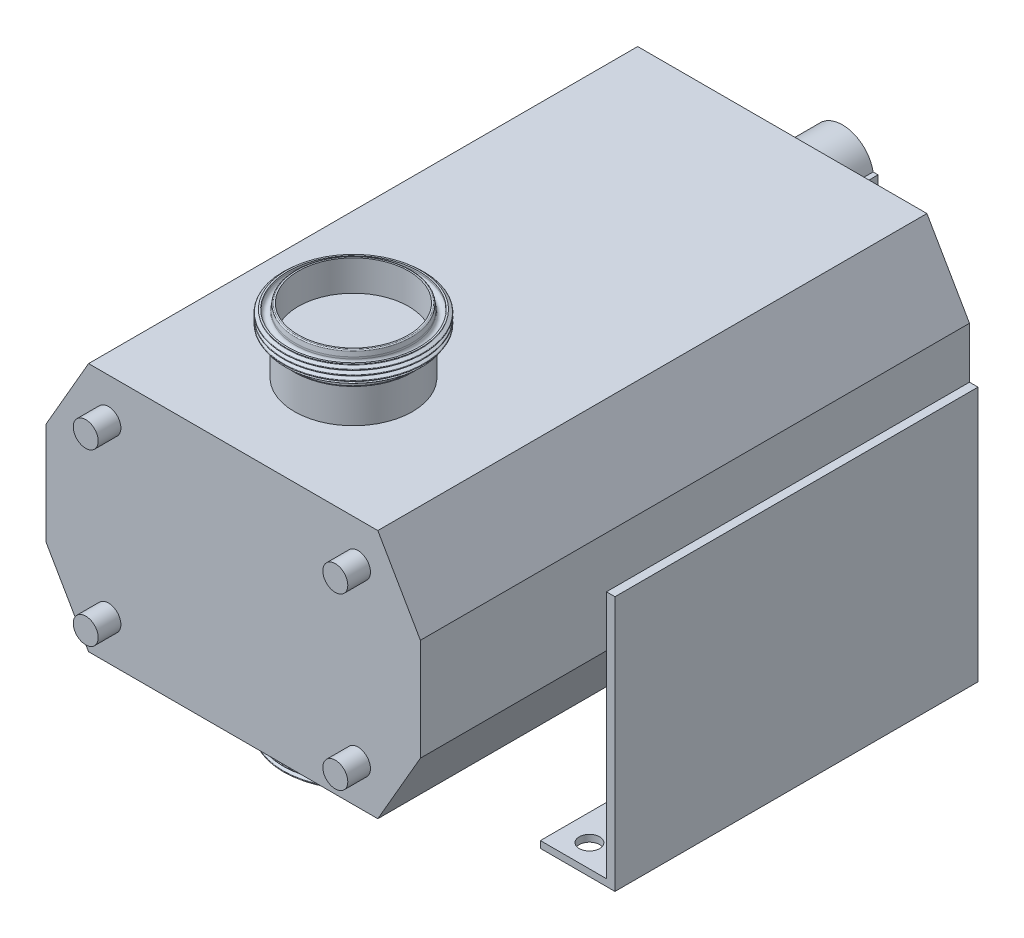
ISO-10303-21;
HEADER;
FILE_DESCRIPTION(('STEP AP214'),'2;1');
FILE_NAME('part.step','',(''),(''),'','','');
FILE_SCHEMA(('AUTOMOTIVE_DESIGN { 1 0 10303 214 1 1 1 1 }'));
ENDSEC;
DATA;
#1=APPLICATION_CONTEXT('core data for automotive mechanical design processes');
#2=APPLICATION_PROTOCOL_DEFINITION('international standard','automotive_design',2000,#1);
#3=PRODUCT_CONTEXT('',#1,'mechanical');
#4=PRODUCT('Part','Part','',(#3));
#5=PRODUCT_RELATED_PRODUCT_CATEGORY('part','',(#4));
#6=PRODUCT_DEFINITION_FORMATION('','',#4);
#7=PRODUCT_DEFINITION_CONTEXT('part definition',#1,'design');
#8=PRODUCT_DEFINITION('design','',#6,#7);
#9=PRODUCT_DEFINITION_SHAPE('','',#8);
#10=(LENGTH_UNIT() NAMED_UNIT(*) SI_UNIT(.MILLI.,.METRE.));
#11=(NAMED_UNIT(*) PLANE_ANGLE_UNIT() SI_UNIT($,.RADIAN.));
#12=(NAMED_UNIT(*) SI_UNIT($,.STERADIAN.) SOLID_ANGLE_UNIT());
#13=UNCERTAINTY_MEASURE_WITH_UNIT(LENGTH_MEASURE(1.E-05),#10,'distance_accuracy_value','');
#14=(GEOMETRIC_REPRESENTATION_CONTEXT(3) GLOBAL_UNCERTAINTY_ASSIGNED_CONTEXT((#13)) GLOBAL_UNIT_ASSIGNED_CONTEXT((#10,
#11,#12)) REPRESENTATION_CONTEXT('',''));
#15=CARTESIAN_POINT('',(0.,0.,0.));
#16=DIRECTION('',(0.,0.,1.));
#17=DIRECTION('',(1.,0.,0.));
#18=AXIS2_PLACEMENT_3D('',#15,#16,#17);
#19=CARTESIAN_POINT('',(-53.8911383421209,162.2,351.623017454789));
#20=DIRECTION('',(0.,1.,0.));
#21=DIRECTION('',(-0.43961637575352,0.,0.89818563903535));
#22=AXIS2_PLACEMENT_3D('',#19,#20,#21);
#23=PLANE('',#22);
#24=CARTESIAN_POINT('',(0.,162.2,378.));
#25=DIRECTION('',(0.,1.,0.));
#26=DIRECTION('',(-0.43961637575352,0.,0.89818563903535));
#27=AXIS2_PLACEMENT_3D('',#24,#25,#26);
#28=CIRCLE('',#27,57.85);
#29=CARTESIAN_POINT('',(-25.4318073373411,162.2,429.960039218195));
#30=VERTEX_POINT('',#29);
#31=EDGE_CURVE('P0_E53',#30,#30,#28,.T.);
#32=ORIENTED_EDGE('',*,*,#31,.F.);
#33=EDGE_LOOP('',(#32));
#34=FACE_BOUND('',#33,.T.);
#35=CARTESIAN_POINT('',(0.,162.2,378.));
#36=DIRECTION('',(0.,1.,0.));
#37=DIRECTION('',(-0.43961637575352,0.,0.89818563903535));
#38=AXIS2_PLACEMENT_3D('',#35,#36,#37);
#39=CIRCLE('',#38,59.2742303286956);
#40=CARTESIAN_POINT('',(-26.0579223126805,162.2,431.239262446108));
#41=VERTEX_POINT('',#40);
#42=EDGE_CURVE('P0_E19',#41,#41,#39,.T.);
#43=ORIENTED_EDGE('',*,*,#42,.T.);
#44=EDGE_LOOP('',(#43));
#45=FACE_BOUND('',#44,.T.);
#46=ADVANCED_FACE('P0_F15',(#34,#45),#23,.T.);
#47=CARTESIAN_POINT('',(0.,150.,378.));
#48=DIRECTION('',(0.,1.,0.));
#49=DIRECTION('',(-0.43961637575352,0.,0.89818563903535));
#50=AXIS2_PLACEMENT_3D('',#47,#48,#49);
#51=CONICAL_SURFACE('',#50,62.,0.785398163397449);
#52=CARTESIAN_POINT('',(0.,148.,378.));
#53=DIRECTION('',(0.,1.,0.));
#54=DIRECTION('',(-0.43961637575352,0.,0.89818563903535));
#55=AXIS2_PLACEMENT_3D('',#52,#53,#54);
#56=CIRCLE('',#55,60.);
#57=CARTESIAN_POINT('',(-26.3769825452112,148.,431.891138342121));
#58=VERTEX_POINT('',#57);
#59=EDGE_CURVE('P0_E50',#58,#58,#56,.T.);
#60=ORIENTED_EDGE('',*,*,#59,.T.);
#61=EDGE_LOOP('',(#60));
#62=FACE_BOUND('',#61,.T.);
#63=CARTESIAN_POINT('',(0.,148.169276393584,378.));
#64=DIRECTION('',(0.,-1.,0.));
#65=DIRECTION('',(0.43961637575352,0.,-0.89818563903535));
#66=AXIS2_PLACEMENT_3D('',#63,#64,#65);
#67=CIRCLE('',#66,60.1692763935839);
#68=CARTESIAN_POINT('',(26.4513992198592,148.169276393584,323.956820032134));
#69=VERTEX_POINT('',#68);
#70=EDGE_CURVE('P0_E31',#69,#69,#67,.T.);
#71=ORIENTED_EDGE('',*,*,#70,.T.);
#72=EDGE_LOOP('',(#71));
#73=FACE_BOUND('',#72,.T.);
#74=ADVANCED_FACE('P0_F95',(#62,#73),#51,.T.);
#75=CARTESIAN_POINT('',(0.,145.5,378.));
#76=DIRECTION('',(0.,1.,0.));
#77=DIRECTION('',(-0.43961637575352,0.,0.89818563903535));
#78=AXIS2_PLACEMENT_3D('',#75,#76,#77);
#79=TOROIDAL_SURFACE('',#78,53.75,2.5);
#80=CARTESIAN_POINT('',(0.,145.5,378.));
#81=DIRECTION('',(0.,1.,0.));
#82=DIRECTION('',(-0.43961637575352,0.,0.89818563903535));
#83=AXIS2_PLACEMENT_3D('',#80,#81,#82);
#84=CIRCLE('',#83,51.25);
#85=CARTESIAN_POINT('',(-22.5303392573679,145.5,424.032014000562));
#86=VERTEX_POINT('',#85);
#87=EDGE_CURVE('P0_E10',#86,#86,#84,.T.);
#88=ORIENTED_EDGE('',*,*,#87,.T.);
#89=EDGE_LOOP('',(#88));
#90=FACE_BOUND('',#89,.T.);
#91=CARTESIAN_POINT('',(0.,148.,378.));
#92=DIRECTION('',(0.,1.,0.));
#93=DIRECTION('',(-0.43961637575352,0.,0.89818563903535));
#94=AXIS2_PLACEMENT_3D('',#91,#92,#93);
#95=CIRCLE('',#94,53.75);
#96=CARTESIAN_POINT('',(-23.6293801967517,148.,426.27747809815));
#97=VERTEX_POINT('',#96);
#98=EDGE_CURVE('P0_E37',#97,#97,#95,.T.);
#99=ORIENTED_EDGE('',*,*,#98,.F.);
#100=EDGE_LOOP('',(#99));
#101=FACE_BOUND('',#100,.T.);
#102=ADVANCED_FACE('P0_F17',(#90,#101),#79,.F.);
#103=CARTESIAN_POINT('',(0.,177.72123015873,378.));
#104=DIRECTION('',(0.,1.,0.));
#105=DIRECTION('',(-0.43961637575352,0.,0.89818563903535));
#106=AXIS2_PLACEMENT_3D('',#103,#104,#105);
#107=CYLINDRICAL_SURFACE('',#106,51.25);
#108=CARTESIAN_POINT('',(0.,140.,378.));
#109=DIRECTION('',(0.,1.,0.));
#110=DIRECTION('',(-0.43961637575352,0.,0.89818563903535));
#111=AXIS2_PLACEMENT_3D('',#108,#109,#110);
#112=CIRCLE('',#111,51.25);
#113=CARTESIAN_POINT('',(-22.5303392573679,140.,424.032014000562));
#114=VERTEX_POINT('',#113);
#115=EDGE_CURVE('P0_E23',#114,#114,#112,.T.);
#116=ORIENTED_EDGE('',*,*,#115,.T.);
#117=EDGE_LOOP('',(#116));
#118=FACE_BOUND('',#117,.T.);
#119=ORIENTED_EDGE('',*,*,#87,.F.);
#120=EDGE_LOOP('',(#119));
#121=FACE_BOUND('',#120,.T.);
#122=ADVANCED_FACE('P0_F92',(#118,#121),#107,.T.);
#123=CARTESIAN_POINT('',(-43.7416406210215,140.,356.590682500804));
#124=DIRECTION('',(0.,-1.,0.));
#125=DIRECTION('',(0.43961637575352,0.,-0.89818563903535));
#126=AXIS2_PLACEMENT_3D('',#123,#124,#125);
#127=PLANE('',#126);
#128=CARTESIAN_POINT('',(0.,140.,378.));
#129=DIRECTION('',(0.,1.,0.));
#130=DIRECTION('',(-0.43961637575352,0.,0.89818563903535));
#131=AXIS2_PLACEMENT_3D('',#128,#129,#130);
#132=CIRCLE('',#131,48.7);
#133=CARTESIAN_POINT('',(-21.4093174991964,140.,421.741640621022));
#134=VERTEX_POINT('',#133);
#135=EDGE_CURVE('P0_E28',#134,#134,#132,.T.);
#136=ORIENTED_EDGE('',*,*,#135,.T.);
#137=EDGE_LOOP('',(#136));
#138=FACE_BOUND('',#137,.T.);
#139=ORIENTED_EDGE('',*,*,#115,.F.);
#140=EDGE_LOOP('',(#139));
#141=FACE_BOUND('',#140,.T.);
#142=ADVANCED_FACE('P0_F76',(#138,#141),#127,.T.);
#143=CARTESIAN_POINT('',(0.,177.72123015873,378.));
#144=DIRECTION('',(0.,1.,0.));
#145=DIRECTION('',(-0.43961637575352,0.,0.89818563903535));
#146=AXIS2_PLACEMENT_3D('',#143,#144,#145);
#147=CYLINDRICAL_SURFACE('',#146,48.7);
#148=CARTESIAN_POINT('',(0.,167.,378.));
#149=DIRECTION('',(0.,1.,0.));
#150=DIRECTION('',(-0.43961637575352,0.,0.89818563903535));
#151=AXIS2_PLACEMENT_3D('',#148,#149,#150);
#152=CIRCLE('',#151,48.7);
#153=CARTESIAN_POINT('',(-21.4093174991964,167.,421.741640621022));
#154=VERTEX_POINT('',#153);
#155=EDGE_CURVE('P0_E71',#154,#154,#152,.T.);
#156=ORIENTED_EDGE('',*,*,#155,.T.);
#157=EDGE_LOOP('',(#156));
#158=FACE_BOUND('',#157,.T.);
#159=ORIENTED_EDGE('',*,*,#135,.F.);
#160=EDGE_LOOP('',(#159));
#161=FACE_BOUND('',#160,.T.);
#162=ADVANCED_FACE('P0_F79',(#158,#161),#147,.F.);
#163=CARTESIAN_POINT('',(-44.8383073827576,167.,356.053919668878));
#164=DIRECTION('',(0.,1.,0.));
#165=DIRECTION('',(-0.43961637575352,0.,0.89818563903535));
#166=AXIS2_PLACEMENT_3D('',#163,#164,#165);
#167=PLANE('',#166);
#168=CARTESIAN_POINT('',(0.,167.,378.));
#169=DIRECTION('',(0.,1.,0.));
#170=DIRECTION('',(-0.43961637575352,0.,0.89818563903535));
#171=AXIS2_PLACEMENT_3D('',#168,#169,#170);
#172=CIRCLE('',#171,49.9209800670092);
#173=CARTESIAN_POINT('',(-21.9460803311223,167.,422.838307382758));
#174=VERTEX_POINT('',#173);
#175=EDGE_CURVE('P0_E68',#174,#174,#172,.T.);
#176=ORIENTED_EDGE('',*,*,#175,.T.);
#177=EDGE_LOOP('',(#176));
#178=FACE_BOUND('',#177,.T.);
#179=ORIENTED_EDGE('',*,*,#155,.F.);
#180=EDGE_LOOP('',(#179));
#181=FACE_BOUND('',#180,.T.);
#182=ADVANCED_FACE('P0_F81',(#178,#181),#167,.T.);
#183=CARTESIAN_POINT('',(0.,166.,378.));
#184=DIRECTION('',(0.,1.,0.));
#185=DIRECTION('',(-0.43961637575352,0.,0.89818563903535));
#186=AXIS2_PLACEMENT_3D('',#183,#184,#185);
#187=TOROIDAL_SURFACE('',#186,49.9209800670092,1.00000000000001);
#188=CARTESIAN_POINT('',(0.,166.14780941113,378.));
#189=DIRECTION('',(0.,1.,0.));
#190=DIRECTION('',(-0.43961637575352,0.,0.89818563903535));
#191=AXIS2_PLACEMENT_3D('',#188,#189,#190);
#192=CIRCLE('',#191,50.9099959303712);
#193=CARTESIAN_POINT('',(-22.3808679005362,166.14780941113,423.726627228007));
#194=VERTEX_POINT('',#193);
#195=EDGE_CURVE('P0_E65',#194,#194,#192,.T.);
#196=ORIENTED_EDGE('',*,*,#195,.T.);
#197=EDGE_LOOP('',(#196));
#198=FACE_BOUND('',#197,.T.);
#199=ORIENTED_EDGE('',*,*,#175,.F.);
#200=EDGE_LOOP('',(#199));
#201=FACE_BOUND('',#200,.T.);
#202=ADVANCED_FACE('P0_F89',(#198,#201),#187,.T.);
#203=CARTESIAN_POINT('',(0.,166.14780941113,378.));
#204=DIRECTION('',(0.,-1.,0.));
#205=DIRECTION('',(0.43961637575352,0.,-0.89818563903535));
#206=AXIS2_PLACEMENT_3D('',#203,#204,#205);
#207=CONICAL_SURFACE('',#206,50.9099959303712,0.148352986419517);
#208=CARTESIAN_POINT('',(0.,162.2,378.));
#209=DIRECTION('',(0.,1.,0.));
#210=DIRECTION('',(-0.43961637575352,0.,0.89818563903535));
#211=AXIS2_PLACEMENT_3D('',#208,#209,#210);
#212=CIRCLE('',#211,51.5);
#213=CARTESIAN_POINT('',(-22.6402433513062,162.2,424.256560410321));
#214=VERTEX_POINT('',#213);
#215=EDGE_CURVE('P0_E62',#214,#214,#212,.T.);
#216=ORIENTED_EDGE('',*,*,#215,.T.);
#217=EDGE_LOOP('',(#216));
#218=FACE_BOUND('',#217,.T.);
#219=ORIENTED_EDGE('',*,*,#195,.F.);
#220=EDGE_LOOP('',(#219));
#221=FACE_BOUND('',#220,.T.);
#222=ADVANCED_FACE('P0_F119',(#218,#221),#207,.T.);
#223=CARTESIAN_POINT('',(0.,177.72123015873,378.));
#224=DIRECTION('',(0.,1.,0.));
#225=DIRECTION('',(-0.43961637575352,0.,0.89818563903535));
#226=AXIS2_PLACEMENT_3D('',#223,#224,#225);
#227=CYLINDRICAL_SURFACE('',#226,51.5);
#228=CARTESIAN_POINT('',(0.,160.6,378.));
#229=DIRECTION('',(0.,1.,0.));
#230=DIRECTION('',(-0.43961637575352,0.,0.89818563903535));
#231=AXIS2_PLACEMENT_3D('',#228,#229,#230);
#232=CIRCLE('',#231,51.5);
#233=CARTESIAN_POINT('',(-22.6402433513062,160.6,424.256560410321));
#234=VERTEX_POINT('',#233);
#235=EDGE_CURVE('P0_E59',#234,#234,#232,.T.);
#236=ORIENTED_EDGE('',*,*,#235,.T.);
#237=EDGE_LOOP('',(#236));
#238=FACE_BOUND('',#237,.T.);
#239=ORIENTED_EDGE('',*,*,#215,.F.);
#240=EDGE_LOOP('',(#239));
#241=FACE_BOUND('',#240,.T.);
#242=ADVANCED_FACE('P0_F115',(#238,#241),#227,.T.);
#243=CARTESIAN_POINT('',(0.,160.6,378.));
#244=DIRECTION('',(0.,1.,0.));
#245=DIRECTION('',(-0.43961637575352,0.,0.89818563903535));
#246=AXIS2_PLACEMENT_3D('',#243,#244,#245);
#247=TOROIDAL_SURFACE('',#246,54.675,3.175);
#248=CARTESIAN_POINT('',(0.,160.6,378.));
#249=DIRECTION('',(0.,1.,0.));
#250=DIRECTION('',(-0.43961637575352,0.,0.89818563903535));
#251=AXIS2_PLACEMENT_3D('',#248,#249,#250);
#252=CIRCLE('',#251,57.85);
#253=CARTESIAN_POINT('',(-25.4318073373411,160.6,429.960039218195));
#254=VERTEX_POINT('',#253);
#255=EDGE_CURVE('P0_E56',#254,#254,#252,.T.);
#256=ORIENTED_EDGE('',*,*,#255,.T.);
#257=EDGE_LOOP('',(#256));
#258=FACE_BOUND('',#257,.T.);
#259=ORIENTED_EDGE('',*,*,#235,.F.);
#260=EDGE_LOOP('',(#259));
#261=FACE_BOUND('',#260,.T.);
#262=ADVANCED_FACE('P0_F111',(#258,#261),#247,.F.);
#263=CARTESIAN_POINT('',(0.,177.72123015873,378.));
#264=DIRECTION('',(0.,1.,0.));
#265=DIRECTION('',(-0.43961637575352,0.,0.89818563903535));
#266=AXIS2_PLACEMENT_3D('',#263,#264,#265);
#267=CYLINDRICAL_SURFACE('',#266,57.85);
#268=ORIENTED_EDGE('',*,*,#31,.T.);
#269=EDGE_LOOP('',(#268));
#270=FACE_BOUND('',#269,.T.);
#271=ORIENTED_EDGE('',*,*,#255,.F.);
#272=EDGE_LOOP('',(#271));
#273=FACE_BOUND('',#272,.T.);
#274=ADVANCED_FACE('P0_F107',(#270,#273),#267,.F.);
#275=CARTESIAN_POINT('',(-48.27747809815,148.,354.370619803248));
#276=DIRECTION('',(0.,-1.,0.));
#277=DIRECTION('',(0.43961637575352,0.,-0.89818563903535));
#278=AXIS2_PLACEMENT_3D('',#275,#276,#277);
#279=PLANE('',#278);
#280=ORIENTED_EDGE('',*,*,#98,.T.);
#281=EDGE_LOOP('',(#280));
#282=FACE_BOUND('',#281,.T.);
#283=ORIENTED_EDGE('',*,*,#59,.F.);
#284=EDGE_LOOP('',(#283));
#285=FACE_BOUND('',#284,.T.);
#286=ADVANCED_FACE('P0_F110',(#282,#285),#279,.T.);
#287=CARTESIAN_POINT('',(0.,159.651,378.));
#288=DIRECTION('',(0.,1.,0.));
#289=DIRECTION('',(-0.43961637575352,0.,0.89818563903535));
#290=AXIS2_PLACEMENT_3D('',#287,#288,#289);
#291=TOROIDAL_SURFACE('',#290,61.564,0.436000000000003);
#292=CARTESIAN_POINT('',(0.,160.037767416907,378.));
#293=DIRECTION('',(0.,1.,0.));
#294=DIRECTION('',(-0.43961637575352,0.,0.89818563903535));
#295=AXIS2_PLACEMENT_3D('',#292,#293,#294);
#296=CIRCLE('',#295,61.7652634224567);
#297=CARTESIAN_POINT('',(-27.1530212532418,160.037767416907,433.476672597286));
#298=VERTEX_POINT('',#297);
#299=EDGE_CURVE('P0_E44',#298,#298,#296,.T.);
#300=ORIENTED_EDGE('',*,*,#299,.F.);
#301=EDGE_LOOP('',(#300));
#302=FACE_BOUND('',#301,.T.);
#303=CARTESIAN_POINT('',(0.,159.264293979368,378.));
#304=DIRECTION('',(0.,1.,0.));
#305=DIRECTION('',(-0.43961637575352,0.,0.89818563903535));
#306=AXIS2_PLACEMENT_3D('',#303,#304,#305);
#307=CIRCLE('',#306,61.7653813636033);
#308=CARTESIAN_POINT('',(-27.1530731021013,159.264293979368,433.47677853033));
#309=VERTEX_POINT('',#308);
#310=EDGE_CURVE('P0_E318',#309,#309,#307,.T.);
#311=ORIENTED_EDGE('',*,*,#310,.T.);
#312=EDGE_LOOP('',(#311));
#313=FACE_BOUND('',#312,.T.);
#314=ADVANCED_FACE('P0_F161',(#302,#313),#291,.T.);
#315=CARTESIAN_POINT('',(0.,155.418,378.));
#316=DIRECTION('',(0.,1.,0.));
#317=DIRECTION('',(-0.43961637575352,0.,0.89818563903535));
#318=AXIS2_PLACEMENT_3D('',#315,#316,#317);
#319=TOROIDAL_SURFACE('',#318,61.564,0.436000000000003);
#320=CARTESIAN_POINT('',(0.,155.804767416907,378.));
#321=DIRECTION('',(0.,1.,0.));
#322=DIRECTION('',(-0.43961637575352,0.,0.89818563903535));
#323=AXIS2_PLACEMENT_3D('',#320,#321,#322);
#324=CIRCLE('',#323,61.7652634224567);
#325=CARTESIAN_POINT('',(-27.1530212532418,155.804767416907,433.476672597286));
#326=VERTEX_POINT('',#325);
#327=EDGE_CURVE('P0_E309',#326,#326,#324,.T.);
#328=ORIENTED_EDGE('',*,*,#327,.F.);
#329=EDGE_LOOP('',(#328));
#330=FACE_BOUND('',#329,.T.);
#331=CARTESIAN_POINT('',(0.,155.031293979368,378.));
#332=DIRECTION('',(0.,1.,0.));
#333=DIRECTION('',(-0.43961637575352,0.,0.89818563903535));
#334=AXIS2_PLACEMENT_3D('',#331,#332,#333);
#335=CIRCLE('',#334,61.7653813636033);
#336=CARTESIAN_POINT('',(-27.1530731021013,155.031293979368,433.47677853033));
#337=VERTEX_POINT('',#336);
#338=EDGE_CURVE('P0_E306',#337,#337,#335,.T.);
#339=ORIENTED_EDGE('',*,*,#338,.T.);
#340=EDGE_LOOP('',(#339));
#341=FACE_BOUND('',#340,.T.);
#342=ADVANCED_FACE('P0_F168',(#330,#341),#319,.T.);
#343=CARTESIAN_POINT('',(0.,151.185,378.));
#344=DIRECTION('',(0.,1.,0.));
#345=DIRECTION('',(-0.43961637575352,0.,0.89818563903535));
#346=AXIS2_PLACEMENT_3D('',#343,#344,#345);
#347=TOROIDAL_SURFACE('',#346,61.564,0.436000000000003);
#348=CARTESIAN_POINT('',(0.,151.571767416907,378.));
#349=DIRECTION('',(0.,1.,0.));
#350=DIRECTION('',(-0.43961637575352,0.,0.89818563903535));
#351=AXIS2_PLACEMENT_3D('',#348,#349,#350);
#352=CIRCLE('',#351,61.7652634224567);
#353=CARTESIAN_POINT('',(-27.1530212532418,151.571767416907,433.476672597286));
#354=VERTEX_POINT('',#353);
#355=EDGE_CURVE('P0_E297',#354,#354,#352,.T.);
#356=ORIENTED_EDGE('',*,*,#355,.F.);
#357=EDGE_LOOP('',(#356));
#358=FACE_BOUND('',#357,.T.);
#359=CARTESIAN_POINT('',(0.,150.798293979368,378.));
#360=DIRECTION('',(0.,1.,0.));
#361=DIRECTION('',(-0.43961637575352,0.,0.89818563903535));
#362=AXIS2_PLACEMENT_3D('',#359,#360,#361);
#363=CIRCLE('',#362,61.7653813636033);
#364=CARTESIAN_POINT('',(-27.1530731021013,150.798293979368,433.47677853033));
#365=VERTEX_POINT('',#364);
#366=EDGE_CURVE('P0_E292',#365,#365,#363,.T.);
#367=ORIENTED_EDGE('',*,*,#366,.T.);
#368=EDGE_LOOP('',(#367));
#369=FACE_BOUND('',#368,.T.);
#370=ADVANCED_FACE('P0_F176',(#358,#369),#347,.T.);
#371=CARTESIAN_POINT('',(0.,163.497293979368,378.));
#372=DIRECTION('',(0.,1.,0.));
#373=DIRECTION('',(-0.43961637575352,0.,0.89818563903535));
#374=AXIS2_PLACEMENT_3D('',#371,#372,#373);
#375=CONICAL_SURFACE('',#374,61.7653813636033,1.0906783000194);
#376=ORIENTED_EDGE('',*,*,#42,.F.);
#377=EDGE_LOOP('',(#376));
#378=FACE_BOUND('',#377,.T.);
#379=CARTESIAN_POINT('',(0.,162.153706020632,378.));
#380=DIRECTION('',(0.,1.,0.));
#381=DIRECTION('',(-0.43961637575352,0.,0.89818563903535));
#382=AXIS2_PLACEMENT_3D('',#379,#380,#381);
#383=CIRCLE('',#382,59.1853335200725);
#384=CARTESIAN_POINT('',(-26.0188418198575,162.153706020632,431.159416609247));
#385=VERTEX_POINT('',#384);
#386=EDGE_CURVE('P0_E33',#385,#385,#383,.T.);
#387=ORIENTED_EDGE('',*,*,#386,.T.);
#388=EDGE_LOOP('',(#387));
#389=FACE_BOUND('',#388,.T.);
#390=ADVANCED_FACE('P0_F184',(#378,#389),#375,.T.);
#391=CARTESIAN_POINT('',(0.,161.767,378.));
#392=DIRECTION('',(0.,1.,0.));
#393=DIRECTION('',(-0.43961637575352,0.,0.89818563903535));
#394=AXIS2_PLACEMENT_3D('',#391,#392,#393);
#395=TOROIDAL_SURFACE('',#394,59.3867148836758,0.435999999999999);
#396=CARTESIAN_POINT('',(0.,161.380232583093,378.));
#397=DIRECTION('',(0.,1.,0.));
#398=DIRECTION('',(-0.43961637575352,0.,0.89818563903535));
#399=AXIS2_PLACEMENT_3D('',#396,#397,#398);
#400=CIRCLE('',#399,59.1854514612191);
#401=CARTESIAN_POINT('',(-26.018893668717,161.380232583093,431.159522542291));
#402=VERTEX_POINT('',#401);
#403=EDGE_CURVE('P0_E39',#402,#402,#400,.T.);
#404=ORIENTED_EDGE('',*,*,#403,.T.);
#405=EDGE_LOOP('',(#404));
#406=FACE_BOUND('',#405,.T.);
#407=ORIENTED_EDGE('',*,*,#386,.F.);
#408=EDGE_LOOP('',(#407));
#409=FACE_BOUND('',#408,.T.);
#410=ADVANCED_FACE('P0_F192',(#406,#409),#395,.F.);
#411=CARTESIAN_POINT('',(0.,161.380232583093,378.));
#412=DIRECTION('',(0.,-1.,0.));
#413=DIRECTION('',(0.43961637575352,0.,-0.89818563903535));
#414=AXIS2_PLACEMENT_3D('',#411,#412,#413);
#415=CONICAL_SURFACE('',#414,59.1854514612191,1.09098326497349);
#416=ORIENTED_EDGE('',*,*,#299,.T.);
#417=EDGE_LOOP('',(#416));
#418=FACE_BOUND('',#417,.T.);
#419=ORIENTED_EDGE('',*,*,#403,.F.);
#420=EDGE_LOOP('',(#419));
#421=FACE_BOUND('',#420,.T.);
#422=ADVANCED_FACE('P0_F200',(#418,#421),#415,.T.);
#423=CARTESIAN_POINT('',(0.,159.264293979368,378.));
#424=DIRECTION('',(0.,1.,0.));
#425=DIRECTION('',(-0.43961637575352,0.,0.89818563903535));
#426=AXIS2_PLACEMENT_3D('',#423,#424,#425);
#427=CONICAL_SURFACE('',#426,61.7653813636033,1.0906783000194);
#428=CARTESIAN_POINT('',(0.,157.920706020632,378.));
#429=DIRECTION('',(0.,1.,0.));
#430=DIRECTION('',(-0.43961637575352,0.,0.89818563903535));
#431=AXIS2_PLACEMENT_3D('',#428,#429,#430);
#432=CIRCLE('',#431,59.1853335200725);
#433=CARTESIAN_POINT('',(-26.0188418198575,157.920706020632,431.159416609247));
#434=VERTEX_POINT('',#433);
#435=EDGE_CURVE('P0_E315',#434,#434,#432,.T.);
#436=ORIENTED_EDGE('',*,*,#435,.T.);
#437=EDGE_LOOP('',(#436));
#438=FACE_BOUND('',#437,.T.);
#439=ORIENTED_EDGE('',*,*,#310,.F.);
#440=EDGE_LOOP('',(#439));
#441=FACE_BOUND('',#440,.T.);
#442=ADVANCED_FACE('P0_F208',(#438,#441),#427,.T.);
#443=CARTESIAN_POINT('',(0.,157.534,378.));
#444=DIRECTION('',(0.,1.,0.));
#445=DIRECTION('',(-0.43961637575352,0.,0.89818563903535));
#446=AXIS2_PLACEMENT_3D('',#443,#444,#445);
#447=TOROIDAL_SURFACE('',#446,59.3867148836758,0.435999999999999);
#448=CARTESIAN_POINT('',(0.,157.147232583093,378.));
#449=DIRECTION('',(0.,1.,0.));
#450=DIRECTION('',(-0.43961637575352,0.,0.89818563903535));
#451=AXIS2_PLACEMENT_3D('',#448,#449,#450);
#452=CIRCLE('',#451,59.1854514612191);
#453=CARTESIAN_POINT('',(-26.018893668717,157.147232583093,431.159522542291));
#454=VERTEX_POINT('',#453);
#455=EDGE_CURVE('P0_E312',#454,#454,#452,.T.);
#456=ORIENTED_EDGE('',*,*,#455,.T.);
#457=EDGE_LOOP('',(#456));
#458=FACE_BOUND('',#457,.T.);
#459=ORIENTED_EDGE('',*,*,#435,.F.);
#460=EDGE_LOOP('',(#459));
#461=FACE_BOUND('',#460,.T.);
#462=ADVANCED_FACE('P0_F216',(#458,#461),#447,.F.);
#463=CARTESIAN_POINT('',(0.,157.147232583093,378.));
#464=DIRECTION('',(0.,-1.,0.));
#465=DIRECTION('',(0.43961637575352,0.,-0.89818563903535));
#466=AXIS2_PLACEMENT_3D('',#463,#464,#465);
#467=CONICAL_SURFACE('',#466,59.1854514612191,1.09098326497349);
#468=ORIENTED_EDGE('',*,*,#327,.T.);
#469=EDGE_LOOP('',(#468));
#470=FACE_BOUND('',#469,.T.);
#471=ORIENTED_EDGE('',*,*,#455,.F.);
#472=EDGE_LOOP('',(#471));
#473=FACE_BOUND('',#472,.T.);
#474=ADVANCED_FACE('P0_F224',(#470,#473),#467,.T.);
#475=CARTESIAN_POINT('',(0.,155.031293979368,378.));
#476=DIRECTION('',(0.,1.,0.));
#477=DIRECTION('',(-0.43961637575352,0.,0.89818563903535));
#478=AXIS2_PLACEMENT_3D('',#475,#476,#477);
#479=CONICAL_SURFACE('',#478,61.7653813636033,1.09067830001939);
#480=CARTESIAN_POINT('',(0.,153.687706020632,378.));
#481=DIRECTION('',(0.,1.,0.));
#482=DIRECTION('',(-0.43961637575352,0.,0.89818563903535));
#483=AXIS2_PLACEMENT_3D('',#480,#481,#482);
#484=CIRCLE('',#483,59.1853335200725);
#485=CARTESIAN_POINT('',(-26.0188418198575,153.687706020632,431.159416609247));
#486=VERTEX_POINT('',#485);
#487=EDGE_CURVE('P0_E303',#486,#486,#484,.T.);
#488=ORIENTED_EDGE('',*,*,#487,.T.);
#489=EDGE_LOOP('',(#488));
#490=FACE_BOUND('',#489,.T.);
#491=ORIENTED_EDGE('',*,*,#338,.F.);
#492=EDGE_LOOP('',(#491));
#493=FACE_BOUND('',#492,.T.);
#494=ADVANCED_FACE('P0_F232',(#490,#493),#479,.T.);
#495=CARTESIAN_POINT('',(0.,153.301,378.));
#496=DIRECTION('',(0.,1.,0.));
#497=DIRECTION('',(-0.43961637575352,0.,0.89818563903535));
#498=AXIS2_PLACEMENT_3D('',#495,#496,#497);
#499=TOROIDAL_SURFACE('',#498,59.3867148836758,0.435999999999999);
#500=CARTESIAN_POINT('',(0.,152.914232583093,378.));
#501=DIRECTION('',(0.,1.,0.));
#502=DIRECTION('',(-0.43961637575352,0.,0.89818563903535));
#503=AXIS2_PLACEMENT_3D('',#500,#501,#502);
#504=CIRCLE('',#503,59.1854514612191);
#505=CARTESIAN_POINT('',(-26.018893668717,152.914232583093,431.159522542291));
#506=VERTEX_POINT('',#505);
#507=EDGE_CURVE('P0_E300',#506,#506,#504,.T.);
#508=ORIENTED_EDGE('',*,*,#507,.T.);
#509=EDGE_LOOP('',(#508));
#510=FACE_BOUND('',#509,.T.);
#511=ORIENTED_EDGE('',*,*,#487,.F.);
#512=EDGE_LOOP('',(#511));
#513=FACE_BOUND('',#512,.T.);
#514=ADVANCED_FACE('P0_F240',(#510,#513),#499,.F.);
#515=CARTESIAN_POINT('',(0.,152.914232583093,378.));
#516=DIRECTION('',(0.,-1.,0.));
#517=DIRECTION('',(0.43961637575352,0.,-0.89818563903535));
#518=AXIS2_PLACEMENT_3D('',#515,#516,#517);
#519=CONICAL_SURFACE('',#518,59.1854514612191,1.09098326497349);
#520=ORIENTED_EDGE('',*,*,#355,.T.);
#521=EDGE_LOOP('',(#520));
#522=FACE_BOUND('',#521,.T.);
#523=ORIENTED_EDGE('',*,*,#507,.F.);
#524=EDGE_LOOP('',(#523));
#525=FACE_BOUND('',#524,.T.);
#526=ADVANCED_FACE('P0_F248',(#522,#525),#519,.T.);
#527=CARTESIAN_POINT('',(0.,150.798293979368,378.));
#528=DIRECTION('',(0.,1.,0.));
#529=DIRECTION('',(-0.43961637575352,0.,0.89818563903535));
#530=AXIS2_PLACEMENT_3D('',#527,#528,#529);
#531=CONICAL_SURFACE('',#530,61.7653813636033,1.0906783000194);
#532=CARTESIAN_POINT('',(0.,149.454706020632,378.));
#533=DIRECTION('',(0.,1.,0.));
#534=DIRECTION('',(-0.43961637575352,0.,0.89818563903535));
#535=AXIS2_PLACEMENT_3D('',#532,#533,#534);
#536=CIRCLE('',#535,59.1853335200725);
#537=CARTESIAN_POINT('',(-26.0188418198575,149.454706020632,431.159416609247));
#538=VERTEX_POINT('',#537);
#539=EDGE_CURVE('P0_E289',#538,#538,#536,.T.);
#540=ORIENTED_EDGE('',*,*,#539,.T.);
#541=EDGE_LOOP('',(#540));
#542=FACE_BOUND('',#541,.T.);
#543=ORIENTED_EDGE('',*,*,#366,.F.);
#544=EDGE_LOOP('',(#543));
#545=FACE_BOUND('',#544,.T.);
#546=ADVANCED_FACE('P0_F256',(#542,#545),#531,.T.);
#547=CARTESIAN_POINT('',(0.,149.068,378.));
#548=DIRECTION('',(0.,1.,0.));
#549=DIRECTION('',(-0.43961637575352,0.,0.89818563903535));
#550=AXIS2_PLACEMENT_3D('',#547,#548,#549);
#551=TOROIDAL_SURFACE('',#550,59.3867148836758,0.435999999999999);
#552=CARTESIAN_POINT('',(0.,148.681232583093,378.));
#553=DIRECTION('',(0.,1.,0.));
#554=DIRECTION('',(-0.43961637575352,0.,0.89818563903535));
#555=AXIS2_PLACEMENT_3D('',#552,#553,#554);
#556=CIRCLE('',#555,59.1854514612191);
#557=CARTESIAN_POINT('',(-26.018893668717,148.681232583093,431.159522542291));
#558=VERTEX_POINT('',#557);
#559=EDGE_CURVE('P0_E288',#558,#558,#556,.T.);
#560=ORIENTED_EDGE('',*,*,#559,.T.);
#561=EDGE_LOOP('',(#560));
#562=FACE_BOUND('',#561,.T.);
#563=ORIENTED_EDGE('',*,*,#539,.F.);
#564=EDGE_LOOP('',(#563));
#565=FACE_BOUND('',#564,.T.);
#566=ADVANCED_FACE('P0_F264',(#562,#565),#551,.F.);
#567=CARTESIAN_POINT('',(0.,148.681232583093,378.));
#568=DIRECTION('',(0.,-1.,0.));
#569=DIRECTION('',(0.43961637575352,0.,-0.89818563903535));
#570=AXIS2_PLACEMENT_3D('',#567,#568,#569);
#571=CONICAL_SURFACE('',#570,59.1854514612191,1.09098326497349);
#572=ORIENTED_EDGE('',*,*,#70,.F.);
#573=EDGE_LOOP('',(#572));
#574=FACE_BOUND('',#573,.T.);
#575=ORIENTED_EDGE('',*,*,#559,.F.);
#576=EDGE_LOOP('',(#575));
#577=FACE_BOUND('',#576,.T.);
#578=ADVANCED_FACE('P0_F272',(#574,#577),#571,.T.);
#579=CLOSED_SHELL('',(#46,#74,#102,#122,#142,#162,#182,#202,#222,#242,#262,#274,#286,#314,#342,
#370,#390,#410,#422,#442,#462,#474,#494,#514,#526,#546,#566,#578));
#580=MANIFOLD_SOLID_BREP('P0_B1',#579);
#581=CARTESIAN_POINT('',(-106.773910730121,-225.,320.));
#582=DIRECTION('',(0.,1.,0.));
#583=DIRECTION('',(0.,0.,1.));
#584=AXIS2_PLACEMENT_3D('',#581,#582,#583);
#585=PLANE('',#584);
#586=CARTESIAN_POINT('',(-130.,-225.,300.));
#587=DIRECTION('',(0.,1.,0.));
#588=DIRECTION('',(0.,0.,-1.));
#589=AXIS2_PLACEMENT_3D('',#586,#587,#588);
#590=CIRCLE('',#589,9.00000000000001);
#591=CARTESIAN_POINT('',(-130.,-225.,291.));
#592=VERTEX_POINT('',#591);
#593=EDGE_CURVE('P1_E575',#592,#592,#590,.T.);
#594=ORIENTED_EDGE('',*,*,#593,.T.);
#595=EDGE_LOOP('',(#594));
#596=FACE_BOUND('',#595,.T.);
#597=DIRECTION('',(1.,0.,0.));
#598=VECTOR('',#597,1.);
#599=CARTESIAN_POINT('',(-106.773910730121,-225.,0.));
#600=LINE('',#599,#598);
#601=CARTESIAN_POINT('',(-172.5,-225.,0.));
#602=VERTEX_POINT('',#601);
#603=CARTESIAN_POINT('',(-106.773910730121,-225.,0.));
#604=VERTEX_POINT('',#603);
#605=EDGE_CURVE('P1_E586',#602,#604,#600,.T.);
#606=ORIENTED_EDGE('',*,*,#605,.T.);
#607=DIRECTION('',(0.,0.,-1.));
#608=VECTOR('',#607,1.);
#609=CARTESIAN_POINT('',(-106.773910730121,-225.,320.));
#610=LINE('',#609,#608);
#611=CARTESIAN_POINT('',(-106.773910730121,-225.,320.));
#612=VERTEX_POINT('',#611);
#613=EDGE_CURVE('P1_E593',#612,#604,#610,.T.);
#614=ORIENTED_EDGE('',*,*,#613,.F.);
#615=DIRECTION('',(1.,0.,0.));
#616=VECTOR('',#615,1.);
#617=CARTESIAN_POINT('',(-106.773910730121,-225.,320.));
#618=LINE('',#617,#616);
#619=CARTESIAN_POINT('',(-172.5,-225.,320.));
#620=VERTEX_POINT('',#619);
#621=EDGE_CURVE('P1_E217',#620,#612,#618,.T.);
#622=ORIENTED_EDGE('',*,*,#621,.F.);
#623=DIRECTION('',(0.,0.,-1.));
#624=VECTOR('',#623,1.);
#625=CARTESIAN_POINT('',(-172.5,-225.,320.));
#626=LINE('',#625,#624);
#627=EDGE_CURVE('P1_E590',#620,#602,#626,.T.);
#628=ORIENTED_EDGE('',*,*,#627,.T.);
#629=EDGE_LOOP('',(#606,#614,#622,#628));
#630=FACE_BOUND('',#629,.T.);
#631=CARTESIAN_POINT('',(-130.,-225.,20.));
#632=DIRECTION('',(0.,1.,0.));
#633=DIRECTION('',(0.,0.,-1.));
#634=AXIS2_PLACEMENT_3D('',#631,#632,#633);
#635=CIRCLE('',#634,9.00000000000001);
#636=CARTESIAN_POINT('',(-130.,-225.,11.));
#637=VERTEX_POINT('',#636);
#638=EDGE_CURVE('P1_E883',#637,#637,#635,.T.);
#639=ORIENTED_EDGE('',*,*,#638,.T.);
#640=EDGE_LOOP('',(#639));
#641=FACE_BOUND('',#640,.T.);
#642=ADVANCED_FACE('P1_F17',(#596,#630,#641),#585,.F.);
#643=CARTESIAN_POINT('',(-165.,-219.,320.));
#644=DIRECTION('',(0.,-1.,0.));
#645=DIRECTION('',(0.,0.,-1.));
#646=AXIS2_PLACEMENT_3D('',#643,#644,#645);
#647=PLANE('',#646);
#648=CARTESIAN_POINT('',(-130.,-219.,300.));
#649=DIRECTION('',(0.,-1.,0.));
#650=DIRECTION('',(0.,0.,-1.));
#651=AXIS2_PLACEMENT_3D('',#648,#649,#650);
#652=CIRCLE('',#651,9.00000000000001);
#653=CARTESIAN_POINT('',(-130.,-219.,291.));
#654=VERTEX_POINT('',#653);
#655=EDGE_CURVE('P1_E579',#654,#654,#652,.T.);
#656=ORIENTED_EDGE('',*,*,#655,.T.);
#657=EDGE_LOOP('',(#656));
#658=FACE_BOUND('',#657,.T.);
#659=DIRECTION('',(-1.,0.,0.));
#660=VECTOR('',#659,1.);
#661=CARTESIAN_POINT('',(-165.,-219.,0.));
#662=LINE('',#661,#660);
#663=CARTESIAN_POINT('',(-106.773910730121,-219.,0.));
#664=VERTEX_POINT('',#663);
#665=CARTESIAN_POINT('',(-165.,-219.,0.));
#666=VERTEX_POINT('',#665);
#667=EDGE_CURVE('P1_E577',#664,#666,#662,.T.);
#668=ORIENTED_EDGE('',*,*,#667,.T.);
#669=DIRECTION('',(0.,0.,-1.));
#670=VECTOR('',#669,1.);
#671=CARTESIAN_POINT('',(-165.,-219.,320.));
#672=LINE('',#671,#670);
#673=CARTESIAN_POINT('',(-165.,-219.,320.));
#674=VERTEX_POINT('',#673);
#675=EDGE_CURVE('P1_E211',#674,#666,#672,.T.);
#676=ORIENTED_EDGE('',*,*,#675,.F.);
#677=DIRECTION('',(-1.,0.,0.));
#678=VECTOR('',#677,1.);
#679=CARTESIAN_POINT('',(-165.,-219.,320.));
#680=LINE('',#679,#678);
#681=CARTESIAN_POINT('',(-106.773910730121,-219.,320.));
#682=VERTEX_POINT('',#681);
#683=EDGE_CURVE('P1_E602',#682,#674,#680,.T.);
#684=ORIENTED_EDGE('',*,*,#683,.F.);
#685=DIRECTION('',(0.,0.,-1.));
#686=VECTOR('',#685,1.);
#687=CARTESIAN_POINT('',(-106.773910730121,-219.,320.));
#688=LINE('',#687,#686);
#689=EDGE_CURVE('P1_E215',#682,#664,#688,.T.);
#690=ORIENTED_EDGE('',*,*,#689,.T.);
#691=EDGE_LOOP('',(#668,#676,#684,#690));
#692=FACE_BOUND('',#691,.T.);
#693=CARTESIAN_POINT('',(-130.,-219.,20.));
#694=DIRECTION('',(0.,-1.,0.));
#695=DIRECTION('',(0.,0.,-1.));
#696=AXIS2_PLACEMENT_3D('',#693,#694,#695);
#697=CIRCLE('',#696,9.00000000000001);
#698=CARTESIAN_POINT('',(-130.,-219.,11.));
#699=VERTEX_POINT('',#698);
#700=EDGE_CURVE('P1_E886',#699,#699,#697,.T.);
#701=ORIENTED_EDGE('',*,*,#700,.T.);
#702=EDGE_LOOP('',(#701));
#703=FACE_BOUND('',#702,.T.);
#704=ADVANCED_FACE('P1_F455',(#658,#692,#703),#647,.F.);
#705=CARTESIAN_POINT('',(-165.,45.,484.));
#706=DIRECTION('',(1.,0.,0.));
#707=DIRECTION('',(0.,0.,-1.));
#708=AXIS2_PLACEMENT_3D('',#705,#706,#707);
#709=PLANE('',#708);
#710=DIRECTION('',(0.,0.,-1.));
#711=VECTOR('',#710,1.);
#712=CARTESIAN_POINT('',(-165.,0.,320.));
#713=LINE('',#712,#711);
#714=CARTESIAN_POINT('',(-165.,0.,320.));
#715=VERTEX_POINT('',#714);
#716=CARTESIAN_POINT('',(-165.,0.,0.));
#717=VERTEX_POINT('',#716);
#718=EDGE_CURVE('P1_E200',#715,#717,#713,.T.);
#719=ORIENTED_EDGE('',*,*,#718,.F.);
#720=DIRECTION('',(0.,1.,0.));
#721=VECTOR('',#720,1.);
#722=CARTESIAN_POINT('',(-165.,0.,320.));
#723=LINE('',#722,#721);
#724=CARTESIAN_POINT('',(-165.,-44.9999999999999,320.));
#725=VERTEX_POINT('',#724);
#726=EDGE_CURVE('P1_E185',#725,#715,#723,.T.);
#727=ORIENTED_EDGE('',*,*,#726,.F.);
#728=DIRECTION('',(0.,0.,-1.));
#729=VECTOR('',#728,1.);
#730=CARTESIAN_POINT('',(-165.,-45.,484.));
#731=LINE('',#730,#729);
#732=CARTESIAN_POINT('',(-165.,-45.,484.));
#733=VERTEX_POINT('',#732);
#734=EDGE_CURVE('P1_E395',#733,#725,#731,.T.);
#735=ORIENTED_EDGE('',*,*,#734,.F.);
#736=DIRECTION('',(0.,-1.,0.));
#737=VECTOR('',#736,1.);
#738=CARTESIAN_POINT('',(-165.,45.,484.));
#739=LINE('',#738,#737);
#740=CARTESIAN_POINT('',(-165.,45.,484.));
#741=VERTEX_POINT('',#740);
#742=EDGE_CURVE('P1_E359',#741,#733,#739,.T.);
#743=ORIENTED_EDGE('',*,*,#742,.F.);
#744=DIRECTION('',(0.,0.,-1.));
#745=VECTOR('',#744,1.);
#746=CARTESIAN_POINT('',(-165.,45.,484.));
#747=LINE('',#746,#745);
#748=CARTESIAN_POINT('',(-165.,45.,0.));
#749=VERTEX_POINT('',#748);
#750=EDGE_CURVE('P1_E397',#741,#749,#747,.T.);
#751=ORIENTED_EDGE('',*,*,#750,.T.);
#752=DIRECTION('',(0.,-1.,0.));
#753=VECTOR('',#752,1.);
#754=CARTESIAN_POINT('',(-165.,45.,0.));
#755=LINE('',#754,#753);
#756=EDGE_CURVE('P1_E210',#749,#717,#755,.T.);
#757=ORIENTED_EDGE('',*,*,#756,.T.);
#758=EDGE_LOOP('',(#719,#727,#735,#743,#751,#757));
#759=FACE_BOUND('',#758,.T.);
#760=ADVANCED_FACE('P1_F207',(#759),#709,.F.);
#761=CARTESIAN_POINT('',(-60.,0.,241.732657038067));
#762=DIRECTION('',(0.,0.,1.));
#763=DIRECTION('',(1.,0.,0.));
#764=AXIS2_PLACEMENT_3D('',#761,#762,#763);
#765=CYLINDRICAL_SURFACE('',#764,27.5);
#766=CARTESIAN_POINT('',(-60.,0.,-3.));
#767=DIRECTION('',(0.,0.,1.));
#768=DIRECTION('',(1.,0.,0.));
#769=AXIS2_PLACEMENT_3D('',#766,#767,#768);
#770=CIRCLE('',#769,27.5);
#771=CARTESIAN_POINT('',(-32.5,0.,-3.));
#772=VERTEX_POINT('',#771);
#773=EDGE_CURVE('P1_E320',#772,#772,#770,.T.);
#774=ORIENTED_EDGE('',*,*,#773,.F.);
#775=EDGE_LOOP('',(#774));
#776=FACE_BOUND('',#775,.T.);
#777=DIRECTION('',(0.,0.,1.));
#778=VECTOR('',#777,1.);
#779=CARTESIAN_POINT('',(-32.9583654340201,4.99999999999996,241.732657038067));
#780=LINE('',#779,#778);
#781=CARTESIAN_POINT('',(-32.9583654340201,5.00000000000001,-113.));
#782=VERTEX_POINT('',#781);
#783=CARTESIAN_POINT('',(-32.9583654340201,5.,-63.));
#784=VERTEX_POINT('',#783);
#785=EDGE_CURVE('P1_E305',#782,#784,#780,.T.);
#786=ORIENTED_EDGE('',*,*,#785,.F.);
#787=CARTESIAN_POINT('',(-60.,0.,-113.));
#788=DIRECTION('',(0.,0.,1.));
#789=DIRECTION('',(1.,0.,0.));
#790=AXIS2_PLACEMENT_3D('',#787,#788,#789);
#791=CIRCLE('',#790,27.5);
#792=CARTESIAN_POINT('',(-32.9583654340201,-4.99999999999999,-113.));
#793=VERTEX_POINT('',#792);
#794=EDGE_CURVE('P1_E318',#782,#793,#791,.T.);
#795=ORIENTED_EDGE('',*,*,#794,.T.);
#796=DIRECTION('',(0.,0.,1.));
#797=VECTOR('',#796,1.);
#798=CARTESIAN_POINT('',(-32.9583654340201,-5.00000000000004,241.732657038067));
#799=LINE('',#798,#797);
#800=CARTESIAN_POINT('',(-32.9583654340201,-5.00000000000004,-62.9999999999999));
#801=VERTEX_POINT('',#800);
#802=EDGE_CURVE('P1_E302',#801,#793,#799,.F.);
#803=ORIENTED_EDGE('',*,*,#802,.F.);
#804=CARTESIAN_POINT('',(-32.5,0.,-68.));
#805=CARTESIAN_POINT('',(-32.4999988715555,0.139243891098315,-68.0000024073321));
#806=CARTESIAN_POINT('',(-32.5010594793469,0.278456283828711,-67.9941816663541));
#807=CARTESIAN_POINT('',(-32.5052698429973,0.555920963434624,-67.9709482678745));
#808=CARTESIAN_POINT('',(-32.5084199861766,0.69417306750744,-67.9535334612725));
#809=CARTESIAN_POINT('',(-32.5167252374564,0.968758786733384,-67.9072300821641));
#810=CARTESIAN_POINT('',(-32.5218815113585,1.10509123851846,-67.8783348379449));
#811=CARTESIAN_POINT('',(-32.5340566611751,1.37484220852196,-67.809282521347));
#812=CARTESIAN_POINT('',(-32.5410762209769,1.50825963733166,-67.7691213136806));
#813=CARTESIAN_POINT('',(-32.5567718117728,1.77102525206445,-67.6779041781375));
#814=CARTESIAN_POINT('',(-32.5654457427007,1.90037835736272,-67.6268620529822));
#815=CARTESIAN_POINT('',(-32.5842196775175,2.15434684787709,-67.5142102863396));
#816=CARTESIAN_POINT('',(-32.5943202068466,2.27896046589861,-67.4525967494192));
#817=CARTESIAN_POINT('',(-32.6156621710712,2.52249441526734,-67.3192919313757));
#818=CARTESIAN_POINT('',(-32.6269030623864,2.64141741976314,-67.2476054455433));
#819=CARTESIAN_POINT('',(-32.6502265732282,2.87287846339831,-67.0946089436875));
#820=CARTESIAN_POINT('',(-32.6623095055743,2.98541410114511,-67.0132953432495));
#821=CARTESIAN_POINT('',(-32.6871037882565,3.20436568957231,-66.8407881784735));
#822=CARTESIAN_POINT('',(-32.6998201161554,3.31071129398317,-66.7495060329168));
#823=CARTESIAN_POINT('',(-32.7254213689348,3.51539543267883,-66.5583162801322));
#824=CARTESIAN_POINT('',(-32.7383063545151,3.61373098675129,-66.458405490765));
#825=CARTESIAN_POINT('',(-32.7638763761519,3.80165254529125,-66.2506992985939));
#826=CARTESIAN_POINT('',(-32.7765614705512,3.89124114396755,-66.1429062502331));
#827=CARTESIAN_POINT('',(-32.8013837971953,4.06111440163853,-65.9200997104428));
#828=CARTESIAN_POINT('',(-32.8135208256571,4.14139561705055,-65.8050835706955));
#829=CARTESIAN_POINT('',(-32.8369804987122,4.29258292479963,-65.5678120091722));
#830=CARTESIAN_POINT('',(-32.8482967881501,4.36341882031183,-65.4455112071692));
#831=CARTESIAN_POINT('',(-32.869695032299,4.4945486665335,-65.1952227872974));
#832=CARTESIAN_POINT('',(-32.8797765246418,4.55483867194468,-65.0672330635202));
#833=CARTESIAN_POINT('',(-32.8983991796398,4.66436791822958,-64.8065544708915));
#834=CARTESIAN_POINT('',(-32.9069410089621,4.71361194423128,-64.6738676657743));
#835=CARTESIAN_POINT('',(-32.922240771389,4.8007169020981,-64.4046947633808));
#836=CARTESIAN_POINT('',(-32.9289980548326,4.83857368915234,-64.2682073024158));
#837=CARTESIAN_POINT('',(-32.9461329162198,4.93382551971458,-63.8576226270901));
#838=CARTESIAN_POINT('',(-32.9536068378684,4.97422708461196,-63.579236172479));
#839=CARTESIAN_POINT('',(-32.9598077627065,5.00782079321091,-63.0196963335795));
#840=CARTESIAN_POINT('',(-32.9585355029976,5.00101691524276,-62.7385431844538));
#841=CARTESIAN_POINT('',(-32.9474824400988,4.94086952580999,-62.1849314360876));
#842=CARTESIAN_POINT('',(-32.9378069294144,4.88810191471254,-61.9124083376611));
#843=CARTESIAN_POINT('',(-32.9111987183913,4.73841411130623,-61.3801594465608));
#844=CARTESIAN_POINT('',(-32.8942657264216,4.64149214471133,-61.120434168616));
#845=CARTESIAN_POINT('',(-32.854940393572,4.40568216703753,-60.619443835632));
#846=CARTESIAN_POINT('',(-32.8325176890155,4.2665596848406,-60.3782916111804));
#847=CARTESIAN_POINT('',(-32.7847594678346,3.95046265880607,-59.9225379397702));
#848=CARTESIAN_POINT('',(-32.7594236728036,3.7734844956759,-59.7079390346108));
#849=CARTESIAN_POINT('',(-32.7082339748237,3.38358496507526,-59.3080525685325));
#850=CARTESIAN_POINT('',(-32.6823779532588,3.17017042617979,-59.1232457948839));
#851=CARTESIAN_POINT('',(-32.6334062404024,2.71511135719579,-58.7919871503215));
#852=CARTESIAN_POINT('',(-32.6102905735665,2.4734665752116,-58.6455356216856));
#853=CARTESIAN_POINT('',(-32.5693615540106,1.96831899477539,-58.3950815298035));
#854=CARTESIAN_POINT('',(-32.5515541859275,1.70479195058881,-58.2911268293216));
#855=CARTESIAN_POINT('',(-32.5232948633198,1.16362103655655,-58.1290920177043));
#856=CARTESIAN_POINT('',(-32.5128421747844,0.885978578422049,-58.0710073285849));
#857=CARTESIAN_POINT('',(-32.5005701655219,0.3285966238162,-58.0030255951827));
#858=CARTESIAN_POINT('',(-32.4986327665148,0.048940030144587,-57.9924694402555));
#859=CARTESIAN_POINT('',(-32.5032842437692,-0.508143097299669,-58.018079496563));
#860=CARTESIAN_POINT('',(-32.5098727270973,-0.78556973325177,-58.0542435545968));
#861=CARTESIAN_POINT('',(-32.5307622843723,-1.32824274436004,-58.1717193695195));
#862=CARTESIAN_POINT('',(-32.5450067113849,-1.59356324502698,-58.2526996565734));
#863=CARTESIAN_POINT('',(-32.5796176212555,-2.10686178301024,-58.4571520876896));
#864=CARTESIAN_POINT('',(-32.5999845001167,-2.35483869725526,-58.5806269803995));
#865=CARTESIAN_POINT('',(-32.644875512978,-2.82923812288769,-58.8680365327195));
#866=CARTESIAN_POINT('',(-32.6694404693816,-3.05541114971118,-59.0323764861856));
#867=CARTESIAN_POINT('',(-32.7198927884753,-3.47720532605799,-59.3963011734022));
#868=CARTESIAN_POINT('',(-32.7457802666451,-3.67282380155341,-59.5958889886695));
#869=CARTESIAN_POINT('',(-32.796349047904,-4.03044352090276,-60.0276163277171));
#870=CARTESIAN_POINT('',(-32.8210113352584,-4.19199619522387,-60.2601299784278));
#871=CARTESIAN_POINT('',(-32.8659621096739,-4.47374938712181,-60.7493937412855));
#872=CARTESIAN_POINT('',(-32.8862507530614,-4.59395138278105,-61.0061429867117));
#873=CARTESIAN_POINT('',(-32.9200118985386,-4.78894965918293,-61.5353646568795));
#874=CARTESIAN_POINT('',(-32.933515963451,-4.86395652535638,-61.80775757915));
#875=CARTESIAN_POINT('',(-32.9522449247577,-4.96707217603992,-62.3617029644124));
#876=CARTESIAN_POINT('',(-32.9574706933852,-4.99518590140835,-62.6432544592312));
#877=CARTESIAN_POINT('',(-32.9586508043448,-5.00153102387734,-63.0637361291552));
#878=CARTESIAN_POINT('',(-32.9579621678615,-4.99782447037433,-63.2026140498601));
#879=CARTESIAN_POINT('',(-32.9544668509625,-4.97888166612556,-63.4795403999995));
#880=CARTESIAN_POINT('',(-32.9516609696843,-4.96364976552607,-63.6175891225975));
#881=CARTESIAN_POINT('',(-32.9440080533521,-4.92176219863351,-63.8919241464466));
#882=CARTESIAN_POINT('',(-32.9391602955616,-4.89510248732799,-64.0282098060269));
#883=CARTESIAN_POINT('',(-32.9275679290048,-4.83057933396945,-64.2979701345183));
#884=CARTESIAN_POINT('',(-32.9208240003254,-4.79271990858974,-64.4314457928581));
#885=CARTESIAN_POINT('',(-32.905642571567,-4.70613665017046,-64.6945299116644));
#886=CARTESIAN_POINT('',(-32.8972073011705,-4.65742711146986,-64.8241432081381));
#887=CARTESIAN_POINT('',(-32.8788810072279,-4.54949424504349,-65.0787530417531));
#888=CARTESIAN_POINT('',(-32.868990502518,-4.49027466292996,-65.2037512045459));
#889=CARTESIAN_POINT('',(-32.8480252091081,-4.36170911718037,-65.4483862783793));
#890=CARTESIAN_POINT('',(-32.836949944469,-4.29235907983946,-65.568021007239));
#891=CARTESIAN_POINT('',(-32.8139305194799,-4.1440622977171,-65.8010379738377));
#892=CARTESIAN_POINT('',(-32.8019866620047,-4.06511889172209,-65.9144223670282));
#893=CARTESIAN_POINT('',(-32.7773783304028,-3.8969465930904,-66.1358269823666));
#894=CARTESIAN_POINT('',(-32.7647059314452,-3.80758543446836,-66.2437458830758));
#895=CARTESIAN_POINT('',(-32.7391619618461,-3.62017233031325,-66.4516566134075));
#896=CARTESIAN_POINT('',(-32.7262904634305,-3.52212347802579,-66.5516512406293));
#897=CARTESIAN_POINT('',(-32.700695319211,-3.31791447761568,-66.743133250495));
#898=CARTESIAN_POINT('',(-32.6879717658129,-3.21174954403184,-66.8346155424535));
#899=CARTESIAN_POINT('',(-32.6630392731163,-2.99212066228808,-67.0083427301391));
#900=CARTESIAN_POINT('',(-32.6508301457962,-2.87865941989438,-67.0905910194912));
#901=CARTESIAN_POINT('',(-32.6271575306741,-2.64414496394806,-67.2459930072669));
#902=CARTESIAN_POINT('',(-32.6157015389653,-2.52303379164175,-67.3190604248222));
#903=CARTESIAN_POINT('',(-32.5939830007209,-2.27502120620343,-67.4546883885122));
#904=CARTESIAN_POINT('',(-32.5837200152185,-2.14812194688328,-67.5172528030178));
#905=CARTESIAN_POINT('',(-32.5646811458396,-1.8894645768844,-67.6314025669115));
#906=CARTESIAN_POINT('',(-32.5559042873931,-1.75770971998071,-67.6829951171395));
#907=CARTESIAN_POINT('',(-32.5400817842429,-1.4902518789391,-67.7748453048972));
#908=CARTESIAN_POINT('',(-32.5330357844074,-1.35454971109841,-67.815105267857));
#909=CARTESIAN_POINT('',(-32.5181567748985,-1.01869381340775,-67.8994044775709));
#910=CARTESIAN_POINT('',(-32.5113812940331,-0.816859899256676,-67.9370801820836));
#911=CARTESIAN_POINT('',(-32.5023037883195,-0.409994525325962,-67.9873758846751));
#912=CARTESIAN_POINT('',(-32.500001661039,-0.2049631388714,-67.999996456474));
#913=CARTESIAN_POINT('',(-32.5,0.,-68.));
#914=B_SPLINE_CURVE_WITH_KNOTS('',3,(#804,#805,#806,#807,#808,#809,#810,#811,#812,#813,#814,
#815,#816,#817,#818,#819,#820,#821,#822,#823,#824,#825,#826,#827,#828,#829,#830,#831,#832,#833,
#834,#835,#836,#837,#838,#839,#840,#841,#842,#843,#844,#845,#846,#847,#848,#849,#850,#851,#852,
#853,#854,#855,#856,#857,#858,#859,#860,#861,#862,#863,#864,#865,#866,#867,#868,#869,#870,#871,
#872,#873,#874,#875,#876,#877,#878,#879,#880,#881,#882,#883,#884,#885,#886,#887,#888,#889,#890,
#891,#892,#893,#894,#895,#896,#897,#898,#899,#900,#901,#902,#903,#904,#905,#906,#907,#908,#909,
#910,#911,#912,#913),.UNSPECIFIED.,.T.,.F.,(4,2,2,2,2,2,2,2,2,2,2,2,2,2,2,2,2,2,2,2,2,2,2,2,2,2,
2,2,2,2,2,2,2,2,2,2,2,2,2,2,2,2,2,2,2,2,2,2,2,2,2,2,2,2,4),(0.,0.417551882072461,
0.835181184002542,1.25305354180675,1.67107948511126,2.0885782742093,2.50623123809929,
2.9236860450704,3.34129677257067,3.76297827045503,4.18481594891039,4.60652813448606,
5.02839585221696,5.45324223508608,5.87824721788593,6.3030677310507,6.72804268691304,
7.56780375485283,8.40749405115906,9.23681240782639,10.0661640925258,10.9002108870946,
11.7343374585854,12.5808084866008,13.4272870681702,14.2747164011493,15.1220611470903,
15.9576182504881,16.7931368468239,17.6225568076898,18.4520304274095,19.2900838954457,
20.1282106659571,20.9767658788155,21.8252907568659,22.6698307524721,23.5142817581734,
23.9306627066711,24.3468865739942,24.7632578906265,25.1794800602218,25.595157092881,
26.0106862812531,26.4263830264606,26.8419355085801,27.2634991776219,27.6849133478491,
28.1065779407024,28.5280870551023,28.9533006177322,29.3783572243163,29.8031339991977,
30.2278235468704,30.8424623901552,31.4570871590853),.UNSPECIFIED.);
#915=EDGE_CURVE('P1_E25',#784,#801,#914,.T.);
#916=ORIENTED_EDGE('',*,*,#915,.F.);
#917=EDGE_LOOP('',(#786,#795,#803,#916));
#918=FACE_BOUND('',#917,.T.);
#919=ADVANCED_FACE('P1_F414',(#776,#918),#765,.T.);
#920=CARTESIAN_POINT('',(190.980762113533,0.,0.));
#921=DIRECTION('',(0.,0.,1.));
#922=DIRECTION('',(1.,0.,0.));
#923=AXIS2_PLACEMENT_3D('',#920,#921,#922);
#924=PLANE('',#923);
#925=DIRECTION('',(-0.500000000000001,0.866025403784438,0.));
#926=VECTOR('',#925,1.);
#927=CARTESIAN_POINT('',(127.472232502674,110.,0.));
#928=LINE('',#927,#926);
#929=CARTESIAN_POINT('',(165.,45.,0.));
#930=VERTEX_POINT('',#929);
#931=CARTESIAN_POINT('',(127.472232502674,110.,0.));
#932=VERTEX_POINT('',#931);
#933=EDGE_CURVE('P1_E348',#930,#932,#928,.T.);
#934=ORIENTED_EDGE('',*,*,#933,.F.);
#935=DIRECTION('',(0.,1.,0.));
#936=VECTOR('',#935,1.);
#937=CARTESIAN_POINT('',(165.,45.,0.));
#938=LINE('',#937,#936);
#939=CARTESIAN_POINT('',(165.,0.,0.));
#940=VERTEX_POINT('',#939);
#941=EDGE_CURVE('P1_E355',#940,#930,#938,.T.);
#942=ORIENTED_EDGE('',*,*,#941,.F.);
#943=DIRECTION('',(1.,0.,0.));
#944=VECTOR('',#943,1.);
#945=CARTESIAN_POINT('',(172.5,0.,0.));
#946=LINE('',#945,#944);
#947=CARTESIAN_POINT('',(172.5,0.,0.));
#948=VERTEX_POINT('',#947);
#949=EDGE_CURVE('P1_E231',#940,#948,#946,.T.);
#950=ORIENTED_EDGE('',*,*,#949,.T.);
#951=DIRECTION('',(0.,-1.,0.));
#952=VECTOR('',#951,1.);
#953=CARTESIAN_POINT('',(172.5,-225.,0.));
#954=LINE('',#953,#952);
#955=CARTESIAN_POINT('',(172.5,-225.,0.));
#956=VERTEX_POINT('',#955);
#957=EDGE_CURVE('P1_E256',#948,#956,#954,.T.);
#958=ORIENTED_EDGE('',*,*,#957,.T.);
#959=DIRECTION('',(-1.,0.,0.));
#960=VECTOR('',#959,1.);
#961=CARTESIAN_POINT('',(106.773910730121,-225.,0.));
#962=LINE('',#961,#960);
#963=CARTESIAN_POINT('',(106.773910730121,-225.,0.));
#964=VERTEX_POINT('',#963);
#965=EDGE_CURVE('P1_E259',#956,#964,#962,.T.);
#966=ORIENTED_EDGE('',*,*,#965,.T.);
#967=DIRECTION('',(0.,1.,0.));
#968=VECTOR('',#967,1.);
#969=CARTESIAN_POINT('',(106.773910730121,-219.,0.));
#970=LINE('',#969,#968);
#971=CARTESIAN_POINT('',(106.773910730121,-219.,0.));
#972=VERTEX_POINT('',#971);
#973=EDGE_CURVE('P1_E262',#964,#972,#970,.T.);
#974=ORIENTED_EDGE('',*,*,#973,.T.);
#975=DIRECTION('',(1.,0.,0.));
#976=VECTOR('',#975,1.);
#977=CARTESIAN_POINT('',(165.,-219.,0.));
#978=LINE('',#977,#976);
#979=CARTESIAN_POINT('',(165.,-219.,0.));
#980=VERTEX_POINT('',#979);
#981=EDGE_CURVE('P1_E265',#972,#980,#978,.T.);
#982=ORIENTED_EDGE('',*,*,#981,.T.);
#983=DIRECTION('',(0.,1.,0.));
#984=VECTOR('',#983,1.);
#985=CARTESIAN_POINT('',(165.,0.,0.));
#986=LINE('',#985,#984);
#987=CARTESIAN_POINT('',(165.,-45.,0.));
#988=VERTEX_POINT('',#987);
#989=EDGE_CURVE('P1_E238',#980,#988,#986,.T.);
#990=ORIENTED_EDGE('',*,*,#989,.T.);
#991=DIRECTION('',(0.500000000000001,0.866025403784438,0.));
#992=VECTOR('',#991,1.);
#993=CARTESIAN_POINT('',(127.472232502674,-110.,0.));
#994=LINE('',#993,#992);
#995=CARTESIAN_POINT('',(127.472232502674,-110.,0.));
#996=VERTEX_POINT('',#995);
#997=EDGE_CURVE('P1_E381',#996,#988,#994,.T.);
#998=ORIENTED_EDGE('',*,*,#997,.F.);
#999=DIRECTION('',(1.,0.,0.));
#1000=VECTOR('',#999,1.);
#1001=CARTESIAN_POINT('',(-127.472232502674,-110.,0.));
#1002=LINE('',#1001,#1000);
#1003=CARTESIAN_POINT('',(-127.472232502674,-110.,0.));
#1004=VERTEX_POINT('',#1003);
#1005=EDGE_CURVE('P1_E379',#1004,#996,#1002,.T.);
#1006=ORIENTED_EDGE('',*,*,#1005,.F.);
#1007=DIRECTION('',(0.500000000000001,-0.866025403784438,0.));
#1008=VECTOR('',#1007,1.);
#1009=CARTESIAN_POINT('',(-127.472232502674,-110.,0.));
#1010=LINE('',#1009,#1008);
#1011=CARTESIAN_POINT('',(-165.,-45.,0.));
#1012=VERTEX_POINT('',#1011);
#1013=EDGE_CURVE('P1_E377',#1012,#1004,#1010,.T.);
#1014=ORIENTED_EDGE('',*,*,#1013,.F.);
#1015=DIRECTION('',(0.,1.,0.));
#1016=VECTOR('',#1015,1.);
#1017=CARTESIAN_POINT('',(-165.,0.,0.));
#1018=LINE('',#1017,#1016);
#1019=EDGE_CURVE('P1_E574',#666,#1012,#1018,.T.);
#1020=ORIENTED_EDGE('',*,*,#1019,.F.);
#1021=ORIENTED_EDGE('',*,*,#667,.F.);
#1022=DIRECTION('',(0.,1.,0.));
#1023=VECTOR('',#1022,1.);
#1024=CARTESIAN_POINT('',(-106.773910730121,-219.,0.));
#1025=LINE('',#1024,#1023);
#1026=EDGE_CURVE('P1_E584',#604,#664,#1025,.T.);
#1027=ORIENTED_EDGE('',*,*,#1026,.F.);
#1028=ORIENTED_EDGE('',*,*,#605,.F.);
#1029=DIRECTION('',(0.,-1.,0.));
#1030=VECTOR('',#1029,1.);
#1031=CARTESIAN_POINT('',(-172.5,-225.,0.));
#1032=LINE('',#1031,#1030);
#1033=CARTESIAN_POINT('',(-172.5,0.,0.));
#1034=VERTEX_POINT('',#1033);
#1035=EDGE_CURVE('P1_E204',#1034,#602,#1032,.T.);
#1036=ORIENTED_EDGE('',*,*,#1035,.F.);
#1037=DIRECTION('',(-1.,0.,0.));
#1038=VECTOR('',#1037,1.);
#1039=CARTESIAN_POINT('',(-172.5,0.,0.));
#1040=LINE('',#1039,#1038);
#1041=EDGE_CURVE('P1_E572',#717,#1034,#1040,.T.);
#1042=ORIENTED_EDGE('',*,*,#1041,.F.);
#1043=ORIENTED_EDGE('',*,*,#756,.F.);
#1044=DIRECTION('',(-0.500000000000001,-0.866025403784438,0.));
#1045=VECTOR('',#1044,1.);
#1046=CARTESIAN_POINT('',(-127.472232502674,110.,0.));
#1047=LINE('',#1046,#1045);
#1048=CARTESIAN_POINT('',(-127.472232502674,110.,0.));
#1049=VERTEX_POINT('',#1048);
#1050=EDGE_CURVE('P1_E374',#1049,#749,#1047,.T.);
#1051=ORIENTED_EDGE('',*,*,#1050,.F.);
#1052=DIRECTION('',(-1.,0.,0.));
#1053=VECTOR('',#1052,1.);
#1054=CARTESIAN_POINT('',(-127.472232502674,110.,0.));
#1055=LINE('',#1054,#1053);
#1056=EDGE_CURVE('P1_E372',#932,#1049,#1055,.T.);
#1057=ORIENTED_EDGE('',*,*,#1056,.F.);
#1058=EDGE_LOOP('',(#934,#942,#950,#958,#966,#974,#982,#990,#998,#1006,#1014,#1020,#1021,#1027,
#1028,#1036,#1042,#1043,#1051,#1057));
#1059=FACE_BOUND('',#1058,.T.);
#1060=CARTESIAN_POINT('',(-60.,0.,0.));
#1061=DIRECTION('',(0.,0.,1.));
#1062=DIRECTION('',(1.,0.,0.));
#1063=AXIS2_PLACEMENT_3D('',#1060,#1061,#1062);
#1064=CIRCLE('',#1063,30.5);
#1065=CARTESIAN_POINT('',(-29.5,0.,0.));
#1066=VERTEX_POINT('',#1065);
#1067=EDGE_CURVE('P1_E405',#1066,#1066,#1064,.F.);
#1068=ORIENTED_EDGE('',*,*,#1067,.F.);
#1069=EDGE_LOOP('',(#1068));
#1070=FACE_BOUND('',#1069,.T.);
#1071=ADVANCED_FACE('P1_F532',(#1059,#1070),#924,.F.);
#1072=CARTESIAN_POINT('',(190.980762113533,0.,484.));
#1073=DIRECTION('',(0.,0.,1.));
#1074=DIRECTION('',(1.,0.,0.));
#1075=AXIS2_PLACEMENT_3D('',#1072,#1073,#1074);
#1076=PLANE('',#1075);
#1077=CARTESIAN_POINT('',(110.,-74.9999999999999,484.));
#1078=DIRECTION('',(0.,0.,1.));
#1079=DIRECTION('',(1.,0.,0.));
#1080=AXIS2_PLACEMENT_3D('',#1077,#1078,#1079);
#1081=CIRCLE('',#1080,11.);
#1082=CARTESIAN_POINT('',(121.,-74.9999999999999,484.));
#1083=VERTEX_POINT('',#1082);
#1084=EDGE_CURVE('P1_E330',#1083,#1083,#1081,.T.);
#1085=ORIENTED_EDGE('',*,*,#1084,.F.);
#1086=EDGE_LOOP('',(#1085));
#1087=FACE_BOUND('',#1086,.T.);
#1088=CARTESIAN_POINT('',(-110.,75.,484.));
#1089=DIRECTION('',(0.,0.,1.));
#1090=DIRECTION('',(1.,0.,0.));
#1091=AXIS2_PLACEMENT_3D('',#1088,#1089,#1090);
#1092=CIRCLE('',#1091,11.);
#1093=CARTESIAN_POINT('',(-99.,75.,484.));
#1094=VERTEX_POINT('',#1093);
#1095=EDGE_CURVE('P1_E342',#1094,#1094,#1092,.T.);
#1096=ORIENTED_EDGE('',*,*,#1095,.F.);
#1097=EDGE_LOOP('',(#1096));
#1098=FACE_BOUND('',#1097,.T.);
#1099=DIRECTION('',(-0.500000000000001,0.866025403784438,0.));
#1100=VECTOR('',#1099,1.);
#1101=CARTESIAN_POINT('',(127.472232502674,110.,484.));
#1102=LINE('',#1101,#1100);
#1103=CARTESIAN_POINT('',(165.,45.,484.));
#1104=VERTEX_POINT('',#1103);
#1105=CARTESIAN_POINT('',(127.472232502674,110.,484.));
#1106=VERTEX_POINT('',#1105);
#1107=EDGE_CURVE('P1_E351',#1104,#1106,#1102,.T.);
#1108=ORIENTED_EDGE('',*,*,#1107,.T.);
#1109=DIRECTION('',(-1.,0.,0.));
#1110=VECTOR('',#1109,1.);
#1111=CARTESIAN_POINT('',(-127.472232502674,110.,484.));
#1112=LINE('',#1111,#1110);
#1113=CARTESIAN_POINT('',(-127.472232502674,110.,484.));
#1114=VERTEX_POINT('',#1113);
#1115=EDGE_CURVE('P1_E354',#1106,#1114,#1112,.T.);
#1116=ORIENTED_EDGE('',*,*,#1115,.T.);
#1117=DIRECTION('',(-0.500000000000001,-0.866025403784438,0.));
#1118=VECTOR('',#1117,1.);
#1119=CARTESIAN_POINT('',(-127.472232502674,110.,484.));
#1120=LINE('',#1119,#1118);
#1121=EDGE_CURVE('P1_E357',#1114,#741,#1120,.T.);
#1122=ORIENTED_EDGE('',*,*,#1121,.T.);
#1123=ORIENTED_EDGE('',*,*,#742,.T.);
#1124=DIRECTION('',(0.500000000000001,-0.866025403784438,0.));
#1125=VECTOR('',#1124,1.);
#1126=CARTESIAN_POINT('',(-127.472232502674,-110.,484.));
#1127=LINE('',#1126,#1125);
#1128=CARTESIAN_POINT('',(-127.472232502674,-110.,484.));
#1129=VERTEX_POINT('',#1128);
#1130=EDGE_CURVE('P1_E361',#733,#1129,#1127,.T.);
#1131=ORIENTED_EDGE('',*,*,#1130,.T.);
#1132=DIRECTION('',(1.,0.,0.));
#1133=VECTOR('',#1132,1.);
#1134=CARTESIAN_POINT('',(-127.472232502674,-110.,484.));
#1135=LINE('',#1134,#1133);
#1136=CARTESIAN_POINT('',(127.472232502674,-110.,484.));
#1137=VERTEX_POINT('',#1136);
#1138=EDGE_CURVE('P1_E363',#1129,#1137,#1135,.T.);
#1139=ORIENTED_EDGE('',*,*,#1138,.T.);
#1140=DIRECTION('',(0.500000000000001,0.866025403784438,0.));
#1141=VECTOR('',#1140,1.);
#1142=CARTESIAN_POINT('',(127.472232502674,-110.,484.));
#1143=LINE('',#1142,#1141);
#1144=CARTESIAN_POINT('',(165.,-45.,484.));
#1145=VERTEX_POINT('',#1144);
#1146=EDGE_CURVE('P1_E365',#1137,#1145,#1143,.T.);
#1147=ORIENTED_EDGE('',*,*,#1146,.T.);
#1148=DIRECTION('',(0.,1.,0.));
#1149=VECTOR('',#1148,1.);
#1150=CARTESIAN_POINT('',(165.,45.,484.));
#1151=LINE('',#1150,#1149);
#1152=EDGE_CURVE('P1_E367',#1145,#1104,#1151,.T.);
#1153=ORIENTED_EDGE('',*,*,#1152,.T.);
#1154=EDGE_LOOP('',(#1108,#1116,#1122,#1123,#1131,#1139,#1147,#1153));
#1155=FACE_BOUND('',#1154,.T.);
#1156=CARTESIAN_POINT('',(110.,74.9999999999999,484.));
#1157=DIRECTION('',(0.,0.,1.));
#1158=DIRECTION('',(1.,0.,0.));
#1159=AXIS2_PLACEMENT_3D('',#1156,#1157,#1158);
#1160=CIRCLE('',#1159,11.);
#1161=CARTESIAN_POINT('',(121.,74.9999999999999,484.));
#1162=VERTEX_POINT('',#1161);
#1163=EDGE_CURVE('P1_E336',#1162,#1162,#1160,.T.);
#1164=ORIENTED_EDGE('',*,*,#1163,.F.);
#1165=EDGE_LOOP('',(#1164));
#1166=FACE_BOUND('',#1165,.T.);
#1167=CARTESIAN_POINT('',(-110.,-75.,484.));
#1168=DIRECTION('',(0.,0.,1.));
#1169=DIRECTION('',(1.,0.,0.));
#1170=AXIS2_PLACEMENT_3D('',#1167,#1168,#1169);
#1171=CIRCLE('',#1170,11.);
#1172=CARTESIAN_POINT('',(-99.,-75.,484.));
#1173=VERTEX_POINT('',#1172);
#1174=EDGE_CURVE('P1_E326',#1173,#1173,#1171,.T.);
#1175=ORIENTED_EDGE('',*,*,#1174,.F.);
#1176=EDGE_LOOP('',(#1175));
#1177=FACE_BOUND('',#1176,.T.);
#1178=ADVANCED_FACE('P1_F539',(#1087,#1098,#1155,#1166,#1177),#1076,.T.);
#1179=CARTESIAN_POINT('',(127.472232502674,110.,484.));
#1180=DIRECTION('',(-0.866025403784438,-0.500000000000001,0.));
#1181=DIRECTION('',(0.500000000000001,-0.866025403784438,0.));
#1182=AXIS2_PLACEMENT_3D('',#1179,#1180,#1181);
#1183=PLANE('',#1182);
#1184=ORIENTED_EDGE('',*,*,#933,.T.);
#1185=DIRECTION('',(0.,0.,-1.));
#1186=VECTOR('',#1185,1.);
#1187=CARTESIAN_POINT('',(127.472232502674,110.,484.));
#1188=LINE('',#1187,#1186);
#1189=EDGE_CURVE('P1_E402',#1106,#932,#1188,.T.);
#1190=ORIENTED_EDGE('',*,*,#1189,.F.);
#1191=ORIENTED_EDGE('',*,*,#1107,.F.);
#1192=DIRECTION('',(0.,0.,-1.));
#1193=VECTOR('',#1192,1.);
#1194=CARTESIAN_POINT('',(165.,45.,484.));
#1195=LINE('',#1194,#1193);
#1196=EDGE_CURVE('P1_E369',#1104,#930,#1195,.T.);
#1197=ORIENTED_EDGE('',*,*,#1196,.T.);
#1198=EDGE_LOOP('',(#1184,#1190,#1191,#1197));
#1199=FACE_BOUND('',#1198,.T.);
#1200=ADVANCED_FACE('P1_F19',(#1199),#1183,.F.);
#1201=CARTESIAN_POINT('',(-127.472232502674,110.,484.));
#1202=DIRECTION('',(0.,-1.,0.));
#1203=DIRECTION('',(1.,0.,0.));
#1204=AXIS2_PLACEMENT_3D('',#1201,#1202,#1203);
#1205=PLANE('',#1204);
#1206=CARTESIAN_POINT('',(0.,110.,378.));
#1207=DIRECTION('',(0.,-1.,0.));
#1208=DIRECTION('',(1.,0.,0.));
#1209=AXIS2_PLACEMENT_3D('',#1206,#1207,#1208);
#1210=CIRCLE('',#1209,52.);
#1211=CARTESIAN_POINT('',(52.,110.,378.));
#1212=VERTEX_POINT('',#1211);
#1213=EDGE_CURVE('P1_E315',#1212,#1212,#1210,.T.);
#1214=ORIENTED_EDGE('',*,*,#1213,.T.);
#1215=EDGE_LOOP('',(#1214));
#1216=FACE_BOUND('',#1215,.T.);
#1217=ORIENTED_EDGE('',*,*,#1056,.T.);
#1218=DIRECTION('',(0.,0.,-1.));
#1219=VECTOR('',#1218,1.);
#1220=CARTESIAN_POINT('',(-127.472232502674,110.,484.));
#1221=LINE('',#1220,#1219);
#1222=EDGE_CURVE('P1_E399',#1114,#1049,#1221,.T.);
#1223=ORIENTED_EDGE('',*,*,#1222,.F.);
#1224=ORIENTED_EDGE('',*,*,#1115,.F.);
#1225=ORIENTED_EDGE('',*,*,#1189,.T.);
#1226=EDGE_LOOP('',(#1217,#1223,#1224,#1225));
#1227=FACE_BOUND('',#1226,.T.);
#1228=ADVANCED_FACE('P1_F554',(#1216,#1227),#1205,.F.);
#1229=CARTESIAN_POINT('',(-127.472232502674,110.,484.));
#1230=DIRECTION('',(0.866025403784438,-0.500000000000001,0.));
#1231=DIRECTION('',(0.500000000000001,0.866025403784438,0.));
#1232=AXIS2_PLACEMENT_3D('',#1229,#1230,#1231);
#1233=PLANE('',#1232);
#1234=ORIENTED_EDGE('',*,*,#1050,.T.);
#1235=ORIENTED_EDGE('',*,*,#750,.F.);
#1236=ORIENTED_EDGE('',*,*,#1121,.F.);
#1237=ORIENTED_EDGE('',*,*,#1222,.T.);
#1238=EDGE_LOOP('',(#1234,#1235,#1236,#1237));
#1239=FACE_BOUND('',#1238,.T.);
#1240=ADVANCED_FACE('P1_F552',(#1239),#1233,.F.);
#1241=CARTESIAN_POINT('',(-127.472232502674,-110.,484.));
#1242=DIRECTION('',(0.866025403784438,0.500000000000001,0.));
#1243=DIRECTION('',(-0.500000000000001,0.866025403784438,0.));
#1244=AXIS2_PLACEMENT_3D('',#1241,#1242,#1243);
#1245=PLANE('',#1244);
#1246=ORIENTED_EDGE('',*,*,#1013,.T.);
#1247=DIRECTION('',(0.,0.,-1.));
#1248=VECTOR('',#1247,1.);
#1249=CARTESIAN_POINT('',(-127.472232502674,-110.,484.));
#1250=LINE('',#1249,#1248);
#1251=EDGE_CURVE('P1_E391',#1129,#1004,#1250,.T.);
#1252=ORIENTED_EDGE('',*,*,#1251,.F.);
#1253=ORIENTED_EDGE('',*,*,#1130,.F.);
#1254=ORIENTED_EDGE('',*,*,#734,.T.);
#1255=EDGE_CURVE('P1_E394',#725,#1012,#731,.T.);
#1256=ORIENTED_EDGE('',*,*,#1255,.T.);
#1257=EDGE_LOOP('',(#1246,#1252,#1253,#1254,#1256));
#1258=FACE_BOUND('',#1257,.T.);
#1259=ADVANCED_FACE('P1_F550',(#1258),#1245,.F.);
#1260=CARTESIAN_POINT('',(-127.472232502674,-110.,484.));
#1261=DIRECTION('',(0.,1.,0.));
#1262=DIRECTION('',(-1.,0.,0.));
#1263=AXIS2_PLACEMENT_3D('',#1260,#1261,#1262);
#1264=PLANE('',#1263);
#1265=CARTESIAN_POINT('',(0.,-110.,378.));
#1266=DIRECTION('',(0.,1.,0.));
#1267=DIRECTION('',(-1.,0.,0.));
#1268=AXIS2_PLACEMENT_3D('',#1265,#1266,#1267);
#1269=CIRCLE('',#1268,52.);
#1270=CARTESIAN_POINT('',(-52.,-110.,378.));
#1271=VERTEX_POINT('',#1270);
#1272=EDGE_CURVE('P1_E314',#1271,#1271,#1269,.T.);
#1273=ORIENTED_EDGE('',*,*,#1272,.T.);
#1274=EDGE_LOOP('',(#1273));
#1275=FACE_BOUND('',#1274,.T.);
#1276=ORIENTED_EDGE('',*,*,#1005,.T.);
#1277=DIRECTION('',(0.,0.,-1.));
#1278=VECTOR('',#1277,1.);
#1279=CARTESIAN_POINT('',(127.472232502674,-110.,484.));
#1280=LINE('',#1279,#1278);
#1281=EDGE_CURVE('P1_E388',#1137,#996,#1280,.T.);
#1282=ORIENTED_EDGE('',*,*,#1281,.F.);
#1283=ORIENTED_EDGE('',*,*,#1138,.F.);
#1284=ORIENTED_EDGE('',*,*,#1251,.T.);
#1285=EDGE_LOOP('',(#1276,#1282,#1283,#1284));
#1286=FACE_BOUND('',#1285,.T.);
#1287=ADVANCED_FACE('P1_F639',(#1275,#1286),#1264,.F.);
#1288=CARTESIAN_POINT('',(127.472232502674,-110.,484.));
#1289=DIRECTION('',(-0.866025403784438,0.500000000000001,0.));
#1290=DIRECTION('',(-0.500000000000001,-0.866025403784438,0.));
#1291=AXIS2_PLACEMENT_3D('',#1288,#1289,#1290);
#1292=PLANE('',#1291);
#1293=ORIENTED_EDGE('',*,*,#997,.T.);
#1294=DIRECTION('',(0.,0.,-1.));
#1295=VECTOR('',#1294,1.);
#1296=CARTESIAN_POINT('',(165.,-45.,484.));
#1297=LINE('',#1296,#1295);
#1298=CARTESIAN_POINT('',(165.,-45.,320.));
#1299=VERTEX_POINT('',#1298);
#1300=EDGE_CURVE('P1_E38',#1299,#988,#1297,.T.);
#1301=ORIENTED_EDGE('',*,*,#1300,.F.);
#1302=EDGE_CURVE('P1_E386',#1145,#1299,#1297,.T.);
#1303=ORIENTED_EDGE('',*,*,#1302,.F.);
#1304=ORIENTED_EDGE('',*,*,#1146,.F.);
#1305=ORIENTED_EDGE('',*,*,#1281,.T.);
#1306=EDGE_LOOP('',(#1293,#1301,#1303,#1304,#1305));
#1307=FACE_BOUND('',#1306,.T.);
#1308=ADVANCED_FACE('P1_F634',(#1307),#1292,.F.);
#1309=CARTESIAN_POINT('',(165.,45.,484.));
#1310=DIRECTION('',(-1.,0.,0.));
#1311=DIRECTION('',(0.,0.,1.));
#1312=AXIS2_PLACEMENT_3D('',#1309,#1310,#1311);
#1313=PLANE('',#1312);
#1314=DIRECTION('',(0.,1.,0.));
#1315=VECTOR('',#1314,1.);
#1316=CARTESIAN_POINT('',(165.,45.,320.));
#1317=LINE('',#1316,#1315);
#1318=CARTESIAN_POINT('',(165.,0.,320.));
#1319=VERTEX_POINT('',#1318);
#1320=EDGE_CURVE('P1_E11',#1299,#1319,#1317,.T.);
#1321=ORIENTED_EDGE('',*,*,#1320,.T.);
#1322=DIRECTION('',(0.,0.,-1.));
#1323=VECTOR('',#1322,1.);
#1324=CARTESIAN_POINT('',(165.,0.,320.));
#1325=LINE('',#1324,#1323);
#1326=EDGE_CURVE('P1_E270',#1319,#940,#1325,.T.);
#1327=ORIENTED_EDGE('',*,*,#1326,.T.);
#1328=ORIENTED_EDGE('',*,*,#941,.T.);
#1329=ORIENTED_EDGE('',*,*,#1196,.F.);
#1330=ORIENTED_EDGE('',*,*,#1152,.F.);
#1331=ORIENTED_EDGE('',*,*,#1302,.T.);
#1332=EDGE_LOOP('',(#1321,#1327,#1328,#1329,#1330,#1331));
#1333=FACE_BOUND('',#1332,.T.);
#1334=ADVANCED_FACE('P1_F619',(#1333),#1313,.F.);
#1335=CARTESIAN_POINT('',(-110.,75.,504.));
#1336=DIRECTION('',(0.,0.,-1.));
#1337=DIRECTION('',(-1.,0.,0.));
#1338=AXIS2_PLACEMENT_3D('',#1335,#1336,#1337);
#1339=CYLINDRICAL_SURFACE('',#1338,11.);
#1340=CARTESIAN_POINT('',(-110.,75.,504.));
#1341=DIRECTION('',(0.,0.,1.));
#1342=DIRECTION('',(1.,0.,0.));
#1343=AXIS2_PLACEMENT_3D('',#1340,#1341,#1342);
#1344=CIRCLE('',#1343,11.);
#1345=CARTESIAN_POINT('',(-99.,75.,504.));
#1346=VERTEX_POINT('',#1345);
#1347=EDGE_CURVE('P1_E345',#1346,#1346,#1344,.T.);
#1348=ORIENTED_EDGE('',*,*,#1347,.F.);
#1349=EDGE_LOOP('',(#1348));
#1350=FACE_BOUND('',#1349,.T.);
#1351=ORIENTED_EDGE('',*,*,#1095,.T.);
#1352=EDGE_LOOP('',(#1351));
#1353=FACE_BOUND('',#1352,.T.);
#1354=ADVANCED_FACE('P1_F650',(#1350,#1353),#1339,.T.);
#1355=CARTESIAN_POINT('',(-110.,75.,504.));
#1356=DIRECTION('',(0.,0.,1.));
#1357=DIRECTION('',(1.,0.,0.));
#1358=AXIS2_PLACEMENT_3D('',#1355,#1356,#1357);
#1359=PLANE('',#1358);
#1360=ORIENTED_EDGE('',*,*,#1347,.T.);
#1361=EDGE_LOOP('',(#1360));
#1362=FACE_BOUND('',#1361,.T.);
#1363=ADVANCED_FACE('P1_F657',(#1362),#1359,.T.);
#1364=CARTESIAN_POINT('',(110.,74.9999999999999,504.));
#1365=DIRECTION('',(0.,0.,-1.));
#1366=DIRECTION('',(-1.,0.,0.));
#1367=AXIS2_PLACEMENT_3D('',#1364,#1365,#1366);
#1368=CYLINDRICAL_SURFACE('',#1367,11.);
#1369=CARTESIAN_POINT('',(110.,74.9999999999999,504.));
#1370=DIRECTION('',(0.,0.,1.));
#1371=DIRECTION('',(1.,0.,0.));
#1372=AXIS2_PLACEMENT_3D('',#1369,#1370,#1371);
#1373=CIRCLE('',#1372,11.);
#1374=CARTESIAN_POINT('',(121.,74.9999999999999,504.));
#1375=VERTEX_POINT('',#1374);
#1376=EDGE_CURVE('P1_E339',#1375,#1375,#1373,.T.);
#1377=ORIENTED_EDGE('',*,*,#1376,.F.);
#1378=EDGE_LOOP('',(#1377));
#1379=FACE_BOUND('',#1378,.T.);
#1380=ORIENTED_EDGE('',*,*,#1163,.T.);
#1381=EDGE_LOOP('',(#1380));
#1382=FACE_BOUND('',#1381,.T.);
#1383=ADVANCED_FACE('P1_F661',(#1379,#1382),#1368,.T.);
#1384=CARTESIAN_POINT('',(110.,74.9999999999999,504.));
#1385=DIRECTION('',(0.,0.,1.));
#1386=DIRECTION('',(1.,0.,0.));
#1387=AXIS2_PLACEMENT_3D('',#1384,#1385,#1386);
#1388=PLANE('',#1387);
#1389=ORIENTED_EDGE('',*,*,#1376,.T.);
#1390=EDGE_LOOP('',(#1389));
#1391=FACE_BOUND('',#1390,.T.);
#1392=ADVANCED_FACE('P1_F665',(#1391),#1388,.T.);
#1393=CARTESIAN_POINT('',(110.,-74.9999999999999,504.));
#1394=DIRECTION('',(0.,0.,-1.));
#1395=DIRECTION('',(-1.,0.,0.));
#1396=AXIS2_PLACEMENT_3D('',#1393,#1394,#1395);
#1397=CYLINDRICAL_SURFACE('',#1396,11.);
#1398=CARTESIAN_POINT('',(110.,-74.9999999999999,504.));
#1399=DIRECTION('',(0.,0.,1.));
#1400=DIRECTION('',(1.,0.,0.));
#1401=AXIS2_PLACEMENT_3D('',#1398,#1399,#1400);
#1402=CIRCLE('',#1401,11.);
#1403=CARTESIAN_POINT('',(121.,-74.9999999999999,504.));
#1404=VERTEX_POINT('',#1403);
#1405=EDGE_CURVE('P1_E333',#1404,#1404,#1402,.T.);
#1406=ORIENTED_EDGE('',*,*,#1405,.F.);
#1407=EDGE_LOOP('',(#1406));
#1408=FACE_BOUND('',#1407,.T.);
#1409=ORIENTED_EDGE('',*,*,#1084,.T.);
#1410=EDGE_LOOP('',(#1409));
#1411=FACE_BOUND('',#1410,.T.);
#1412=ADVANCED_FACE('P1_F669',(#1408,#1411),#1397,.T.);
#1413=CARTESIAN_POINT('',(110.,-74.9999999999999,504.));
#1414=DIRECTION('',(0.,0.,1.));
#1415=DIRECTION('',(1.,0.,0.));
#1416=AXIS2_PLACEMENT_3D('',#1413,#1414,#1415);
#1417=PLANE('',#1416);
#1418=ORIENTED_EDGE('',*,*,#1405,.T.);
#1419=EDGE_LOOP('',(#1418));
#1420=FACE_BOUND('',#1419,.T.);
#1421=ADVANCED_FACE('P1_F673',(#1420),#1417,.T.);
#1422=CARTESIAN_POINT('',(-110.,-75.,504.));
#1423=DIRECTION('',(0.,0.,-1.));
#1424=DIRECTION('',(-1.,0.,0.));
#1425=AXIS2_PLACEMENT_3D('',#1422,#1423,#1424);
#1426=CYLINDRICAL_SURFACE('',#1425,11.);
#1427=CARTESIAN_POINT('',(-110.,-75.,504.));
#1428=DIRECTION('',(0.,0.,1.));
#1429=DIRECTION('',(1.,0.,0.));
#1430=AXIS2_PLACEMENT_3D('',#1427,#1428,#1429);
#1431=CIRCLE('',#1430,11.);
#1432=CARTESIAN_POINT('',(-99.,-75.,504.));
#1433=VERTEX_POINT('',#1432);
#1434=EDGE_CURVE('P1_E327',#1433,#1433,#1431,.T.);
#1435=ORIENTED_EDGE('',*,*,#1434,.F.);
#1436=EDGE_LOOP('',(#1435));
#1437=FACE_BOUND('',#1436,.T.);
#1438=ORIENTED_EDGE('',*,*,#1174,.T.);
#1439=EDGE_LOOP('',(#1438));
#1440=FACE_BOUND('',#1439,.T.);
#1441=ADVANCED_FACE('P1_F677',(#1437,#1440),#1426,.T.);
#1442=CARTESIAN_POINT('',(-110.,-75.,504.));
#1443=DIRECTION('',(0.,0.,1.));
#1444=DIRECTION('',(1.,0.,0.));
#1445=AXIS2_PLACEMENT_3D('',#1442,#1443,#1444);
#1446=PLANE('',#1445);
#1447=ORIENTED_EDGE('',*,*,#1434,.T.);
#1448=EDGE_LOOP('',(#1447));
#1449=FACE_BOUND('',#1448,.T.);
#1450=ADVANCED_FACE('P1_F681',(#1449),#1446,.T.);
#1451=CARTESIAN_POINT('',(-60.,0.,241.732657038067));
#1452=DIRECTION('',(0.,0.,1.));
#1453=DIRECTION('',(1.,0.,0.));
#1454=AXIS2_PLACEMENT_3D('',#1451,#1452,#1453);
#1455=CYLINDRICAL_SURFACE('',#1454,30.5);
#1456=ORIENTED_EDGE('',*,*,#1067,.T.);
#1457=EDGE_LOOP('',(#1456));
#1458=FACE_BOUND('',#1457,.T.);
#1459=CARTESIAN_POINT('',(-60.,0.,-3.));
#1460=DIRECTION('',(0.,0.,1.));
#1461=DIRECTION('',(1.,0.,0.));
#1462=AXIS2_PLACEMENT_3D('',#1459,#1460,#1461);
#1463=CIRCLE('',#1462,30.5);
#1464=CARTESIAN_POINT('',(-29.5,0.,-3.));
#1465=VERTEX_POINT('',#1464);
#1466=EDGE_CURVE('P1_E323',#1465,#1465,#1463,.T.);
#1467=ORIENTED_EDGE('',*,*,#1466,.T.);
#1468=EDGE_LOOP('',(#1467));
#1469=FACE_BOUND('',#1468,.T.);
#1470=ADVANCED_FACE('P1_F451',(#1458,#1469),#1455,.T.);
#1471=CARTESIAN_POINT('',(-60.,30.5,-3.));
#1472=DIRECTION('',(0.,0.,1.));
#1473=DIRECTION('',(1.,0.,0.));
#1474=AXIS2_PLACEMENT_3D('',#1471,#1472,#1473);
#1475=PLANE('',#1474);
#1476=ORIENTED_EDGE('',*,*,#1466,.F.);
#1477=EDGE_LOOP('',(#1476));
#1478=FACE_BOUND('',#1477,.T.);
#1479=ORIENTED_EDGE('',*,*,#773,.T.);
#1480=EDGE_LOOP('',(#1479));
#1481=FACE_BOUND('',#1480,.T.);
#1482=ADVANCED_FACE('P1_F444',(#1478,#1481),#1475,.F.);
#1483=CARTESIAN_POINT('',(-60.,27.5,-113.));
#1484=DIRECTION('',(0.,0.,1.));
#1485=DIRECTION('',(1.,0.,0.));
#1486=AXIS2_PLACEMENT_3D('',#1483,#1484,#1485);
#1487=PLANE('',#1486);
#1488=ORIENTED_EDGE('',*,*,#794,.F.);
#1489=DIRECTION('',(-1.,0.,0.));
#1490=VECTOR('',#1489,1.);
#1491=CARTESIAN_POINT('',(-28.6,5.00000000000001,-113.));
#1492=LINE('',#1491,#1490);
#1493=CARTESIAN_POINT('',(-28.6,5.00000000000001,-113.));
#1494=VERTEX_POINT('',#1493);
#1495=EDGE_CURVE('P1_E299',#1494,#782,#1492,.T.);
#1496=ORIENTED_EDGE('',*,*,#1495,.F.);
#1497=DIRECTION('',(0.,1.,0.));
#1498=VECTOR('',#1497,1.);
#1499=CARTESIAN_POINT('',(-28.6,5.00000000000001,-113.));
#1500=LINE('',#1499,#1498);
#1501=CARTESIAN_POINT('',(-28.6,-4.99999999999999,-113.));
#1502=VERTEX_POINT('',#1501);
#1503=EDGE_CURVE('P1_E272',#1502,#1494,#1500,.T.);
#1504=ORIENTED_EDGE('',*,*,#1503,.F.);
#1505=DIRECTION('',(-1.,0.,0.));
#1506=VECTOR('',#1505,1.);
#1507=CARTESIAN_POINT('',(-28.6,-4.99999999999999,-113.));
#1508=LINE('',#1507,#1506);
#1509=EDGE_CURVE('P1_E290',#1502,#793,#1508,.T.);
#1510=ORIENTED_EDGE('',*,*,#1509,.T.);
#1511=EDGE_LOOP('',(#1488,#1496,#1504,#1510));
#1512=FACE_BOUND('',#1511,.T.);
#1513=ADVANCED_FACE('P1_F439',(#1512),#1487,.F.);
#1514=CARTESIAN_POINT('',(0.,-140.,378.));
#1515=DIRECTION('',(0.,1.,0.));
#1516=DIRECTION('',(0.,0.,1.));
#1517=AXIS2_PLACEMENT_3D('',#1514,#1515,#1516);
#1518=PLANE('',#1517);
#1519=CARTESIAN_POINT('',(0.,-140.,378.));
#1520=DIRECTION('',(0.,1.,0.));
#1521=DIRECTION('',(0.,0.,1.));
#1522=AXIS2_PLACEMENT_3D('',#1519,#1520,#1521);
#1523=CIRCLE('',#1522,52.);
#1524=CARTESIAN_POINT('',(0.,-140.,430.));
#1525=VERTEX_POINT('',#1524);
#1526=EDGE_CURVE('P1_E311',#1525,#1525,#1523,.T.);
#1527=ORIENTED_EDGE('',*,*,#1526,.F.);
#1528=EDGE_LOOP('',(#1527));
#1529=FACE_BOUND('',#1528,.T.);
#1530=ADVANCED_FACE('P1_F435',(#1529),#1518,.F.);
#1531=CARTESIAN_POINT('',(0.,-140.,378.));
#1532=DIRECTION('',(0.,1.,0.));
#1533=DIRECTION('',(0.,0.,1.));
#1534=AXIS2_PLACEMENT_3D('',#1531,#1532,#1533);
#1535=CYLINDRICAL_SURFACE('',#1534,52.);
#1536=ORIENTED_EDGE('',*,*,#1526,.T.);
#1537=EDGE_LOOP('',(#1536));
#1538=FACE_BOUND('',#1537,.T.);
#1539=ORIENTED_EDGE('',*,*,#1272,.F.);
#1540=EDGE_LOOP('',(#1539));
#1541=FACE_BOUND('',#1540,.T.);
#1542=ADVANCED_FACE('P1_F438',(#1538,#1541),#1535,.T.);
#1543=CARTESIAN_POINT('',(0.,140.,378.));
#1544=DIRECTION('',(0.,1.,0.));
#1545=DIRECTION('',(0.,0.,1.));
#1546=AXIS2_PLACEMENT_3D('',#1543,#1544,#1545);
#1547=CIRCLE('',#1546,52.);
#1548=CARTESIAN_POINT('',(0.,140.,430.));
#1549=VERTEX_POINT('',#1548);
#1550=EDGE_CURVE('P1_E308',#1549,#1549,#1547,.T.);
#1551=ORIENTED_EDGE('',*,*,#1550,.F.);
#1552=EDGE_LOOP('',(#1551));
#1553=FACE_BOUND('',#1552,.T.);
#1554=ORIENTED_EDGE('',*,*,#1213,.F.);
#1555=EDGE_LOOP('',(#1554));
#1556=FACE_BOUND('',#1555,.T.);
#1557=ADVANCED_FACE('P1_F433',(#1553,#1556),#1535,.T.);
#1558=CARTESIAN_POINT('',(0.,140.,378.));
#1559=DIRECTION('',(0.,1.,0.));
#1560=DIRECTION('',(0.,0.,1.));
#1561=AXIS2_PLACEMENT_3D('',#1558,#1559,#1560);
#1562=PLANE('',#1561);
#1563=ORIENTED_EDGE('',*,*,#1550,.T.);
#1564=EDGE_LOOP('',(#1563));
#1565=FACE_BOUND('',#1564,.T.);
#1566=ADVANCED_FACE('P1_F424',(#1565),#1562,.T.);
#1567=CARTESIAN_POINT('',(-28.6,0.,-63.));
#1568=DIRECTION('',(-1.,0.,0.));
#1569=DIRECTION('',(0.,0.,1.));
#1570=AXIS2_PLACEMENT_3D('',#1567,#1568,#1569);
#1571=CYLINDRICAL_SURFACE('',#1570,5.);
#1572=DIRECTION('',(-1.,0.,0.));
#1573=VECTOR('',#1572,1.);
#1574=CARTESIAN_POINT('',(-28.6,5.,-63.));
#1575=LINE('',#1574,#1573);
#1576=CARTESIAN_POINT('',(-28.6,5.,-63.));
#1577=VERTEX_POINT('',#1576);
#1578=EDGE_CURVE('P1_E296',#1577,#784,#1575,.T.);
#1579=ORIENTED_EDGE('',*,*,#1578,.T.);
#1580=ORIENTED_EDGE('',*,*,#915,.T.);
#1581=DIRECTION('',(-1.,0.,0.));
#1582=VECTOR('',#1581,1.);
#1583=CARTESIAN_POINT('',(-28.6,-5.,-63.));
#1584=LINE('',#1583,#1582);
#1585=CARTESIAN_POINT('',(-28.6,-5.,-63.));
#1586=VERTEX_POINT('',#1585);
#1587=EDGE_CURVE('P1_E293',#1586,#801,#1584,.T.);
#1588=ORIENTED_EDGE('',*,*,#1587,.F.);
#1589=CARTESIAN_POINT('',(-28.6,0.,-63.));
#1590=DIRECTION('',(1.,0.,0.));
#1591=DIRECTION('',(0.,0.,-1.));
#1592=AXIS2_PLACEMENT_3D('',#1589,#1590,#1591);
#1593=CIRCLE('',#1592,5.);
#1594=EDGE_CURVE('P1_E286',#1577,#1586,#1593,.T.);
#1595=ORIENTED_EDGE('',*,*,#1594,.F.);
#1596=EDGE_LOOP('',(#1579,#1580,#1588,#1595));
#1597=FACE_BOUND('',#1596,.T.);
#1598=ADVANCED_FACE('P1_F418',(#1597),#1571,.T.);
#1599=CARTESIAN_POINT('',(-28.6,5.00000000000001,-113.));
#1600=DIRECTION('',(0.,-1.,0.));
#1601=DIRECTION('',(0.,0.,-1.));
#1602=AXIS2_PLACEMENT_3D('',#1599,#1600,#1601);
#1603=PLANE('',#1602);
#1604=ORIENTED_EDGE('',*,*,#1495,.T.);
#1605=ORIENTED_EDGE('',*,*,#785,.T.);
#1606=ORIENTED_EDGE('',*,*,#1578,.F.);
#1607=DIRECTION('',(0.,0.,1.));
#1608=VECTOR('',#1607,1.);
#1609=CARTESIAN_POINT('',(-28.6,5.00000000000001,-113.));
#1610=LINE('',#1609,#1608);
#1611=EDGE_CURVE('P1_E284',#1494,#1577,#1610,.T.);
#1612=ORIENTED_EDGE('',*,*,#1611,.F.);
#1613=EDGE_LOOP('',(#1604,#1605,#1606,#1612));
#1614=FACE_BOUND('',#1613,.T.);
#1615=ADVANCED_FACE('P1_F423',(#1614),#1603,.F.);
#1616=CARTESIAN_POINT('',(-28.6,-4.99999999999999,-113.));
#1617=DIRECTION('',(0.,1.,0.));
#1618=DIRECTION('',(0.,0.,1.));
#1619=AXIS2_PLACEMENT_3D('',#1616,#1617,#1618);
#1620=PLANE('',#1619);
#1621=ORIENTED_EDGE('',*,*,#1587,.T.);
#1622=ORIENTED_EDGE('',*,*,#802,.T.);
#1623=ORIENTED_EDGE('',*,*,#1509,.F.);
#1624=DIRECTION('',(0.,0.,-1.));
#1625=VECTOR('',#1624,1.);
#1626=CARTESIAN_POINT('',(-28.6,-4.99999999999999,-113.));
#1627=LINE('',#1626,#1625);
#1628=EDGE_CURVE('P1_E288',#1586,#1502,#1627,.T.);
#1629=ORIENTED_EDGE('',*,*,#1628,.F.);
#1630=EDGE_LOOP('',(#1621,#1622,#1623,#1629));
#1631=FACE_BOUND('',#1630,.T.);
#1632=ADVANCED_FACE('P1_F426',(#1631),#1620,.F.);
#1633=CARTESIAN_POINT('',(-28.6,0.,-63.));
#1634=DIRECTION('',(1.,0.,0.));
#1635=DIRECTION('',(0.,0.,-1.));
#1636=AXIS2_PLACEMENT_3D('',#1633,#1634,#1635);
#1637=PLANE('',#1636);
#1638=ORIENTED_EDGE('',*,*,#1503,.T.);
#1639=ORIENTED_EDGE('',*,*,#1611,.T.);
#1640=ORIENTED_EDGE('',*,*,#1594,.T.);
#1641=ORIENTED_EDGE('',*,*,#1628,.T.);
#1642=EDGE_LOOP('',(#1638,#1639,#1640,#1641));
#1643=FACE_BOUND('',#1642,.T.);
#1644=ADVANCED_FACE('P1_F497',(#1643),#1637,.T.);
#1645=CARTESIAN_POINT('',(165.,0.,320.));
#1646=DIRECTION('',(-1.,0.,0.));
#1647=DIRECTION('',(0.,-1.,0.));
#1648=AXIS2_PLACEMENT_3D('',#1645,#1646,#1647);
#1649=PLANE('',#1648);
#1650=ORIENTED_EDGE('',*,*,#1300,.T.);
#1651=ORIENTED_EDGE('',*,*,#989,.F.);
#1652=DIRECTION('',(0.,0.,-1.));
#1653=VECTOR('',#1652,1.);
#1654=CARTESIAN_POINT('',(165.,-219.,320.));
#1655=LINE('',#1654,#1653);
#1656=CARTESIAN_POINT('',(165.,-219.,320.));
#1657=VERTEX_POINT('',#1656);
#1658=EDGE_CURVE('P1_E273',#1657,#980,#1655,.T.);
#1659=ORIENTED_EDGE('',*,*,#1658,.F.);
#1660=DIRECTION('',(0.,1.,0.));
#1661=VECTOR('',#1660,1.);
#1662=CARTESIAN_POINT('',(165.,0.,320.));
#1663=LINE('',#1662,#1661);
#1664=EDGE_CURVE('P1_E250',#1657,#1299,#1663,.T.);
#1665=ORIENTED_EDGE('',*,*,#1664,.T.);
#1666=EDGE_LOOP('',(#1650,#1651,#1659,#1665));
#1667=FACE_BOUND('',#1666,.T.);
#1668=ADVANCED_FACE('P1_F493',(#1667),#1649,.T.);
#1669=CARTESIAN_POINT('',(172.5,0.,320.));
#1670=DIRECTION('',(0.,1.,0.));
#1671=DIRECTION('',(0.,0.,1.));
#1672=AXIS2_PLACEMENT_3D('',#1669,#1670,#1671);
#1673=PLANE('',#1672);
#1674=ORIENTED_EDGE('',*,*,#949,.F.);
#1675=ORIENTED_EDGE('',*,*,#1326,.F.);
#1676=DIRECTION('',(1.,0.,0.));
#1677=VECTOR('',#1676,1.);
#1678=CARTESIAN_POINT('',(172.5,0.,320.));
#1679=LINE('',#1678,#1677);
#1680=CARTESIAN_POINT('',(172.5,0.,320.));
#1681=VERTEX_POINT('',#1680);
#1682=EDGE_CURVE('P1_E234',#1319,#1681,#1679,.T.);
#1683=ORIENTED_EDGE('',*,*,#1682,.T.);
#1684=DIRECTION('',(0.,0.,-1.));
#1685=VECTOR('',#1684,1.);
#1686=CARTESIAN_POINT('',(172.5,0.,320.));
#1687=LINE('',#1686,#1685);
#1688=EDGE_CURVE('P1_E253',#1681,#948,#1687,.T.);
#1689=ORIENTED_EDGE('',*,*,#1688,.T.);
#1690=EDGE_LOOP('',(#1674,#1675,#1683,#1689));
#1691=FACE_BOUND('',#1690,.T.);
#1692=ADVANCED_FACE('P1_F496',(#1691),#1673,.T.);
#1693=CARTESIAN_POINT('',(165.,-219.,320.));
#1694=DIRECTION('',(0.,1.,0.));
#1695=DIRECTION('',(0.,0.,1.));
#1696=AXIS2_PLACEMENT_3D('',#1693,#1694,#1695);
#1697=PLANE('',#1696);
#1698=CARTESIAN_POINT('',(130.,-219.,20.));
#1699=DIRECTION('',(0.,1.,0.));
#1700=DIRECTION('',(0.,0.,1.));
#1701=AXIS2_PLACEMENT_3D('',#1698,#1699,#1700);
#1702=CIRCLE('',#1701,9.00000000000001);
#1703=CARTESIAN_POINT('',(130.,-219.,11.));
#1704=VERTEX_POINT('',#1703);
#1705=EDGE_CURVE('P1_E221',#1704,#1704,#1702,.F.);
#1706=ORIENTED_EDGE('',*,*,#1705,.T.);
#1707=EDGE_LOOP('',(#1706));
#1708=FACE_BOUND('',#1707,.T.);
#1709=CARTESIAN_POINT('',(130.,-219.,300.));
#1710=DIRECTION('',(0.,1.,0.));
#1711=DIRECTION('',(0.,0.,1.));
#1712=AXIS2_PLACEMENT_3D('',#1709,#1710,#1711);
#1713=CIRCLE('',#1712,9.00000000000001);
#1714=CARTESIAN_POINT('',(130.,-219.,291.));
#1715=VERTEX_POINT('',#1714);
#1716=EDGE_CURVE('P1_E228',#1715,#1715,#1713,.F.);
#1717=ORIENTED_EDGE('',*,*,#1716,.T.);
#1718=EDGE_LOOP('',(#1717));
#1719=FACE_BOUND('',#1718,.T.);
#1720=ORIENTED_EDGE('',*,*,#981,.F.);
#1721=DIRECTION('',(0.,0.,-1.));
#1722=VECTOR('',#1721,1.);
#1723=CARTESIAN_POINT('',(106.773910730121,-219.,320.));
#1724=LINE('',#1723,#1722);
#1725=CARTESIAN_POINT('',(106.773910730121,-219.,320.));
#1726=VERTEX_POINT('',#1725);
#1727=EDGE_CURVE('P1_E275',#1726,#972,#1724,.T.);
#1728=ORIENTED_EDGE('',*,*,#1727,.F.);
#1729=DIRECTION('',(1.,0.,0.));
#1730=VECTOR('',#1729,1.);
#1731=CARTESIAN_POINT('',(165.,-219.,320.));
#1732=LINE('',#1731,#1730);
#1733=EDGE_CURVE('P1_E247',#1726,#1657,#1732,.T.);
#1734=ORIENTED_EDGE('',*,*,#1733,.T.);
#1735=ORIENTED_EDGE('',*,*,#1658,.T.);
#1736=EDGE_LOOP('',(#1720,#1728,#1734,#1735));
#1737=FACE_BOUND('',#1736,.T.);
#1738=ADVANCED_FACE('P1_F499',(#1708,#1719,#1737),#1697,.T.);
#1739=CARTESIAN_POINT('',(106.773910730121,-219.,320.));
#1740=DIRECTION('',(-1.,0.,0.));
#1741=DIRECTION('',(0.,0.,1.));
#1742=AXIS2_PLACEMENT_3D('',#1739,#1740,#1741);
#1743=PLANE('',#1742);
#1744=ORIENTED_EDGE('',*,*,#973,.F.);
#1745=DIRECTION('',(0.,0.,-1.));
#1746=VECTOR('',#1745,1.);
#1747=CARTESIAN_POINT('',(106.773910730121,-225.,320.));
#1748=LINE('',#1747,#1746);
#1749=CARTESIAN_POINT('',(106.773910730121,-225.,320.));
#1750=VERTEX_POINT('',#1749);
#1751=EDGE_CURVE('P1_E277',#1750,#964,#1748,.T.);
#1752=ORIENTED_EDGE('',*,*,#1751,.F.);
#1753=DIRECTION('',(0.,1.,0.));
#1754=VECTOR('',#1753,1.);
#1755=CARTESIAN_POINT('',(106.773910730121,-219.,320.));
#1756=LINE('',#1755,#1754);
#1757=EDGE_CURVE('P1_E244',#1750,#1726,#1756,.T.);
#1758=ORIENTED_EDGE('',*,*,#1757,.T.);
#1759=ORIENTED_EDGE('',*,*,#1727,.T.);
#1760=EDGE_LOOP('',(#1744,#1752,#1758,#1759));
#1761=FACE_BOUND('',#1760,.T.);
#1762=ADVANCED_FACE('P1_F502',(#1761),#1743,.T.);
#1763=CARTESIAN_POINT('',(106.773910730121,-225.,320.));
#1764=DIRECTION('',(0.,-1.,0.));
#1765=DIRECTION('',(0.,0.,-1.));
#1766=AXIS2_PLACEMENT_3D('',#1763,#1764,#1765);
#1767=PLANE('',#1766);
#1768=CARTESIAN_POINT('',(130.,-225.,20.));
#1769=DIRECTION('',(0.,-1.,0.));
#1770=DIRECTION('',(0.,0.,-1.));
#1771=AXIS2_PLACEMENT_3D('',#1768,#1769,#1770);
#1772=CIRCLE('',#1771,9.00000000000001);
#1773=CARTESIAN_POINT('',(130.,-225.,11.));
#1774=VERTEX_POINT('',#1773);
#1775=EDGE_CURVE('P1_E225',#1774,#1774,#1772,.T.);
#1776=ORIENTED_EDGE('',*,*,#1775,.F.);
#1777=EDGE_LOOP('',(#1776));
#1778=FACE_BOUND('',#1777,.T.);
#1779=CARTESIAN_POINT('',(130.,-225.,300.));
#1780=DIRECTION('',(0.,-1.,0.));
#1781=DIRECTION('',(0.,0.,-1.));
#1782=AXIS2_PLACEMENT_3D('',#1779,#1780,#1781);
#1783=CIRCLE('',#1782,9.00000000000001);
#1784=CARTESIAN_POINT('',(130.,-225.,291.));
#1785=VERTEX_POINT('',#1784);
#1786=EDGE_CURVE('P1_E224',#1785,#1785,#1783,.T.);
#1787=ORIENTED_EDGE('',*,*,#1786,.F.);
#1788=EDGE_LOOP('',(#1787));
#1789=FACE_BOUND('',#1788,.T.);
#1790=ORIENTED_EDGE('',*,*,#965,.F.);
#1791=DIRECTION('',(0.,0.,-1.));
#1792=VECTOR('',#1791,1.);
#1793=CARTESIAN_POINT('',(172.5,-225.,320.));
#1794=LINE('',#1793,#1792);
#1795=CARTESIAN_POINT('',(172.5,-225.,320.));
#1796=VERTEX_POINT('',#1795);
#1797=EDGE_CURVE('P1_E279',#1796,#956,#1794,.T.);
#1798=ORIENTED_EDGE('',*,*,#1797,.F.);
#1799=DIRECTION('',(-1.,0.,0.));
#1800=VECTOR('',#1799,1.);
#1801=CARTESIAN_POINT('',(106.773910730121,-225.,320.));
#1802=LINE('',#1801,#1800);
#1803=EDGE_CURVE('P1_E241',#1796,#1750,#1802,.T.);
#1804=ORIENTED_EDGE('',*,*,#1803,.T.);
#1805=ORIENTED_EDGE('',*,*,#1751,.T.);
#1806=EDGE_LOOP('',(#1790,#1798,#1804,#1805));
#1807=FACE_BOUND('',#1806,.T.);
#1808=ADVANCED_FACE('P1_F506',(#1778,#1789,#1807),#1767,.T.);
#1809=CARTESIAN_POINT('',(172.5,-225.,320.));
#1810=DIRECTION('',(1.,0.,0.));
#1811=DIRECTION('',(0.,0.,-1.));
#1812=AXIS2_PLACEMENT_3D('',#1809,#1810,#1811);
#1813=PLANE('',#1812);
#1814=ORIENTED_EDGE('',*,*,#957,.F.);
#1815=ORIENTED_EDGE('',*,*,#1688,.F.);
#1816=DIRECTION('',(0.,-1.,0.));
#1817=VECTOR('',#1816,1.);
#1818=CARTESIAN_POINT('',(172.5,-225.,320.));
#1819=LINE('',#1818,#1817);
#1820=EDGE_CURVE('P1_E237',#1681,#1796,#1819,.T.);
#1821=ORIENTED_EDGE('',*,*,#1820,.T.);
#1822=ORIENTED_EDGE('',*,*,#1797,.T.);
#1823=EDGE_LOOP('',(#1814,#1815,#1821,#1822));
#1824=FACE_BOUND('',#1823,.T.);
#1825=ADVANCED_FACE('P1_F491',(#1824),#1813,.T.);
#1826=CARTESIAN_POINT('',(106.773910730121,0.,320.));
#1827=DIRECTION('',(0.,0.,1.));
#1828=DIRECTION('',(1.,0.,0.));
#1829=AXIS2_PLACEMENT_3D('',#1826,#1827,#1828);
#1830=PLANE('',#1829);
#1831=ORIENTED_EDGE('',*,*,#1682,.F.);
#1832=ORIENTED_EDGE('',*,*,#1320,.F.);
#1833=ORIENTED_EDGE('',*,*,#1664,.F.);
#1834=ORIENTED_EDGE('',*,*,#1733,.F.);
#1835=ORIENTED_EDGE('',*,*,#1757,.F.);
#1836=ORIENTED_EDGE('',*,*,#1803,.F.);
#1837=ORIENTED_EDGE('',*,*,#1820,.F.);
#1838=EDGE_LOOP('',(#1831,#1832,#1833,#1834,#1835,#1836,#1837));
#1839=FACE_BOUND('',#1838,.T.);
#1840=ADVANCED_FACE('P1_F487',(#1839),#1830,.T.);
#1841=CARTESIAN_POINT('',(130.,140.001,300.));
#1842=DIRECTION('',(0.,-1.,0.));
#1843=DIRECTION('',(0.,0.,-1.));
#1844=AXIS2_PLACEMENT_3D('',#1841,#1842,#1843);
#1845=CYLINDRICAL_SURFACE('',#1844,9.00000000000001);
#1846=CARTESIAN_POINT('',(130.,-219.,291.));
#1847=CARTESIAN_POINT('',(130.,-219.0625,291.));
#1848=CARTESIAN_POINT('',(130.,-219.125,291.));
#1849=CARTESIAN_POINT('',(130.,-219.25,291.));
#1850=CARTESIAN_POINT('',(130.,-219.3125,291.));
#1851=CARTESIAN_POINT('',(130.,-219.4375,291.));
#1852=CARTESIAN_POINT('',(130.,-219.5,291.));
#1853=CARTESIAN_POINT('',(130.,-219.625,291.));
#1854=CARTESIAN_POINT('',(130.,-219.6875,291.));
#1855=CARTESIAN_POINT('',(130.,-219.8125,291.));
#1856=CARTESIAN_POINT('',(130.,-219.875,291.));
#1857=CARTESIAN_POINT('',(130.,-220.,291.));
#1858=CARTESIAN_POINT('',(130.,-220.0625,291.));
#1859=CARTESIAN_POINT('',(130.,-220.1875,291.));
#1860=CARTESIAN_POINT('',(130.,-220.25,291.));
#1861=CARTESIAN_POINT('',(130.,-220.375,291.));
#1862=CARTESIAN_POINT('',(130.,-220.4375,291.));
#1863=CARTESIAN_POINT('',(130.,-220.5625,291.));
#1864=CARTESIAN_POINT('',(130.,-220.625,291.));
#1865=CARTESIAN_POINT('',(130.,-220.75,291.));
#1866=CARTESIAN_POINT('',(130.,-220.8125,291.));
#1867=CARTESIAN_POINT('',(130.,-220.9375,291.));
#1868=CARTESIAN_POINT('',(130.,-221.,291.));
#1869=CARTESIAN_POINT('',(130.,-221.125,291.));
#1870=CARTESIAN_POINT('',(130.,-221.1875,291.));
#1871=CARTESIAN_POINT('',(130.,-221.3125,291.));
#1872=CARTESIAN_POINT('',(130.,-221.375,291.));
#1873=CARTESIAN_POINT('',(130.,-221.5,291.));
#1874=CARTESIAN_POINT('',(130.,-221.5625,291.));
#1875=CARTESIAN_POINT('',(130.,-221.6875,291.));
#1876=CARTESIAN_POINT('',(130.,-221.75,291.));
#1877=CARTESIAN_POINT('',(130.,-221.875,291.));
#1878=CARTESIAN_POINT('',(130.,-221.9375,291.));
#1879=CARTESIAN_POINT('',(130.,-222.0625,291.));
#1880=CARTESIAN_POINT('',(130.,-222.125,291.));
#1881=CARTESIAN_POINT('',(130.,-222.25,291.));
#1882=CARTESIAN_POINT('',(130.,-222.3125,291.));
#1883=CARTESIAN_POINT('',(130.,-222.4375,291.));
#1884=CARTESIAN_POINT('',(130.,-222.5,291.));
#1885=CARTESIAN_POINT('',(130.,-222.625,291.));
#1886=CARTESIAN_POINT('',(130.,-222.6875,291.));
#1887=CARTESIAN_POINT('',(130.,-222.8125,291.));
#1888=CARTESIAN_POINT('',(130.,-222.875,291.));
#1889=CARTESIAN_POINT('',(130.,-223.,291.));
#1890=CARTESIAN_POINT('',(130.,-223.0625,291.));
#1891=CARTESIAN_POINT('',(130.,-223.1875,291.));
#1892=CARTESIAN_POINT('',(130.,-223.25,291.));
#1893=CARTESIAN_POINT('',(130.,-223.375,291.));
#1894=CARTESIAN_POINT('',(130.,-223.4375,291.));
#1895=CARTESIAN_POINT('',(130.,-223.5625,291.));
#1896=CARTESIAN_POINT('',(130.,-223.625,291.));
#1897=CARTESIAN_POINT('',(130.,-223.75,291.));
#1898=CARTESIAN_POINT('',(130.,-223.8125,291.));
#1899=CARTESIAN_POINT('',(130.,-223.9375,291.));
#1900=CARTESIAN_POINT('',(130.,-224.,291.));
#1901=CARTESIAN_POINT('',(130.,-224.125,291.));
#1902=CARTESIAN_POINT('',(130.,-224.1875,291.));
#1903=CARTESIAN_POINT('',(130.,-224.3125,291.));
#1904=CARTESIAN_POINT('',(130.,-224.375,291.));
#1905=CARTESIAN_POINT('',(130.,-224.5,291.));
#1906=CARTESIAN_POINT('',(130.,-224.5625,291.));
#1907=CARTESIAN_POINT('',(130.,-224.6875,291.));
#1908=CARTESIAN_POINT('',(130.,-224.75,291.));
#1909=CARTESIAN_POINT('',(130.,-224.875,291.));
#1910=CARTESIAN_POINT('',(130.,-224.9375,291.));
#1911=CARTESIAN_POINT('',(130.,-225.,291.));
#1912=B_SPLINE_CURVE_WITH_KNOTS('',3,(#1846,#1847,#1848,#1849,#1850,#1851,#1852,#1853,#1854,
#1855,#1856,#1857,#1858,#1859,#1860,#1861,#1862,#1863,#1864,#1865,#1866,#1867,#1868,#1869,#1870,
#1871,#1872,#1873,#1874,#1875,#1876,#1877,#1878,#1879,#1880,#1881,#1882,#1883,#1884,#1885,#1886,
#1887,#1888,#1889,#1890,#1891,#1892,#1893,#1894,#1895,#1896,#1897,#1898,#1899,#1900,#1901,#1902,
#1903,#1904,#1905,#1906,#1907,#1908,#1909,#1910,#1911),.UNSPECIFIED.,.F.,.F.,(4,2,2,2,2,2,2,2,2,
2,2,2,2,2,2,2,2,2,2,2,2,2,2,2,2,2,2,2,2,2,2,2,4),(0.,0.187500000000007,0.375000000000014,
0.562499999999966,0.749999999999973,0.93749999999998,1.12499999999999,1.31249999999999,
1.49999999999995,1.68749999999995,1.87499999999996,2.06249999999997,2.24999999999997,
2.43749999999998,2.62499999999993,2.81249999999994,2.99999999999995,3.18749999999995,
3.37499999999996,3.56249999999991,3.74999999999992,3.93749999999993,4.12499999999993,
4.31249999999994,4.49999999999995,4.6874999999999,4.87499999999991,5.06249999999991,
5.24999999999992,5.43749999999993,5.62499999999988,5.81249999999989,5.99999999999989),.UNSPECIFIED.);
#1913=EDGE_CURVE('P1_BSEAM483',#1715,#1785,#1912,.T.);
#1914=ORIENTED_EDGE('',*,*,#1716,.F.);
#1915=ORIENTED_EDGE('',*,*,#1786,.T.);
#1916=ORIENTED_EDGE('',*,*,#1913,.T.);
#1917=ORIENTED_EDGE('',*,*,#1913,.F.);
#1918=EDGE_LOOP('',(#1914,#1916,#1915,#1917));
#1919=FACE_BOUND('',#1918,.T.);
#1920=ADVANCED_FACE('P1_F483',(#1919),#1845,.F.);
#1921=CARTESIAN_POINT('',(130.,140.001,20.));
#1922=DIRECTION('',(0.,-1.,0.));
#1923=DIRECTION('',(0.,0.,-1.));
#1924=AXIS2_PLACEMENT_3D('',#1921,#1922,#1923);
#1925=CYLINDRICAL_SURFACE('',#1924,9.00000000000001);
#1926=CARTESIAN_POINT('',(130.,-219.,11.));
#1927=CARTESIAN_POINT('',(130.,-219.0625,11.));
#1928=CARTESIAN_POINT('',(130.,-219.125,11.));
#1929=CARTESIAN_POINT('',(130.,-219.25,11.));
#1930=CARTESIAN_POINT('',(130.,-219.3125,11.));
#1931=CARTESIAN_POINT('',(130.,-219.4375,11.));
#1932=CARTESIAN_POINT('',(130.,-219.5,11.));
#1933=CARTESIAN_POINT('',(130.,-219.625,11.));
#1934=CARTESIAN_POINT('',(130.,-219.6875,11.));
#1935=CARTESIAN_POINT('',(130.,-219.8125,11.));
#1936=CARTESIAN_POINT('',(130.,-219.875,11.));
#1937=CARTESIAN_POINT('',(130.,-220.,11.));
#1938=CARTESIAN_POINT('',(130.,-220.0625,11.));
#1939=CARTESIAN_POINT('',(130.,-220.1875,11.));
#1940=CARTESIAN_POINT('',(130.,-220.25,11.));
#1941=CARTESIAN_POINT('',(130.,-220.375,11.));
#1942=CARTESIAN_POINT('',(130.,-220.4375,11.));
#1943=CARTESIAN_POINT('',(130.,-220.5625,11.));
#1944=CARTESIAN_POINT('',(130.,-220.625,11.));
#1945=CARTESIAN_POINT('',(130.,-220.75,11.));
#1946=CARTESIAN_POINT('',(130.,-220.8125,11.));
#1947=CARTESIAN_POINT('',(130.,-220.9375,11.));
#1948=CARTESIAN_POINT('',(130.,-221.,11.));
#1949=CARTESIAN_POINT('',(130.,-221.125,11.));
#1950=CARTESIAN_POINT('',(130.,-221.1875,11.));
#1951=CARTESIAN_POINT('',(130.,-221.3125,11.));
#1952=CARTESIAN_POINT('',(130.,-221.375,11.));
#1953=CARTESIAN_POINT('',(130.,-221.5,11.));
#1954=CARTESIAN_POINT('',(130.,-221.5625,11.));
#1955=CARTESIAN_POINT('',(130.,-221.6875,11.));
#1956=CARTESIAN_POINT('',(130.,-221.75,11.));
#1957=CARTESIAN_POINT('',(130.,-221.875,11.));
#1958=CARTESIAN_POINT('',(130.,-221.9375,11.));
#1959=CARTESIAN_POINT('',(130.,-222.0625,11.));
#1960=CARTESIAN_POINT('',(130.,-222.125,11.));
#1961=CARTESIAN_POINT('',(130.,-222.25,11.));
#1962=CARTESIAN_POINT('',(130.,-222.3125,11.));
#1963=CARTESIAN_POINT('',(130.,-222.4375,11.));
#1964=CARTESIAN_POINT('',(130.,-222.5,11.));
#1965=CARTESIAN_POINT('',(130.,-222.625,11.));
#1966=CARTESIAN_POINT('',(130.,-222.6875,11.));
#1967=CARTESIAN_POINT('',(130.,-222.8125,11.));
#1968=CARTESIAN_POINT('',(130.,-222.875,11.));
#1969=CARTESIAN_POINT('',(130.,-223.,11.));
#1970=CARTESIAN_POINT('',(130.,-223.0625,11.));
#1971=CARTESIAN_POINT('',(130.,-223.1875,11.));
#1972=CARTESIAN_POINT('',(130.,-223.25,11.));
#1973=CARTESIAN_POINT('',(130.,-223.375,11.));
#1974=CARTESIAN_POINT('',(130.,-223.4375,11.));
#1975=CARTESIAN_POINT('',(130.,-223.5625,11.));
#1976=CARTESIAN_POINT('',(130.,-223.625,11.));
#1977=CARTESIAN_POINT('',(130.,-223.75,11.));
#1978=CARTESIAN_POINT('',(130.,-223.8125,11.));
#1979=CARTESIAN_POINT('',(130.,-223.9375,11.));
#1980=CARTESIAN_POINT('',(130.,-224.,11.));
#1981=CARTESIAN_POINT('',(130.,-224.125,11.));
#1982=CARTESIAN_POINT('',(130.,-224.1875,11.));
#1983=CARTESIAN_POINT('',(130.,-224.3125,11.));
#1984=CARTESIAN_POINT('',(130.,-224.375,11.));
#1985=CARTESIAN_POINT('',(130.,-224.5,11.));
#1986=CARTESIAN_POINT('',(130.,-224.5625,11.));
#1987=CARTESIAN_POINT('',(130.,-224.6875,11.));
#1988=CARTESIAN_POINT('',(130.,-224.75,11.));
#1989=CARTESIAN_POINT('',(130.,-224.875,11.));
#1990=CARTESIAN_POINT('',(130.,-224.9375,11.));
#1991=CARTESIAN_POINT('',(130.,-225.,11.));
#1992=B_SPLINE_CURVE_WITH_KNOTS('',3,(#1926,#1927,#1928,#1929,#1930,#1931,#1932,#1933,#1934,
#1935,#1936,#1937,#1938,#1939,#1940,#1941,#1942,#1943,#1944,#1945,#1946,#1947,#1948,#1949,#1950,
#1951,#1952,#1953,#1954,#1955,#1956,#1957,#1958,#1959,#1960,#1961,#1962,#1963,#1964,#1965,#1966,
#1967,#1968,#1969,#1970,#1971,#1972,#1973,#1974,#1975,#1976,#1977,#1978,#1979,#1980,#1981,#1982,
#1983,#1984,#1985,#1986,#1987,#1988,#1989,#1990,#1991),.UNSPECIFIED.,.F.,.F.,(4,2,2,2,2,2,2,2,2,
2,2,2,2,2,2,2,2,2,2,2,2,2,2,2,2,2,2,2,2,2,2,2,4),(0.,0.187500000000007,0.375000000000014,
0.562499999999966,0.749999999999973,0.93749999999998,1.12499999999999,1.31249999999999,
1.49999999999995,1.68749999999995,1.87499999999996,2.06249999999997,2.24999999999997,
2.43749999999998,2.62499999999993,2.81249999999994,2.99999999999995,3.18749999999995,
3.37499999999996,3.56249999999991,3.74999999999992,3.93749999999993,4.12499999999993,
4.31249999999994,4.49999999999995,4.6874999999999,4.87499999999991,5.06249999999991,
5.24999999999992,5.43749999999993,5.62499999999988,5.81249999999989,5.99999999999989),.UNSPECIFIED.);
#1993=EDGE_CURVE('P1_BSEAM477',#1704,#1774,#1992,.T.);
#1994=ORIENTED_EDGE('',*,*,#1705,.F.);
#1995=ORIENTED_EDGE('',*,*,#1775,.T.);
#1996=ORIENTED_EDGE('',*,*,#1993,.T.);
#1997=ORIENTED_EDGE('',*,*,#1993,.F.);
#1998=EDGE_LOOP('',(#1994,#1996,#1995,#1997));
#1999=FACE_BOUND('',#1998,.T.);
#2000=ADVANCED_FACE('P1_F477',(#1999),#1925,.F.);
#2001=CARTESIAN_POINT('',(-165.,0.,320.));
#2002=DIRECTION('',(-1.,0.,0.));
#2003=DIRECTION('',(0.,-1.,0.));
#2004=AXIS2_PLACEMENT_3D('',#2001,#2002,#2003);
#2005=PLANE('',#2004);
#2006=ORIENTED_EDGE('',*,*,#1019,.T.);
#2007=ORIENTED_EDGE('',*,*,#1255,.F.);
#2008=EDGE_CURVE('P1_E191',#674,#725,#723,.T.);
#2009=ORIENTED_EDGE('',*,*,#2008,.F.);
#2010=ORIENTED_EDGE('',*,*,#675,.T.);
#2011=EDGE_LOOP('',(#2006,#2007,#2009,#2010));
#2012=FACE_BOUND('',#2011,.T.);
#2013=ADVANCED_FACE('P1_F474',(#2012),#2005,.F.);
#2014=CARTESIAN_POINT('',(-172.5,0.,320.));
#2015=DIRECTION('',(0.,-1.,0.));
#2016=DIRECTION('',(0.,0.,-1.));
#2017=AXIS2_PLACEMENT_3D('',#2014,#2015,#2016);
#2018=PLANE('',#2017);
#2019=ORIENTED_EDGE('',*,*,#1041,.T.);
#2020=DIRECTION('',(0.,0.,-1.));
#2021=VECTOR('',#2020,1.);
#2022=CARTESIAN_POINT('',(-172.5,0.,320.));
#2023=LINE('',#2022,#2021);
#2024=CARTESIAN_POINT('',(-172.5,0.,320.));
#2025=VERTEX_POINT('',#2024);
#2026=EDGE_CURVE('P1_E203',#2025,#1034,#2023,.T.);
#2027=ORIENTED_EDGE('',*,*,#2026,.F.);
#2028=DIRECTION('',(-1.,0.,0.));
#2029=VECTOR('',#2028,1.);
#2030=CARTESIAN_POINT('',(-172.5,0.,320.));
#2031=LINE('',#2030,#2029);
#2032=EDGE_CURVE('P1_E188',#715,#2025,#2031,.T.);
#2033=ORIENTED_EDGE('',*,*,#2032,.F.);
#2034=ORIENTED_EDGE('',*,*,#718,.T.);
#2035=EDGE_LOOP('',(#2019,#2027,#2033,#2034));
#2036=FACE_BOUND('',#2035,.T.);
#2037=ADVANCED_FACE('P1_F199',(#2036),#2018,.F.);
#2038=CARTESIAN_POINT('',(-172.5,-225.,320.));
#2039=DIRECTION('',(1.,0.,0.));
#2040=DIRECTION('',(0.,0.,-1.));
#2041=AXIS2_PLACEMENT_3D('',#2038,#2039,#2040);
#2042=PLANE('',#2041);
#2043=ORIENTED_EDGE('',*,*,#1035,.T.);
#2044=ORIENTED_EDGE('',*,*,#627,.F.);
#2045=DIRECTION('',(0.,-1.,0.));
#2046=VECTOR('',#2045,1.);
#2047=CARTESIAN_POINT('',(-172.5,-225.,320.));
#2048=LINE('',#2047,#2046);
#2049=EDGE_CURVE('P1_E212',#2025,#620,#2048,.T.);
#2050=ORIENTED_EDGE('',*,*,#2049,.F.);
#2051=ORIENTED_EDGE('',*,*,#2026,.T.);
#2052=EDGE_LOOP('',(#2043,#2044,#2050,#2051));
#2053=FACE_BOUND('',#2052,.T.);
#2054=ADVANCED_FACE('P1_F468',(#2053),#2042,.F.);
#2055=CARTESIAN_POINT('',(-106.773910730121,-219.,320.));
#2056=DIRECTION('',(-1.,0.,0.));
#2057=DIRECTION('',(0.,0.,1.));
#2058=AXIS2_PLACEMENT_3D('',#2055,#2056,#2057);
#2059=PLANE('',#2058);
#2060=ORIENTED_EDGE('',*,*,#1026,.T.);
#2061=ORIENTED_EDGE('',*,*,#689,.F.);
#2062=DIRECTION('',(0.,1.,0.));
#2063=VECTOR('',#2062,1.);
#2064=CARTESIAN_POINT('',(-106.773910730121,-219.,320.));
#2065=LINE('',#2064,#2063);
#2066=EDGE_CURVE('P1_E893',#612,#682,#2065,.T.);
#2067=ORIENTED_EDGE('',*,*,#2066,.F.);
#2068=ORIENTED_EDGE('',*,*,#613,.T.);
#2069=EDGE_LOOP('',(#2060,#2061,#2067,#2068));
#2070=FACE_BOUND('',#2069,.T.);
#2071=ADVANCED_FACE('P1_F470',(#2070),#2059,.F.);
#2072=CARTESIAN_POINT('',(-106.773910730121,0.,320.));
#2073=DIRECTION('',(0.,0.,1.));
#2074=DIRECTION('',(-1.,0.,0.));
#2075=AXIS2_PLACEMENT_3D('',#2072,#2073,#2074);
#2076=PLANE('',#2075);
#2077=ORIENTED_EDGE('',*,*,#2032,.T.);
#2078=ORIENTED_EDGE('',*,*,#2049,.T.);
#2079=ORIENTED_EDGE('',*,*,#621,.T.);
#2080=ORIENTED_EDGE('',*,*,#2066,.T.);
#2081=ORIENTED_EDGE('',*,*,#683,.T.);
#2082=ORIENTED_EDGE('',*,*,#2008,.T.);
#2083=ORIENTED_EDGE('',*,*,#726,.T.);
#2084=EDGE_LOOP('',(#2077,#2078,#2079,#2080,#2081,#2082,#2083));
#2085=FACE_BOUND('',#2084,.T.);
#2086=ADVANCED_FACE('P1_F187',(#2085),#2076,.T.);
#2087=CARTESIAN_POINT('',(-130.,140.001,300.));
#2088=DIRECTION('',(0.,-1.,0.));
#2089=DIRECTION('',(0.,0.,-1.));
#2090=AXIS2_PLACEMENT_3D('',#2087,#2088,#2089);
#2091=CYLINDRICAL_SURFACE('',#2090,9.00000000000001);
#2092=CARTESIAN_POINT('',(-130.,-225.,291.));
#2093=CARTESIAN_POINT('',(-130.,-224.9375,291.));
#2094=CARTESIAN_POINT('',(-130.,-224.875,291.));
#2095=CARTESIAN_POINT('',(-130.,-224.75,291.));
#2096=CARTESIAN_POINT('',(-130.,-224.6875,291.));
#2097=CARTESIAN_POINT('',(-130.,-224.5625,291.));
#2098=CARTESIAN_POINT('',(-130.,-224.5,291.));
#2099=CARTESIAN_POINT('',(-130.,-224.375,291.));
#2100=CARTESIAN_POINT('',(-130.,-224.3125,291.));
#2101=CARTESIAN_POINT('',(-130.,-224.1875,291.));
#2102=CARTESIAN_POINT('',(-130.,-224.125,291.));
#2103=CARTESIAN_POINT('',(-130.,-224.,291.));
#2104=CARTESIAN_POINT('',(-130.,-223.9375,291.));
#2105=CARTESIAN_POINT('',(-130.,-223.8125,291.));
#2106=CARTESIAN_POINT('',(-130.,-223.75,291.));
#2107=CARTESIAN_POINT('',(-130.,-223.625,291.));
#2108=CARTESIAN_POINT('',(-130.,-223.5625,291.));
#2109=CARTESIAN_POINT('',(-130.,-223.4375,291.));
#2110=CARTESIAN_POINT('',(-130.,-223.375,291.));
#2111=CARTESIAN_POINT('',(-130.,-223.25,291.));
#2112=CARTESIAN_POINT('',(-130.,-223.1875,291.));
#2113=CARTESIAN_POINT('',(-130.,-223.0625,291.));
#2114=CARTESIAN_POINT('',(-130.,-223.,291.));
#2115=CARTESIAN_POINT('',(-130.,-222.875,291.));
#2116=CARTESIAN_POINT('',(-130.,-222.8125,291.));
#2117=CARTESIAN_POINT('',(-130.,-222.6875,291.));
#2118=CARTESIAN_POINT('',(-130.,-222.625,291.));
#2119=CARTESIAN_POINT('',(-130.,-222.5,291.));
#2120=CARTESIAN_POINT('',(-130.,-222.4375,291.));
#2121=CARTESIAN_POINT('',(-130.,-222.3125,291.));
#2122=CARTESIAN_POINT('',(-130.,-222.25,291.));
#2123=CARTESIAN_POINT('',(-130.,-222.125,291.));
#2124=CARTESIAN_POINT('',(-130.,-222.0625,291.));
#2125=CARTESIAN_POINT('',(-130.,-221.9375,291.));
#2126=CARTESIAN_POINT('',(-130.,-221.875,291.));
#2127=CARTESIAN_POINT('',(-130.,-221.75,291.));
#2128=CARTESIAN_POINT('',(-130.,-221.6875,291.));
#2129=CARTESIAN_POINT('',(-130.,-221.5625,291.));
#2130=CARTESIAN_POINT('',(-130.,-221.5,291.));
#2131=CARTESIAN_POINT('',(-130.,-221.375,291.));
#2132=CARTESIAN_POINT('',(-130.,-221.3125,291.));
#2133=CARTESIAN_POINT('',(-130.,-221.1875,291.));
#2134=CARTESIAN_POINT('',(-130.,-221.125,291.));
#2135=CARTESIAN_POINT('',(-130.,-221.,291.));
#2136=CARTESIAN_POINT('',(-130.,-220.9375,291.));
#2137=CARTESIAN_POINT('',(-130.,-220.8125,291.));
#2138=CARTESIAN_POINT('',(-130.,-220.75,291.));
#2139=CARTESIAN_POINT('',(-130.,-220.625,291.));
#2140=CARTESIAN_POINT('',(-130.,-220.5625,291.));
#2141=CARTESIAN_POINT('',(-130.,-220.4375,291.));
#2142=CARTESIAN_POINT('',(-130.,-220.375,291.));
#2143=CARTESIAN_POINT('',(-130.,-220.25,291.));
#2144=CARTESIAN_POINT('',(-130.,-220.1875,291.));
#2145=CARTESIAN_POINT('',(-130.,-220.0625,291.));
#2146=CARTESIAN_POINT('',(-130.,-220.,291.));
#2147=CARTESIAN_POINT('',(-130.,-219.875,291.));
#2148=CARTESIAN_POINT('',(-130.,-219.8125,291.));
#2149=CARTESIAN_POINT('',(-130.,-219.6875,291.));
#2150=CARTESIAN_POINT('',(-130.,-219.625,291.));
#2151=CARTESIAN_POINT('',(-130.,-219.5,291.));
#2152=CARTESIAN_POINT('',(-130.,-219.4375,291.));
#2153=CARTESIAN_POINT('',(-130.,-219.3125,291.));
#2154=CARTESIAN_POINT('',(-130.,-219.25,291.));
#2155=CARTESIAN_POINT('',(-130.,-219.125,291.));
#2156=CARTESIAN_POINT('',(-130.,-219.0625,291.));
#2157=CARTESIAN_POINT('',(-130.,-219.,291.));
#2158=B_SPLINE_CURVE_WITH_KNOTS('',3,(#2092,#2093,#2094,#2095,#2096,#2097,#2098,#2099,#2100,
#2101,#2102,#2103,#2104,#2105,#2106,#2107,#2108,#2109,#2110,#2111,#2112,#2113,#2114,#2115,#2116,
#2117,#2118,#2119,#2120,#2121,#2122,#2123,#2124,#2125,#2126,#2127,#2128,#2129,#2130,#2131,#2132,
#2133,#2134,#2135,#2136,#2137,#2138,#2139,#2140,#2141,#2142,#2143,#2144,#2145,#2146,#2147,#2148,
#2149,#2150,#2151,#2152,#2153,#2154,#2155,#2156,#2157),.UNSPECIFIED.,.F.,.F.,(4,2,2,2,2,2,2,2,2,
2,2,2,2,2,2,2,2,2,2,2,2,2,2,2,2,2,2,2,2,2,2,2,4),(0.,0.187500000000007,0.375000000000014,
0.562500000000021,0.750000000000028,0.937500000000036,1.12500000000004,1.31250000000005,
1.50000000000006,1.68750000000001,1.87500000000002,2.06250000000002,2.25000000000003,
2.43750000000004,2.62500000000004,2.81250000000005,3.00000000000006,3.18750000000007,
3.37500000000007,3.56250000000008,3.75000000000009,3.93750000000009,4.1250000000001,
4.31250000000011,4.50000000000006,4.68750000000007,4.87500000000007,5.06250000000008,
5.25000000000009,5.4375000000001,5.6250000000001,5.81250000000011,6.00000000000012),.UNSPECIFIED.);
#2159=EDGE_CURVE('P1_BSEAM863',#592,#654,#2158,.T.);
#2160=ORIENTED_EDGE('',*,*,#593,.F.);
#2161=ORIENTED_EDGE('',*,*,#655,.F.);
#2162=ORIENTED_EDGE('',*,*,#2159,.T.);
#2163=ORIENTED_EDGE('',*,*,#2159,.F.);
#2164=EDGE_LOOP('',(#2160,#2162,#2161,#2163));
#2165=FACE_BOUND('',#2164,.T.);
#2166=ADVANCED_FACE('P1_F863',(#2165),#2091,.F.);
#2167=CARTESIAN_POINT('',(-130.,140.001,20.));
#2168=DIRECTION('',(0.,-1.,0.));
#2169=DIRECTION('',(0.,0.,-1.));
#2170=AXIS2_PLACEMENT_3D('',#2167,#2168,#2169);
#2171=CYLINDRICAL_SURFACE('',#2170,9.00000000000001);
#2172=CARTESIAN_POINT('',(-130.,-225.,11.));
#2173=CARTESIAN_POINT('',(-130.,-224.9375,11.));
#2174=CARTESIAN_POINT('',(-130.,-224.875,11.));
#2175=CARTESIAN_POINT('',(-130.,-224.75,11.));
#2176=CARTESIAN_POINT('',(-130.,-224.6875,11.));
#2177=CARTESIAN_POINT('',(-130.,-224.5625,11.));
#2178=CARTESIAN_POINT('',(-130.,-224.5,11.));
#2179=CARTESIAN_POINT('',(-130.,-224.375,11.));
#2180=CARTESIAN_POINT('',(-130.,-224.3125,11.));
#2181=CARTESIAN_POINT('',(-130.,-224.1875,11.));
#2182=CARTESIAN_POINT('',(-130.,-224.125,11.));
#2183=CARTESIAN_POINT('',(-130.,-224.,11.));
#2184=CARTESIAN_POINT('',(-130.,-223.9375,11.));
#2185=CARTESIAN_POINT('',(-130.,-223.8125,11.));
#2186=CARTESIAN_POINT('',(-130.,-223.75,11.));
#2187=CARTESIAN_POINT('',(-130.,-223.625,11.));
#2188=CARTESIAN_POINT('',(-130.,-223.5625,11.));
#2189=CARTESIAN_POINT('',(-130.,-223.4375,11.));
#2190=CARTESIAN_POINT('',(-130.,-223.375,11.));
#2191=CARTESIAN_POINT('',(-130.,-223.25,11.));
#2192=CARTESIAN_POINT('',(-130.,-223.1875,11.));
#2193=CARTESIAN_POINT('',(-130.,-223.0625,11.));
#2194=CARTESIAN_POINT('',(-130.,-223.,11.));
#2195=CARTESIAN_POINT('',(-130.,-222.875,11.));
#2196=CARTESIAN_POINT('',(-130.,-222.8125,11.));
#2197=CARTESIAN_POINT('',(-130.,-222.6875,11.));
#2198=CARTESIAN_POINT('',(-130.,-222.625,11.));
#2199=CARTESIAN_POINT('',(-130.,-222.5,11.));
#2200=CARTESIAN_POINT('',(-130.,-222.4375,11.));
#2201=CARTESIAN_POINT('',(-130.,-222.3125,11.));
#2202=CARTESIAN_POINT('',(-130.,-222.25,11.));
#2203=CARTESIAN_POINT('',(-130.,-222.125,11.));
#2204=CARTESIAN_POINT('',(-130.,-222.0625,11.));
#2205=CARTESIAN_POINT('',(-130.,-221.9375,11.));
#2206=CARTESIAN_POINT('',(-130.,-221.875,11.));
#2207=CARTESIAN_POINT('',(-130.,-221.75,11.));
#2208=CARTESIAN_POINT('',(-130.,-221.6875,11.));
#2209=CARTESIAN_POINT('',(-130.,-221.5625,11.));
#2210=CARTESIAN_POINT('',(-130.,-221.5,11.));
#2211=CARTESIAN_POINT('',(-130.,-221.375,11.));
#2212=CARTESIAN_POINT('',(-130.,-221.3125,11.));
#2213=CARTESIAN_POINT('',(-130.,-221.1875,11.));
#2214=CARTESIAN_POINT('',(-130.,-221.125,11.));
#2215=CARTESIAN_POINT('',(-130.,-221.,11.));
#2216=CARTESIAN_POINT('',(-130.,-220.9375,11.));
#2217=CARTESIAN_POINT('',(-130.,-220.8125,11.));
#2218=CARTESIAN_POINT('',(-130.,-220.75,11.));
#2219=CARTESIAN_POINT('',(-130.,-220.625,11.));
#2220=CARTESIAN_POINT('',(-130.,-220.5625,11.));
#2221=CARTESIAN_POINT('',(-130.,-220.4375,11.));
#2222=CARTESIAN_POINT('',(-130.,-220.375,11.));
#2223=CARTESIAN_POINT('',(-130.,-220.25,11.));
#2224=CARTESIAN_POINT('',(-130.,-220.1875,11.));
#2225=CARTESIAN_POINT('',(-130.,-220.0625,11.));
#2226=CARTESIAN_POINT('',(-130.,-220.,11.));
#2227=CARTESIAN_POINT('',(-130.,-219.875,11.));
#2228=CARTESIAN_POINT('',(-130.,-219.8125,11.));
#2229=CARTESIAN_POINT('',(-130.,-219.6875,11.));
#2230=CARTESIAN_POINT('',(-130.,-219.625,11.));
#2231=CARTESIAN_POINT('',(-130.,-219.5,11.));
#2232=CARTESIAN_POINT('',(-130.,-219.4375,11.));
#2233=CARTESIAN_POINT('',(-130.,-219.3125,11.));
#2234=CARTESIAN_POINT('',(-130.,-219.25,11.));
#2235=CARTESIAN_POINT('',(-130.,-219.125,11.));
#2236=CARTESIAN_POINT('',(-130.,-219.0625,11.));
#2237=CARTESIAN_POINT('',(-130.,-219.,11.));
#2238=B_SPLINE_CURVE_WITH_KNOTS('',3,(#2172,#2173,#2174,#2175,#2176,#2177,#2178,#2179,#2180,
#2181,#2182,#2183,#2184,#2185,#2186,#2187,#2188,#2189,#2190,#2191,#2192,#2193,#2194,#2195,#2196,
#2197,#2198,#2199,#2200,#2201,#2202,#2203,#2204,#2205,#2206,#2207,#2208,#2209,#2210,#2211,#2212,
#2213,#2214,#2215,#2216,#2217,#2218,#2219,#2220,#2221,#2222,#2223,#2224,#2225,#2226,#2227,#2228,
#2229,#2230,#2231,#2232,#2233,#2234,#2235,#2236,#2237),.UNSPECIFIED.,.F.,.F.,(4,2,2,2,2,2,2,2,2,
2,2,2,2,2,2,2,2,2,2,2,2,2,2,2,2,2,2,2,2,2,2,2,4),(0.,0.187500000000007,0.375000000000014,
0.562500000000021,0.750000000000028,0.937500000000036,1.12500000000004,1.31250000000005,
1.50000000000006,1.68750000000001,1.87500000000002,2.06250000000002,2.25000000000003,
2.43750000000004,2.62500000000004,2.81250000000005,3.00000000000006,3.18750000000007,
3.37500000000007,3.56250000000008,3.75000000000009,3.93750000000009,4.1250000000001,
4.31250000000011,4.50000000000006,4.68750000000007,4.87500000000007,5.06250000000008,
5.25000000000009,5.4375000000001,5.6250000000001,5.81250000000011,6.00000000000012),.UNSPECIFIED.);
#2239=EDGE_CURVE('P1_BSEAM869',#637,#699,#2238,.T.);
#2240=ORIENTED_EDGE('',*,*,#638,.F.);
#2241=ORIENTED_EDGE('',*,*,#700,.F.);
#2242=ORIENTED_EDGE('',*,*,#2239,.T.);
#2243=ORIENTED_EDGE('',*,*,#2239,.F.);
#2244=EDGE_LOOP('',(#2240,#2242,#2241,#2243));
#2245=FACE_BOUND('',#2244,.T.);
#2246=ADVANCED_FACE('P1_F869',(#2245),#2171,.F.);
#2247=CLOSED_SHELL('',(#642,#704,#760,#919,#1071,#1178,#1200,#1228,#1240,#1259,#1287,#1308,
#1334,#1354,#1363,#1383,#1392,#1412,#1421,#1441,#1450,#1470,#1482,#1513,#1530,#1542,#1557,#1566,
#1598,#1615,#1632,#1644,#1668,#1692,#1738,#1762,#1808,#1825,#1840,#1920,#2000,#2013,#2037,#2054,
#2071,#2086,#2166,#2246));
#2248=MANIFOLD_SOLID_BREP('P1_B1',#2247);
#2249=CARTESIAN_POINT('',(60.,-162.2,378.));
#2250=DIRECTION('',(0.,-1.,0.));
#2251=DIRECTION('',(0.,0.,1.));
#2252=AXIS2_PLACEMENT_3D('',#2249,#2250,#2251);
#2253=PLANE('',#2252);
#2254=CARTESIAN_POINT('',(0.,-162.2,378.));
#2255=DIRECTION('',(0.,-1.,0.));
#2256=DIRECTION('',(0.,0.,1.));
#2257=AXIS2_PLACEMENT_3D('',#2254,#2255,#2256);
#2258=CIRCLE('',#2257,57.85);
#2259=CARTESIAN_POINT('',(0.,-162.2,435.85));
#2260=VERTEX_POINT('',#2259);
#2261=EDGE_CURVE('P2_E52',#2260,#2260,#2258,.T.);
#2262=ORIENTED_EDGE('',*,*,#2261,.F.);
#2263=EDGE_LOOP('',(#2262));
#2264=FACE_BOUND('',#2263,.T.);
#2265=CARTESIAN_POINT('',(0.,-162.2,378.));
#2266=DIRECTION('',(0.,-1.,0.));
#2267=DIRECTION('',(0.,0.,1.));
#2268=AXIS2_PLACEMENT_3D('',#2265,#2266,#2267);
#2269=CIRCLE('',#2268,59.2742303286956);
#2270=CARTESIAN_POINT('',(0.,-162.2,437.274230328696));
#2271=VERTEX_POINT('',#2270);
#2272=EDGE_CURVE('P2_E18',#2271,#2271,#2269,.T.);
#2273=ORIENTED_EDGE('',*,*,#2272,.T.);
#2274=EDGE_LOOP('',(#2273));
#2275=FACE_BOUND('',#2274,.T.);
#2276=ADVANCED_FACE('P2_F14',(#2264,#2275),#2253,.T.);
#2277=CARTESIAN_POINT('',(0.,-150.,378.));
#2278=DIRECTION('',(0.,-1.,0.));
#2279=DIRECTION('',(0.,0.,1.));
#2280=AXIS2_PLACEMENT_3D('',#2277,#2278,#2279);
#2281=CONICAL_SURFACE('',#2280,62.,0.785398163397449);
#2282=CARTESIAN_POINT('',(0.,-148.,378.));
#2283=DIRECTION('',(0.,-1.,0.));
#2284=DIRECTION('',(0.,0.,1.));
#2285=AXIS2_PLACEMENT_3D('',#2282,#2283,#2284);
#2286=CIRCLE('',#2285,60.);
#2287=CARTESIAN_POINT('',(0.,-148.,438.));
#2288=VERTEX_POINT('',#2287);
#2289=EDGE_CURVE('P2_E49',#2288,#2288,#2286,.T.);
#2290=ORIENTED_EDGE('',*,*,#2289,.T.);
#2291=EDGE_LOOP('',(#2290));
#2292=FACE_BOUND('',#2291,.T.);
#2293=CARTESIAN_POINT('',(0.,-148.169276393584,378.));
#2294=DIRECTION('',(0.,1.,0.));
#2295=DIRECTION('',(0.,0.,-1.));
#2296=AXIS2_PLACEMENT_3D('',#2293,#2294,#2295);
#2297=CIRCLE('',#2296,60.1692763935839);
#2298=CARTESIAN_POINT('',(0.,-148.169276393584,317.830723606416));
#2299=VERTEX_POINT('',#2298);
#2300=EDGE_CURVE('P2_E30',#2299,#2299,#2297,.T.);
#2301=ORIENTED_EDGE('',*,*,#2300,.T.);
#2302=EDGE_LOOP('',(#2301));
#2303=FACE_BOUND('',#2302,.T.);
#2304=ADVANCED_FACE('P2_F94',(#2292,#2303),#2281,.T.);
#2305=CARTESIAN_POINT('',(0.,-145.5,378.));
#2306=DIRECTION('',(0.,-1.,0.));
#2307=DIRECTION('',(0.,0.,1.));
#2308=AXIS2_PLACEMENT_3D('',#2305,#2306,#2307);
#2309=TOROIDAL_SURFACE('',#2308,53.75,2.5);
#2310=CARTESIAN_POINT('',(0.,-145.5,378.));
#2311=DIRECTION('',(0.,-1.,0.));
#2312=DIRECTION('',(0.,0.,1.));
#2313=AXIS2_PLACEMENT_3D('',#2310,#2311,#2312);
#2314=CIRCLE('',#2313,51.25);
#2315=CARTESIAN_POINT('',(0.,-145.5,429.25));
#2316=VERTEX_POINT('',#2315);
#2317=EDGE_CURVE('P2_E9',#2316,#2316,#2314,.T.);
#2318=ORIENTED_EDGE('',*,*,#2317,.T.);
#2319=EDGE_LOOP('',(#2318));
#2320=FACE_BOUND('',#2319,.T.);
#2321=CARTESIAN_POINT('',(0.,-148.,378.));
#2322=DIRECTION('',(0.,-1.,0.));
#2323=DIRECTION('',(0.,0.,1.));
#2324=AXIS2_PLACEMENT_3D('',#2321,#2322,#2323);
#2325=CIRCLE('',#2324,53.75);
#2326=CARTESIAN_POINT('',(0.,-148.,431.75));
#2327=VERTEX_POINT('',#2326);
#2328=EDGE_CURVE('P2_E36',#2327,#2327,#2325,.T.);
#2329=ORIENTED_EDGE('',*,*,#2328,.F.);
#2330=EDGE_LOOP('',(#2329));
#2331=FACE_BOUND('',#2330,.T.);
#2332=ADVANCED_FACE('P2_F16',(#2320,#2331),#2309,.F.);
#2333=CARTESIAN_POINT('',(0.,-177.72123015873,378.));
#2334=DIRECTION('',(0.,-1.,0.));
#2335=DIRECTION('',(0.,0.,1.));
#2336=AXIS2_PLACEMENT_3D('',#2333,#2334,#2335);
#2337=CYLINDRICAL_SURFACE('',#2336,51.25);
#2338=CARTESIAN_POINT('',(0.,-140.,378.));
#2339=DIRECTION('',(0.,-1.,0.));
#2340=DIRECTION('',(0.,0.,1.));
#2341=AXIS2_PLACEMENT_3D('',#2338,#2339,#2340);
#2342=CIRCLE('',#2341,51.25);
#2343=CARTESIAN_POINT('',(0.,-140.,429.25));
#2344=VERTEX_POINT('',#2343);
#2345=EDGE_CURVE('P2_E22',#2344,#2344,#2342,.T.);
#2346=ORIENTED_EDGE('',*,*,#2345,.T.);
#2347=EDGE_LOOP('',(#2346));
#2348=FACE_BOUND('',#2347,.T.);
#2349=ORIENTED_EDGE('',*,*,#2317,.F.);
#2350=EDGE_LOOP('',(#2349));
#2351=FACE_BOUND('',#2350,.T.);
#2352=ADVANCED_FACE('P2_F91',(#2348,#2351),#2337,.T.);
#2353=CARTESIAN_POINT('',(48.7,-140.,378.));
#2354=DIRECTION('',(0.,1.,0.));
#2355=DIRECTION('',(0.,0.,-1.));
#2356=AXIS2_PLACEMENT_3D('',#2353,#2354,#2355);
#2357=PLANE('',#2356);
#2358=CARTESIAN_POINT('',(0.,-140.,378.));
#2359=DIRECTION('',(0.,-1.,0.));
#2360=DIRECTION('',(0.,0.,1.));
#2361=AXIS2_PLACEMENT_3D('',#2358,#2359,#2360);
#2362=CIRCLE('',#2361,48.7);
#2363=CARTESIAN_POINT('',(0.,-140.,426.7));
#2364=VERTEX_POINT('',#2363);
#2365=EDGE_CURVE('P2_E27',#2364,#2364,#2362,.T.);
#2366=ORIENTED_EDGE('',*,*,#2365,.T.);
#2367=EDGE_LOOP('',(#2366));
#2368=FACE_BOUND('',#2367,.T.);
#2369=ORIENTED_EDGE('',*,*,#2345,.F.);
#2370=EDGE_LOOP('',(#2369));
#2371=FACE_BOUND('',#2370,.T.);
#2372=ADVANCED_FACE('P2_F75',(#2368,#2371),#2357,.T.);
#2373=CARTESIAN_POINT('',(0.,-177.72123015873,378.));
#2374=DIRECTION('',(0.,-1.,0.));
#2375=DIRECTION('',(0.,0.,1.));
#2376=AXIS2_PLACEMENT_3D('',#2373,#2374,#2375);
#2377=CYLINDRICAL_SURFACE('',#2376,48.7);
#2378=CARTESIAN_POINT('',(0.,-167.,378.));
#2379=DIRECTION('',(0.,-1.,0.));
#2380=DIRECTION('',(0.,0.,1.));
#2381=AXIS2_PLACEMENT_3D('',#2378,#2379,#2380);
#2382=CIRCLE('',#2381,48.7);
#2383=CARTESIAN_POINT('',(0.,-167.,426.7));
#2384=VERTEX_POINT('',#2383);
#2385=EDGE_CURVE('P2_E70',#2384,#2384,#2382,.T.);
#2386=ORIENTED_EDGE('',*,*,#2385,.T.);
#2387=EDGE_LOOP('',(#2386));
#2388=FACE_BOUND('',#2387,.T.);
#2389=ORIENTED_EDGE('',*,*,#2365,.F.);
#2390=EDGE_LOOP('',(#2389));
#2391=FACE_BOUND('',#2390,.T.);
#2392=ADVANCED_FACE('P2_F78',(#2388,#2391),#2377,.F.);
#2393=CARTESIAN_POINT('',(49.9209800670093,-167.,378.));
#2394=DIRECTION('',(0.,-1.,0.));
#2395=DIRECTION('',(0.,0.,1.));
#2396=AXIS2_PLACEMENT_3D('',#2393,#2394,#2395);
#2397=PLANE('',#2396);
#2398=CARTESIAN_POINT('',(0.,-167.,378.));
#2399=DIRECTION('',(0.,-1.,0.));
#2400=DIRECTION('',(0.,0.,1.));
#2401=AXIS2_PLACEMENT_3D('',#2398,#2399,#2400);
#2402=CIRCLE('',#2401,49.9209800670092);
#2403=CARTESIAN_POINT('',(0.,-167.,427.920980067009));
#2404=VERTEX_POINT('',#2403);
#2405=EDGE_CURVE('P2_E67',#2404,#2404,#2402,.T.);
#2406=ORIENTED_EDGE('',*,*,#2405,.T.);
#2407=EDGE_LOOP('',(#2406));
#2408=FACE_BOUND('',#2407,.T.);
#2409=ORIENTED_EDGE('',*,*,#2385,.F.);
#2410=EDGE_LOOP('',(#2409));
#2411=FACE_BOUND('',#2410,.T.);
#2412=ADVANCED_FACE('P2_F80',(#2408,#2411),#2397,.T.);
#2413=CARTESIAN_POINT('',(0.,-166.,378.));
#2414=DIRECTION('',(0.,-1.,0.));
#2415=DIRECTION('',(0.,0.,1.));
#2416=AXIS2_PLACEMENT_3D('',#2413,#2414,#2415);
#2417=TOROIDAL_SURFACE('',#2416,49.9209800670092,1.00000000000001);
#2418=CARTESIAN_POINT('',(0.,-166.14780941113,378.));
#2419=DIRECTION('',(0.,-1.,0.));
#2420=DIRECTION('',(0.,0.,1.));
#2421=AXIS2_PLACEMENT_3D('',#2418,#2419,#2420);
#2422=CIRCLE('',#2421,50.9099959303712);
#2423=CARTESIAN_POINT('',(0.,-166.14780941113,428.909995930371));
#2424=VERTEX_POINT('',#2423);
#2425=EDGE_CURVE('P2_E64',#2424,#2424,#2422,.T.);
#2426=ORIENTED_EDGE('',*,*,#2425,.T.);
#2427=EDGE_LOOP('',(#2426));
#2428=FACE_BOUND('',#2427,.T.);
#2429=ORIENTED_EDGE('',*,*,#2405,.F.);
#2430=EDGE_LOOP('',(#2429));
#2431=FACE_BOUND('',#2430,.T.);
#2432=ADVANCED_FACE('P2_F88',(#2428,#2431),#2417,.T.);
#2433=CARTESIAN_POINT('',(0.,-166.14780941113,378.));
#2434=DIRECTION('',(0.,1.,0.));
#2435=DIRECTION('',(0.,0.,-1.));
#2436=AXIS2_PLACEMENT_3D('',#2433,#2434,#2435);
#2437=CONICAL_SURFACE('',#2436,50.9099959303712,0.148352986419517);
#2438=CARTESIAN_POINT('',(0.,-162.2,378.));
#2439=DIRECTION('',(0.,-1.,0.));
#2440=DIRECTION('',(0.,0.,1.));
#2441=AXIS2_PLACEMENT_3D('',#2438,#2439,#2440);
#2442=CIRCLE('',#2441,51.5);
#2443=CARTESIAN_POINT('',(0.,-162.2,429.5));
#2444=VERTEX_POINT('',#2443);
#2445=EDGE_CURVE('P2_E61',#2444,#2444,#2442,.T.);
#2446=ORIENTED_EDGE('',*,*,#2445,.T.);
#2447=EDGE_LOOP('',(#2446));
#2448=FACE_BOUND('',#2447,.T.);
#2449=ORIENTED_EDGE('',*,*,#2425,.F.);
#2450=EDGE_LOOP('',(#2449));
#2451=FACE_BOUND('',#2450,.T.);
#2452=ADVANCED_FACE('P2_F118',(#2448,#2451),#2437,.T.);
#2453=CARTESIAN_POINT('',(0.,-177.72123015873,378.));
#2454=DIRECTION('',(0.,-1.,0.));
#2455=DIRECTION('',(0.,0.,1.));
#2456=AXIS2_PLACEMENT_3D('',#2453,#2454,#2455);
#2457=CYLINDRICAL_SURFACE('',#2456,51.5);
#2458=CARTESIAN_POINT('',(0.,-160.6,378.));
#2459=DIRECTION('',(0.,-1.,0.));
#2460=DIRECTION('',(0.,0.,1.));
#2461=AXIS2_PLACEMENT_3D('',#2458,#2459,#2460);
#2462=CIRCLE('',#2461,51.5);
#2463=CARTESIAN_POINT('',(0.,-160.6,429.5));
#2464=VERTEX_POINT('',#2463);
#2465=EDGE_CURVE('P2_E58',#2464,#2464,#2462,.T.);
#2466=ORIENTED_EDGE('',*,*,#2465,.T.);
#2467=EDGE_LOOP('',(#2466));
#2468=FACE_BOUND('',#2467,.T.);
#2469=ORIENTED_EDGE('',*,*,#2445,.F.);
#2470=EDGE_LOOP('',(#2469));
#2471=FACE_BOUND('',#2470,.T.);
#2472=ADVANCED_FACE('P2_F114',(#2468,#2471),#2457,.T.);
#2473=CARTESIAN_POINT('',(0.,-160.6,378.));
#2474=DIRECTION('',(0.,-1.,0.));
#2475=DIRECTION('',(0.,0.,1.));
#2476=AXIS2_PLACEMENT_3D('',#2473,#2474,#2475);
#2477=TOROIDAL_SURFACE('',#2476,54.675,3.175);
#2478=CARTESIAN_POINT('',(0.,-160.6,378.));
#2479=DIRECTION('',(0.,-1.,0.));
#2480=DIRECTION('',(0.,0.,1.));
#2481=AXIS2_PLACEMENT_3D('',#2478,#2479,#2480);
#2482=CIRCLE('',#2481,57.85);
#2483=CARTESIAN_POINT('',(0.,-160.6,435.85));
#2484=VERTEX_POINT('',#2483);
#2485=EDGE_CURVE('P2_E55',#2484,#2484,#2482,.T.);
#2486=ORIENTED_EDGE('',*,*,#2485,.T.);
#2487=EDGE_LOOP('',(#2486));
#2488=FACE_BOUND('',#2487,.T.);
#2489=ORIENTED_EDGE('',*,*,#2465,.F.);
#2490=EDGE_LOOP('',(#2489));
#2491=FACE_BOUND('',#2490,.T.);
#2492=ADVANCED_FACE('P2_F110',(#2488,#2491),#2477,.F.);
#2493=CARTESIAN_POINT('',(0.,-177.72123015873,378.));
#2494=DIRECTION('',(0.,-1.,0.));
#2495=DIRECTION('',(0.,0.,1.));
#2496=AXIS2_PLACEMENT_3D('',#2493,#2494,#2495);
#2497=CYLINDRICAL_SURFACE('',#2496,57.85);
#2498=ORIENTED_EDGE('',*,*,#2261,.T.);
#2499=EDGE_LOOP('',(#2498));
#2500=FACE_BOUND('',#2499,.T.);
#2501=ORIENTED_EDGE('',*,*,#2485,.F.);
#2502=EDGE_LOOP('',(#2501));
#2503=FACE_BOUND('',#2502,.T.);
#2504=ADVANCED_FACE('P2_F106',(#2500,#2503),#2497,.F.);
#2505=CARTESIAN_POINT('',(53.75,-148.,378.));
#2506=DIRECTION('',(0.,1.,0.));
#2507=DIRECTION('',(0.,0.,-1.));
#2508=AXIS2_PLACEMENT_3D('',#2505,#2506,#2507);
#2509=PLANE('',#2508);
#2510=ORIENTED_EDGE('',*,*,#2328,.T.);
#2511=EDGE_LOOP('',(#2510));
#2512=FACE_BOUND('',#2511,.T.);
#2513=ORIENTED_EDGE('',*,*,#2289,.F.);
#2514=EDGE_LOOP('',(#2513));
#2515=FACE_BOUND('',#2514,.T.);
#2516=ADVANCED_FACE('P2_F109',(#2512,#2515),#2509,.T.);
#2517=CARTESIAN_POINT('',(0.,-159.651,378.));
#2518=DIRECTION('',(0.,-1.,0.));
#2519=DIRECTION('',(0.,0.,1.));
#2520=AXIS2_PLACEMENT_3D('',#2517,#2518,#2519);
#2521=TOROIDAL_SURFACE('',#2520,61.564,0.436000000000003);
#2522=CARTESIAN_POINT('',(0.,-160.037767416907,378.));
#2523=DIRECTION('',(0.,-1.,0.));
#2524=DIRECTION('',(0.,0.,1.));
#2525=AXIS2_PLACEMENT_3D('',#2522,#2523,#2524);
#2526=CIRCLE('',#2525,61.7652634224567);
#2527=CARTESIAN_POINT('',(0.,-160.037767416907,439.765263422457));
#2528=VERTEX_POINT('',#2527);
#2529=EDGE_CURVE('P2_E43',#2528,#2528,#2526,.T.);
#2530=ORIENTED_EDGE('',*,*,#2529,.F.);
#2531=EDGE_LOOP('',(#2530));
#2532=FACE_BOUND('',#2531,.T.);
#2533=CARTESIAN_POINT('',(0.,-159.264293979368,378.));
#2534=DIRECTION('',(0.,-1.,0.));
#2535=DIRECTION('',(0.,0.,1.));
#2536=AXIS2_PLACEMENT_3D('',#2533,#2534,#2535);
#2537=CIRCLE('',#2536,61.7653813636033);
#2538=CARTESIAN_POINT('',(0.,-159.264293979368,439.765381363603));
#2539=VERTEX_POINT('',#2538);
#2540=EDGE_CURVE('P2_E317',#2539,#2539,#2537,.T.);
#2541=ORIENTED_EDGE('',*,*,#2540,.T.);
#2542=EDGE_LOOP('',(#2541));
#2543=FACE_BOUND('',#2542,.T.);
#2544=ADVANCED_FACE('P2_F160',(#2532,#2543),#2521,.T.);
#2545=CARTESIAN_POINT('',(0.,-155.418,378.));
#2546=DIRECTION('',(0.,-1.,0.));
#2547=DIRECTION('',(0.,0.,1.));
#2548=AXIS2_PLACEMENT_3D('',#2545,#2546,#2547);
#2549=TOROIDAL_SURFACE('',#2548,61.564,0.436000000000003);
#2550=CARTESIAN_POINT('',(0.,-155.804767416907,378.));
#2551=DIRECTION('',(0.,-1.,0.));
#2552=DIRECTION('',(0.,0.,1.));
#2553=AXIS2_PLACEMENT_3D('',#2550,#2551,#2552);
#2554=CIRCLE('',#2553,61.7652634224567);
#2555=CARTESIAN_POINT('',(0.,-155.804767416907,439.765263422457));
#2556=VERTEX_POINT('',#2555);
#2557=EDGE_CURVE('P2_E308',#2556,#2556,#2554,.T.);
#2558=ORIENTED_EDGE('',*,*,#2557,.F.);
#2559=EDGE_LOOP('',(#2558));
#2560=FACE_BOUND('',#2559,.T.);
#2561=CARTESIAN_POINT('',(0.,-155.031293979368,378.));
#2562=DIRECTION('',(0.,-1.,0.));
#2563=DIRECTION('',(0.,0.,1.));
#2564=AXIS2_PLACEMENT_3D('',#2561,#2562,#2563);
#2565=CIRCLE('',#2564,61.7653813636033);
#2566=CARTESIAN_POINT('',(0.,-155.031293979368,439.765381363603));
#2567=VERTEX_POINT('',#2566);
#2568=EDGE_CURVE('P2_E305',#2567,#2567,#2565,.T.);
#2569=ORIENTED_EDGE('',*,*,#2568,.T.);
#2570=EDGE_LOOP('',(#2569));
#2571=FACE_BOUND('',#2570,.T.);
#2572=ADVANCED_FACE('P2_F167',(#2560,#2571),#2549,.T.);
#2573=CARTESIAN_POINT('',(0.,-151.185,378.));
#2574=DIRECTION('',(0.,-1.,0.));
#2575=DIRECTION('',(0.,0.,1.));
#2576=AXIS2_PLACEMENT_3D('',#2573,#2574,#2575);
#2577=TOROIDAL_SURFACE('',#2576,61.564,0.436000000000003);
#2578=CARTESIAN_POINT('',(0.,-151.571767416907,378.));
#2579=DIRECTION('',(0.,-1.,0.));
#2580=DIRECTION('',(0.,0.,1.));
#2581=AXIS2_PLACEMENT_3D('',#2578,#2579,#2580);
#2582=CIRCLE('',#2581,61.7652634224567);
#2583=CARTESIAN_POINT('',(0.,-151.571767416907,439.765263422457));
#2584=VERTEX_POINT('',#2583);
#2585=EDGE_CURVE('P2_E296',#2584,#2584,#2582,.T.);
#2586=ORIENTED_EDGE('',*,*,#2585,.F.);
#2587=EDGE_LOOP('',(#2586));
#2588=FACE_BOUND('',#2587,.T.);
#2589=CARTESIAN_POINT('',(0.,-150.798293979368,378.));
#2590=DIRECTION('',(0.,-1.,0.));
#2591=DIRECTION('',(0.,0.,1.));
#2592=AXIS2_PLACEMENT_3D('',#2589,#2590,#2591);
#2593=CIRCLE('',#2592,61.7653813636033);
#2594=CARTESIAN_POINT('',(0.,-150.798293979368,439.765381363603));
#2595=VERTEX_POINT('',#2594);
#2596=EDGE_CURVE('P2_E291',#2595,#2595,#2593,.T.);
#2597=ORIENTED_EDGE('',*,*,#2596,.T.);
#2598=EDGE_LOOP('',(#2597));
#2599=FACE_BOUND('',#2598,.T.);
#2600=ADVANCED_FACE('P2_F175',(#2588,#2599),#2577,.T.);
#2601=CARTESIAN_POINT('',(0.,-163.497293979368,378.));
#2602=DIRECTION('',(0.,-1.,0.));
#2603=DIRECTION('',(0.,0.,1.));
#2604=AXIS2_PLACEMENT_3D('',#2601,#2602,#2603);
#2605=CONICAL_SURFACE('',#2604,61.7653813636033,1.0906783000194);
#2606=ORIENTED_EDGE('',*,*,#2272,.F.);
#2607=EDGE_LOOP('',(#2606));
#2608=FACE_BOUND('',#2607,.T.);
#2609=CARTESIAN_POINT('',(0.,-162.153706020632,378.));
#2610=DIRECTION('',(0.,-1.,0.));
#2611=DIRECTION('',(0.,0.,1.));
#2612=AXIS2_PLACEMENT_3D('',#2609,#2610,#2611);
#2613=CIRCLE('',#2612,59.1853335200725);
#2614=CARTESIAN_POINT('',(0.,-162.153706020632,437.185333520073));
#2615=VERTEX_POINT('',#2614);
#2616=EDGE_CURVE('P2_E32',#2615,#2615,#2613,.T.);
#2617=ORIENTED_EDGE('',*,*,#2616,.T.);
#2618=EDGE_LOOP('',(#2617));
#2619=FACE_BOUND('',#2618,.T.);
#2620=ADVANCED_FACE('P2_F183',(#2608,#2619),#2605,.T.);
#2621=CARTESIAN_POINT('',(0.,-161.767,378.));
#2622=DIRECTION('',(0.,-1.,0.));
#2623=DIRECTION('',(0.,0.,1.));
#2624=AXIS2_PLACEMENT_3D('',#2621,#2622,#2623);
#2625=TOROIDAL_SURFACE('',#2624,59.3867148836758,0.435999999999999);
#2626=CARTESIAN_POINT('',(0.,-161.380232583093,378.));
#2627=DIRECTION('',(0.,-1.,0.));
#2628=DIRECTION('',(0.,0.,1.));
#2629=AXIS2_PLACEMENT_3D('',#2626,#2627,#2628);
#2630=CIRCLE('',#2629,59.1854514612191);
#2631=CARTESIAN_POINT('',(0.,-161.380232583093,437.185451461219));
#2632=VERTEX_POINT('',#2631);
#2633=EDGE_CURVE('P2_E38',#2632,#2632,#2630,.T.);
#2634=ORIENTED_EDGE('',*,*,#2633,.T.);
#2635=EDGE_LOOP('',(#2634));
#2636=FACE_BOUND('',#2635,.T.);
#2637=ORIENTED_EDGE('',*,*,#2616,.F.);
#2638=EDGE_LOOP('',(#2637));
#2639=FACE_BOUND('',#2638,.T.);
#2640=ADVANCED_FACE('P2_F191',(#2636,#2639),#2625,.F.);
#2641=CARTESIAN_POINT('',(0.,-161.380232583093,378.));
#2642=DIRECTION('',(0.,1.,0.));
#2643=DIRECTION('',(0.,0.,-1.));
#2644=AXIS2_PLACEMENT_3D('',#2641,#2642,#2643);
#2645=CONICAL_SURFACE('',#2644,59.1854514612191,1.09098326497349);
#2646=ORIENTED_EDGE('',*,*,#2529,.T.);
#2647=EDGE_LOOP('',(#2646));
#2648=FACE_BOUND('',#2647,.T.);
#2649=ORIENTED_EDGE('',*,*,#2633,.F.);
#2650=EDGE_LOOP('',(#2649));
#2651=FACE_BOUND('',#2650,.T.);
#2652=ADVANCED_FACE('P2_F199',(#2648,#2651),#2645,.T.);
#2653=CARTESIAN_POINT('',(0.,-159.264293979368,378.));
#2654=DIRECTION('',(0.,-1.,0.));
#2655=DIRECTION('',(0.,0.,1.));
#2656=AXIS2_PLACEMENT_3D('',#2653,#2654,#2655);
#2657=CONICAL_SURFACE('',#2656,61.7653813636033,1.0906783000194);
#2658=CARTESIAN_POINT('',(0.,-157.920706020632,378.));
#2659=DIRECTION('',(0.,-1.,0.));
#2660=DIRECTION('',(0.,0.,1.));
#2661=AXIS2_PLACEMENT_3D('',#2658,#2659,#2660);
#2662=CIRCLE('',#2661,59.1853335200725);
#2663=CARTESIAN_POINT('',(0.,-157.920706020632,437.185333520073));
#2664=VERTEX_POINT('',#2663);
#2665=EDGE_CURVE('P2_E314',#2664,#2664,#2662,.T.);
#2666=ORIENTED_EDGE('',*,*,#2665,.T.);
#2667=EDGE_LOOP('',(#2666));
#2668=FACE_BOUND('',#2667,.T.);
#2669=ORIENTED_EDGE('',*,*,#2540,.F.);
#2670=EDGE_LOOP('',(#2669));
#2671=FACE_BOUND('',#2670,.T.);
#2672=ADVANCED_FACE('P2_F207',(#2668,#2671),#2657,.T.);
#2673=CARTESIAN_POINT('',(0.,-157.534,378.));
#2674=DIRECTION('',(0.,-1.,0.));
#2675=DIRECTION('',(0.,0.,1.));
#2676=AXIS2_PLACEMENT_3D('',#2673,#2674,#2675);
#2677=TOROIDAL_SURFACE('',#2676,59.3867148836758,0.435999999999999);
#2678=CARTESIAN_POINT('',(0.,-157.147232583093,378.));
#2679=DIRECTION('',(0.,-1.,0.));
#2680=DIRECTION('',(0.,0.,1.));
#2681=AXIS2_PLACEMENT_3D('',#2678,#2679,#2680);
#2682=CIRCLE('',#2681,59.1854514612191);
#2683=CARTESIAN_POINT('',(0.,-157.147232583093,437.185451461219));
#2684=VERTEX_POINT('',#2683);
#2685=EDGE_CURVE('P2_E311',#2684,#2684,#2682,.T.);
#2686=ORIENTED_EDGE('',*,*,#2685,.T.);
#2687=EDGE_LOOP('',(#2686));
#2688=FACE_BOUND('',#2687,.T.);
#2689=ORIENTED_EDGE('',*,*,#2665,.F.);
#2690=EDGE_LOOP('',(#2689));
#2691=FACE_BOUND('',#2690,.T.);
#2692=ADVANCED_FACE('P2_F215',(#2688,#2691),#2677,.F.);
#2693=CARTESIAN_POINT('',(0.,-157.147232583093,378.));
#2694=DIRECTION('',(0.,1.,0.));
#2695=DIRECTION('',(0.,0.,-1.));
#2696=AXIS2_PLACEMENT_3D('',#2693,#2694,#2695);
#2697=CONICAL_SURFACE('',#2696,59.1854514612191,1.09098326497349);
#2698=ORIENTED_EDGE('',*,*,#2557,.T.);
#2699=EDGE_LOOP('',(#2698));
#2700=FACE_BOUND('',#2699,.T.);
#2701=ORIENTED_EDGE('',*,*,#2685,.F.);
#2702=EDGE_LOOP('',(#2701));
#2703=FACE_BOUND('',#2702,.T.);
#2704=ADVANCED_FACE('P2_F223',(#2700,#2703),#2697,.T.);
#2705=CARTESIAN_POINT('',(0.,-155.031293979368,378.));
#2706=DIRECTION('',(0.,-1.,0.));
#2707=DIRECTION('',(0.,0.,1.));
#2708=AXIS2_PLACEMENT_3D('',#2705,#2706,#2707);
#2709=CONICAL_SURFACE('',#2708,61.7653813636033,1.09067830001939);
#2710=CARTESIAN_POINT('',(0.,-153.687706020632,378.));
#2711=DIRECTION('',(0.,-1.,0.));
#2712=DIRECTION('',(0.,0.,1.));
#2713=AXIS2_PLACEMENT_3D('',#2710,#2711,#2712);
#2714=CIRCLE('',#2713,59.1853335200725);
#2715=CARTESIAN_POINT('',(0.,-153.687706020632,437.185333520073));
#2716=VERTEX_POINT('',#2715);
#2717=EDGE_CURVE('P2_E302',#2716,#2716,#2714,.T.);
#2718=ORIENTED_EDGE('',*,*,#2717,.T.);
#2719=EDGE_LOOP('',(#2718));
#2720=FACE_BOUND('',#2719,.T.);
#2721=ORIENTED_EDGE('',*,*,#2568,.F.);
#2722=EDGE_LOOP('',(#2721));
#2723=FACE_BOUND('',#2722,.T.);
#2724=ADVANCED_FACE('P2_F231',(#2720,#2723),#2709,.T.);
#2725=CARTESIAN_POINT('',(0.,-153.301,378.));
#2726=DIRECTION('',(0.,-1.,0.));
#2727=DIRECTION('',(0.,0.,1.));
#2728=AXIS2_PLACEMENT_3D('',#2725,#2726,#2727);
#2729=TOROIDAL_SURFACE('',#2728,59.3867148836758,0.435999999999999);
#2730=CARTESIAN_POINT('',(0.,-152.914232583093,378.));
#2731=DIRECTION('',(0.,-1.,0.));
#2732=DIRECTION('',(0.,0.,1.));
#2733=AXIS2_PLACEMENT_3D('',#2730,#2731,#2732);
#2734=CIRCLE('',#2733,59.1854514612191);
#2735=CARTESIAN_POINT('',(0.,-152.914232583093,437.185451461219));
#2736=VERTEX_POINT('',#2735);
#2737=EDGE_CURVE('P2_E299',#2736,#2736,#2734,.T.);
#2738=ORIENTED_EDGE('',*,*,#2737,.T.);
#2739=EDGE_LOOP('',(#2738));
#2740=FACE_BOUND('',#2739,.T.);
#2741=ORIENTED_EDGE('',*,*,#2717,.F.);
#2742=EDGE_LOOP('',(#2741));
#2743=FACE_BOUND('',#2742,.T.);
#2744=ADVANCED_FACE('P2_F239',(#2740,#2743),#2729,.F.);
#2745=CARTESIAN_POINT('',(0.,-152.914232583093,378.));
#2746=DIRECTION('',(0.,1.,0.));
#2747=DIRECTION('',(0.,0.,-1.));
#2748=AXIS2_PLACEMENT_3D('',#2745,#2746,#2747);
#2749=CONICAL_SURFACE('',#2748,59.1854514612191,1.09098326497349);
#2750=ORIENTED_EDGE('',*,*,#2585,.T.);
#2751=EDGE_LOOP('',(#2750));
#2752=FACE_BOUND('',#2751,.T.);
#2753=ORIENTED_EDGE('',*,*,#2737,.F.);
#2754=EDGE_LOOP('',(#2753));
#2755=FACE_BOUND('',#2754,.T.);
#2756=ADVANCED_FACE('P2_F247',(#2752,#2755),#2749,.T.);
#2757=CARTESIAN_POINT('',(0.,-150.798293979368,378.));
#2758=DIRECTION('',(0.,-1.,0.));
#2759=DIRECTION('',(0.,0.,1.));
#2760=AXIS2_PLACEMENT_3D('',#2757,#2758,#2759);
#2761=CONICAL_SURFACE('',#2760,61.7653813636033,1.0906783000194);
#2762=CARTESIAN_POINT('',(0.,-149.454706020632,378.));
#2763=DIRECTION('',(0.,-1.,0.));
#2764=DIRECTION('',(0.,0.,1.));
#2765=AXIS2_PLACEMENT_3D('',#2762,#2763,#2764);
#2766=CIRCLE('',#2765,59.1853335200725);
#2767=CARTESIAN_POINT('',(0.,-149.454706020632,437.185333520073));
#2768=VERTEX_POINT('',#2767);
#2769=EDGE_CURVE('P2_E288',#2768,#2768,#2766,.T.);
#2770=ORIENTED_EDGE('',*,*,#2769,.T.);
#2771=EDGE_LOOP('',(#2770));
#2772=FACE_BOUND('',#2771,.T.);
#2773=ORIENTED_EDGE('',*,*,#2596,.F.);
#2774=EDGE_LOOP('',(#2773));
#2775=FACE_BOUND('',#2774,.T.);
#2776=ADVANCED_FACE('P2_F255',(#2772,#2775),#2761,.T.);
#2777=CARTESIAN_POINT('',(0.,-149.068,378.));
#2778=DIRECTION('',(0.,-1.,0.));
#2779=DIRECTION('',(0.,0.,1.));
#2780=AXIS2_PLACEMENT_3D('',#2777,#2778,#2779);
#2781=TOROIDAL_SURFACE('',#2780,59.3867148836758,0.435999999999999);
#2782=CARTESIAN_POINT('',(0.,-148.681232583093,378.));
#2783=DIRECTION('',(0.,-1.,0.));
#2784=DIRECTION('',(0.,0.,1.));
#2785=AXIS2_PLACEMENT_3D('',#2782,#2783,#2784);
#2786=CIRCLE('',#2785,59.1854514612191);
#2787=CARTESIAN_POINT('',(0.,-148.681232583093,437.185451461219));
#2788=VERTEX_POINT('',#2787);
#2789=EDGE_CURVE('P2_E287',#2788,#2788,#2786,.T.);
#2790=ORIENTED_EDGE('',*,*,#2789,.T.);
#2791=EDGE_LOOP('',(#2790));
#2792=FACE_BOUND('',#2791,.T.);
#2793=ORIENTED_EDGE('',*,*,#2769,.F.);
#2794=EDGE_LOOP('',(#2793));
#2795=FACE_BOUND('',#2794,.T.);
#2796=ADVANCED_FACE('P2_F263',(#2792,#2795),#2781,.F.);
#2797=CARTESIAN_POINT('',(0.,-148.681232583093,378.));
#2798=DIRECTION('',(0.,1.,0.));
#2799=DIRECTION('',(0.,0.,-1.));
#2800=AXIS2_PLACEMENT_3D('',#2797,#2798,#2799);
#2801=CONICAL_SURFACE('',#2800,59.1854514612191,1.09098326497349);
#2802=ORIENTED_EDGE('',*,*,#2300,.F.);
#2803=EDGE_LOOP('',(#2802));
#2804=FACE_BOUND('',#2803,.T.);
#2805=ORIENTED_EDGE('',*,*,#2789,.F.);
#2806=EDGE_LOOP('',(#2805));
#2807=FACE_BOUND('',#2806,.T.);
#2808=ADVANCED_FACE('P2_F271',(#2804,#2807),#2801,.T.);
#2809=CLOSED_SHELL('',(#2276,#2304,#2332,#2352,#2372,#2392,#2412,#2432,#2452,#2472,#2492,#2504,
#2516,#2544,#2572,#2600,#2620,#2640,#2652,#2672,#2692,#2704,#2724,#2744,#2756,#2776,#2796,#2808));
#2810=MANIFOLD_SOLID_BREP('P2_B1',#2809);
#2811=ADVANCED_BREP_SHAPE_REPRESENTATION('',(#18,#580,#2248,#2810),#14);
#2812=SHAPE_DEFINITION_REPRESENTATION(#9,#2811);
ENDSEC;
END-ISO-10303-21;
